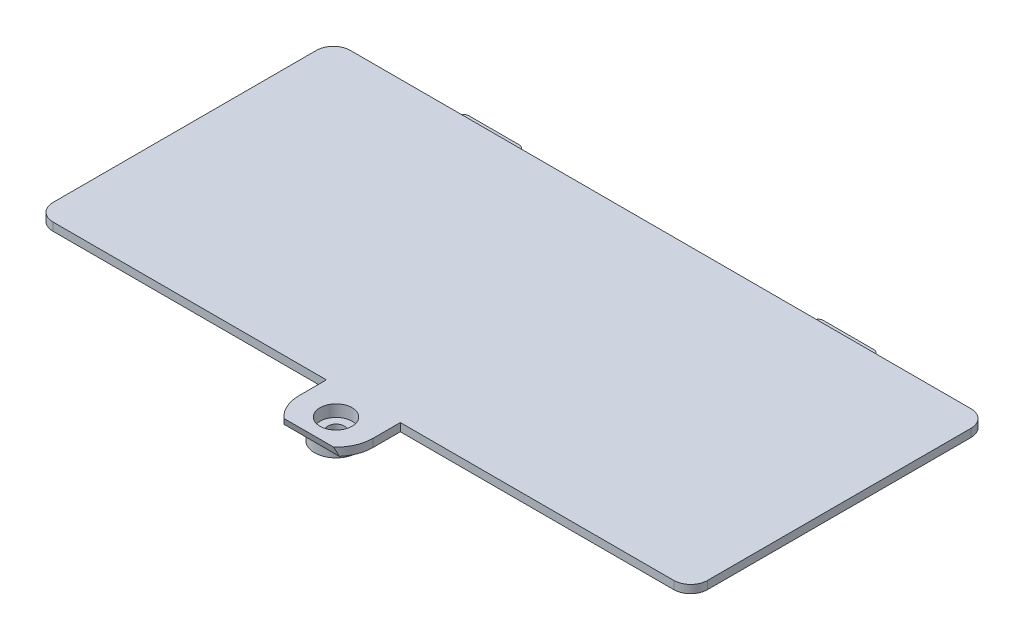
ISO-10303-21;
HEADER;
FILE_DESCRIPTION(('STEP AP214'),'2;1');
FILE_NAME('part.step','',(''),(''),'','','');
FILE_SCHEMA(('AUTOMOTIVE_DESIGN { 1 0 10303 214 1 1 1 1 }'));
ENDSEC;
DATA;
#1=APPLICATION_CONTEXT('core data for automotive mechanical design processes');
#2=APPLICATION_PROTOCOL_DEFINITION('international standard','automotive_design',2000,#1);
#3=PRODUCT_CONTEXT('',#1,'mechanical');
#4=PRODUCT('Part','Part','',(#3));
#5=PRODUCT_RELATED_PRODUCT_CATEGORY('part','',(#4));
#6=PRODUCT_DEFINITION_FORMATION('','',#4);
#7=PRODUCT_DEFINITION_CONTEXT('part definition',#1,'design');
#8=PRODUCT_DEFINITION('design','',#6,#7);
#9=PRODUCT_DEFINITION_SHAPE('','',#8);
#10=(LENGTH_UNIT() NAMED_UNIT(*) SI_UNIT(.MILLI.,.METRE.));
#11=(NAMED_UNIT(*) PLANE_ANGLE_UNIT() SI_UNIT($,.RADIAN.));
#12=(NAMED_UNIT(*) SI_UNIT($,.STERADIAN.) SOLID_ANGLE_UNIT());
#13=UNCERTAINTY_MEASURE_WITH_UNIT(LENGTH_MEASURE(1.E-05),#10,'distance_accuracy_value','');
#14=(GEOMETRIC_REPRESENTATION_CONTEXT(3) GLOBAL_UNCERTAINTY_ASSIGNED_CONTEXT((#13)) GLOBAL_UNIT_ASSIGNED_CONTEXT((#10,
#11,#12)) REPRESENTATION_CONTEXT('',''));
#15=CARTESIAN_POINT('',(0.,0.,0.));
#16=DIRECTION('',(0.,0.,1.));
#17=DIRECTION('',(1.,0.,0.));
#18=AXIS2_PLACEMENT_3D('',#15,#16,#17);
#19=CARTESIAN_POINT('',(0.,1.5,5.1));
#20=DIRECTION('',(0.,-1.,0.));
#21=DIRECTION('',(0.,0.,-1.));
#22=AXIS2_PLACEMENT_3D('',#19,#20,#21);
#23=CYLINDRICAL_SURFACE('',#22,6.9);
#24=CARTESIAN_POINT('',(0.,0.,5.1));
#25=DIRECTION('',(0.,1.,0.));
#26=DIRECTION('',(0.,0.,1.));
#27=AXIS2_PLACEMENT_3D('',#24,#25,#26);
#28=CIRCLE('',#27,6.9);
#29=CARTESIAN_POINT('',(-6.9,0.,5.1));
#30=VERTEX_POINT('',#29);
#31=CARTESIAN_POINT('',(-5.18369340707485,0.,9.65404464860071));
#32=VERTEX_POINT('',#31);
#33=EDGE_CURVE('E780',#30,#32,#28,.T.);
#34=ORIENTED_EDGE('',*,*,#33,.T.);
#35=CARTESIAN_POINT('',(0.,-12.5121348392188,5.1));
#36=DIRECTION('',(0.,0.342020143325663,-0.93969262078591));
#37=DIRECTION('',(0.,-0.93969262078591,-0.342020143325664));
#38=AXIS2_PLACEMENT_3D('',#35,#36,#37);
#39=ELLIPSE('',#38,20.1742503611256,6.9);
#40=CARTESIAN_POINT('',(-4.6475800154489,1.5,10.2));
#41=VERTEX_POINT('',#40);
#42=EDGE_CURVE('E11',#32,#41,#39,.T.);
#43=ORIENTED_EDGE('',*,*,#42,.T.);
#44=CARTESIAN_POINT('',(0.,1.5,5.1));
#45=DIRECTION('',(0.,1.,0.));
#46=DIRECTION('',(0.,0.,1.));
#47=AXIS2_PLACEMENT_3D('',#44,#45,#46);
#48=CIRCLE('',#47,6.9);
#49=CARTESIAN_POINT('',(-6.9,1.5,5.1));
#50=VERTEX_POINT('',#49);
#51=EDGE_CURVE('E997',#50,#41,#48,.T.);
#52=ORIENTED_EDGE('',*,*,#51,.F.);
#53=DIRECTION('',(0.,-1.,0.));
#54=VECTOR('',#53,1.);
#55=CARTESIAN_POINT('',(-6.9,1.5,5.1));
#56=LINE('',#55,#54);
#57=EDGE_CURVE('E786',#50,#30,#56,.T.);
#58=ORIENTED_EDGE('',*,*,#57,.T.);
#59=EDGE_LOOP('',(#34,#43,#52,#58));
#60=FACE_BOUND('',#59,.T.);
#61=ADVANCED_FACE('F32',(#60),#23,.T.);
#62=CARTESIAN_POINT('',(0.,1.5,5.1));
#63=DIRECTION('',(0.,-1.,0.));
#64=DIRECTION('',(0.,0.,-1.));
#65=AXIS2_PLACEMENT_3D('',#62,#63,#64);
#66=CYLINDRICAL_SURFACE('',#65,1.5);
#67=CARTESIAN_POINT('',(0.,-2.3,5.1));
#68=DIRECTION('',(0.,-1.,0.));
#69=DIRECTION('',(0.,0.,-1.));
#70=AXIS2_PLACEMENT_3D('',#67,#68,#69);
#71=CIRCLE('',#70,1.5);
#72=CARTESIAN_POINT('',(0.,-2.3,3.6));
#73=VERTEX_POINT('',#72);
#74=EDGE_CURVE('E969',#73,#73,#71,.T.);
#75=ORIENTED_EDGE('',*,*,#74,.T.);
#76=EDGE_LOOP('',(#75));
#77=FACE_BOUND('',#76,.T.);
#78=CARTESIAN_POINT('',(0.,-0.7,5.1));
#79=DIRECTION('',(0.,1.,0.));
#80=DIRECTION('',(0.,0.,1.));
#81=AXIS2_PLACEMENT_3D('',#78,#79,#80);
#82=CIRCLE('',#81,1.5);
#83=CARTESIAN_POINT('',(0.,-0.7,6.6));
#84=VERTEX_POINT('',#83);
#85=EDGE_CURVE('E966',#84,#84,#82,.T.);
#86=ORIENTED_EDGE('',*,*,#85,.T.);
#87=EDGE_LOOP('',(#86));
#88=FACE_BOUND('',#87,.T.);
#89=ADVANCED_FACE('F1774',(#77,#88),#66,.F.);
#90=CARTESIAN_POINT('',(57.95,0.,-52.35));
#91=DIRECTION('',(0.,1.,0.));
#92=DIRECTION('',(0.,0.,1.));
#93=AXIS2_PLACEMENT_3D('',#90,#91,#92);
#94=PLANE('',#93);
#95=CARTESIAN_POINT('',(5.18369340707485,0.,9.65404464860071));
#96=VERTEX_POINT('',#95);
#97=CARTESIAN_POINT('',(6.9,0.,5.1));
#98=VERTEX_POINT('',#97);
#99=EDGE_CURVE('E782',#96,#98,#28,.T.);
#100=ORIENTED_EDGE('',*,*,#99,.F.);
#101=DIRECTION('',(1.,0.,0.));
#102=VECTOR('',#101,1.);
#103=CARTESIAN_POINT('',(-6.,0.,9.65404464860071));
#104=LINE('',#103,#102);
#105=EDGE_CURVE('E47',#32,#96,#104,.T.);
#106=ORIENTED_EDGE('',*,*,#105,.F.);
#107=ORIENTED_EDGE('',*,*,#33,.F.);
#108=DIRECTION('',(0.,0.,1.));
#109=VECTOR('',#108,1.);
#110=CARTESIAN_POINT('',(-6.9,0.,5.1));
#111=LINE('',#110,#109);
#112=CARTESIAN_POINT('',(-6.9,0.,0.));
#113=VERTEX_POINT('',#112);
#114=EDGE_CURVE('E791',#113,#30,#111,.T.);
#115=ORIENTED_EDGE('',*,*,#114,.F.);
#116=DIRECTION('',(1.,0.,0.));
#117=VECTOR('',#116,1.);
#118=CARTESIAN_POINT('',(-6.9,0.,0.));
#119=LINE('',#118,#117);
#120=CARTESIAN_POINT('',(-57.95,0.,0.));
#121=VERTEX_POINT('',#120);
#122=EDGE_CURVE('E1688',#121,#113,#119,.T.);
#123=ORIENTED_EDGE('',*,*,#122,.F.);
#124=CARTESIAN_POINT('',(-57.95,0.,-3.15));
#125=DIRECTION('',(0.,1.,0.));
#126=DIRECTION('',(0.,0.,-1.));
#127=AXIS2_PLACEMENT_3D('',#124,#125,#126);
#128=CIRCLE('',#127,3.15000000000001);
#129=CARTESIAN_POINT('',(-61.1,0.,-3.15));
#130=VERTEX_POINT('',#129);
#131=EDGE_CURVE('E1687',#130,#121,#128,.T.);
#132=ORIENTED_EDGE('',*,*,#131,.F.);
#133=DIRECTION('',(0.,0.,1.));
#134=VECTOR('',#133,1.);
#135=CARTESIAN_POINT('',(-61.1,0.,-3.15));
#136=LINE('',#135,#134);
#137=CARTESIAN_POINT('',(-61.1,0.,-52.35));
#138=VERTEX_POINT('',#137);
#139=EDGE_CURVE('E1685',#138,#130,#136,.T.);
#140=ORIENTED_EDGE('',*,*,#139,.F.);
#141=CARTESIAN_POINT('',(-57.95,0.,-52.35));
#142=DIRECTION('',(0.,1.,0.));
#143=DIRECTION('',(0.,0.,-1.));
#144=AXIS2_PLACEMENT_3D('',#141,#142,#143);
#145=CIRCLE('',#144,3.14999999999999);
#146=CARTESIAN_POINT('',(-57.95,0.,-55.5));
#147=VERTEX_POINT('',#146);
#148=EDGE_CURVE('E1680',#147,#138,#145,.T.);
#149=ORIENTED_EDGE('',*,*,#148,.F.);
#150=DIRECTION('',(-1.,0.,0.));
#151=VECTOR('',#150,1.);
#152=CARTESIAN_POINT('',(57.95,0.,-55.5));
#153=LINE('',#152,#151);
#154=CARTESIAN_POINT('',(-38.8,0.,-55.5));
#155=VERTEX_POINT('',#154);
#156=EDGE_CURVE('E1676',#155,#147,#153,.T.);
#157=ORIENTED_EDGE('',*,*,#156,.F.);
#158=DIRECTION('',(0.,0.,-1.));
#159=VECTOR('',#158,1.);
#160=CARTESIAN_POINT('',(-38.8,0.,-51.5));
#161=LINE('',#160,#159);
#162=CARTESIAN_POINT('',(-38.8,0.,-51.5));
#163=VERTEX_POINT('',#162);
#164=EDGE_CURVE('E1068',#163,#155,#161,.T.);
#165=ORIENTED_EDGE('',*,*,#164,.F.);
#166=DIRECTION('',(-1.,0.,0.));
#167=VECTOR('',#166,1.);
#168=CARTESIAN_POINT('',(-38.8,0.,-51.5));
#169=LINE('',#168,#167);
#170=CARTESIAN_POINT('',(-27.4,0.,-51.5));
#171=VERTEX_POINT('',#170);
#172=EDGE_CURVE('E1059',#171,#163,#169,.T.);
#173=ORIENTED_EDGE('',*,*,#172,.F.);
#174=DIRECTION('',(0.,0.,1.));
#175=VECTOR('',#174,1.);
#176=CARTESIAN_POINT('',(-27.4,0.,-51.5));
#177=LINE('',#176,#175);
#178=CARTESIAN_POINT('',(-27.4,0.,-55.5));
#179=VERTEX_POINT('',#178);
#180=EDGE_CURVE('E1076',#179,#171,#177,.T.);
#181=ORIENTED_EDGE('',*,*,#180,.F.);
#182=CARTESIAN_POINT('',(27.4,0.,-55.5));
#183=VERTEX_POINT('',#182);
#184=EDGE_CURVE('E1682',#183,#179,#153,.T.);
#185=ORIENTED_EDGE('',*,*,#184,.F.);
#186=DIRECTION('',(0.,0.,-1.));
#187=VECTOR('',#186,1.);
#188=CARTESIAN_POINT('',(27.4,0.,-51.5));
#189=LINE('',#188,#187);
#190=CARTESIAN_POINT('',(27.4,0.,-51.5));
#191=VERTEX_POINT('',#190);
#192=EDGE_CURVE('E1015',#191,#183,#189,.T.);
#193=ORIENTED_EDGE('',*,*,#192,.F.);
#194=DIRECTION('',(-1.,0.,0.));
#195=VECTOR('',#194,1.);
#196=CARTESIAN_POINT('',(38.8,0.,-51.5));
#197=LINE('',#196,#195);
#198=CARTESIAN_POINT('',(38.8,0.,-51.5));
#199=VERTEX_POINT('',#198);
#200=EDGE_CURVE('E1035',#199,#191,#197,.T.);
#201=ORIENTED_EDGE('',*,*,#200,.F.);
#202=DIRECTION('',(0.,0.,1.));
#203=VECTOR('',#202,1.);
#204=CARTESIAN_POINT('',(38.8,0.,-51.5));
#205=LINE('',#204,#203);
#206=CARTESIAN_POINT('',(38.8,0.,-55.5));
#207=VERTEX_POINT('',#206);
#208=EDGE_CURVE('E1031',#207,#199,#205,.T.);
#209=ORIENTED_EDGE('',*,*,#208,.F.);
#210=CARTESIAN_POINT('',(57.95,0.,-55.5));
#211=VERTEX_POINT('',#210);
#212=EDGE_CURVE('E1677',#211,#207,#153,.T.);
#213=ORIENTED_EDGE('',*,*,#212,.F.);
#214=CARTESIAN_POINT('',(57.95,0.,-52.35));
#215=DIRECTION('',(0.,1.,0.));
#216=DIRECTION('',(0.,0.,1.));
#217=AXIS2_PLACEMENT_3D('',#214,#215,#216);
#218=CIRCLE('',#217,3.14999999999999);
#219=CARTESIAN_POINT('',(61.1,0.,-52.35));
#220=VERTEX_POINT('',#219);
#221=EDGE_CURVE('E1651',#220,#211,#218,.T.);
#222=ORIENTED_EDGE('',*,*,#221,.F.);
#223=DIRECTION('',(0.,0.,-1.));
#224=VECTOR('',#223,1.);
#225=CARTESIAN_POINT('',(61.1,0.,-3.15));
#226=LINE('',#225,#224);
#227=CARTESIAN_POINT('',(61.1,0.,-3.15));
#228=VERTEX_POINT('',#227);
#229=EDGE_CURVE('E798',#228,#220,#226,.T.);
#230=ORIENTED_EDGE('',*,*,#229,.F.);
#231=CARTESIAN_POINT('',(57.95,0.,-3.15));
#232=DIRECTION('',(0.,1.,0.));
#233=DIRECTION('',(0.,0.,1.));
#234=AXIS2_PLACEMENT_3D('',#231,#232,#233);
#235=CIRCLE('',#234,3.15000000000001);
#236=CARTESIAN_POINT('',(57.95,0.,0.));
#237=VERTEX_POINT('',#236);
#238=EDGE_CURVE('E796',#237,#228,#235,.T.);
#239=ORIENTED_EDGE('',*,*,#238,.F.);
#240=DIRECTION('',(1.,0.,0.));
#241=VECTOR('',#240,1.);
#242=CARTESIAN_POINT('',(6.9,0.,0.));
#243=LINE('',#242,#241);
#244=CARTESIAN_POINT('',(6.9,0.,0.));
#245=VERTEX_POINT('',#244);
#246=EDGE_CURVE('E789',#245,#237,#243,.T.);
#247=ORIENTED_EDGE('',*,*,#246,.F.);
#248=DIRECTION('',(0.,0.,-1.));
#249=VECTOR('',#248,1.);
#250=CARTESIAN_POINT('',(6.9,0.,5.1));
#251=LINE('',#250,#249);
#252=EDGE_CURVE('E787',#98,#245,#251,.T.);
#253=ORIENTED_EDGE('',*,*,#252,.F.);
#254=EDGE_LOOP('',(#100,#106,#107,#115,#123,#132,#140,#149,#157,#165,#173,#181,#185,#193,#201,
#209,#213,#222,#230,#239,#247,#253));
#255=FACE_BOUND('',#254,.T.);
#256=DIRECTION('',(0.,0.,-1.));
#257=VECTOR('',#256,1.);
#258=CARTESIAN_POINT('',(-48.,0.,-2.00000000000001));
#259=LINE('',#258,#257);
#260=CARTESIAN_POINT('',(-48.,0.,-2.00000000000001));
#261=VERTEX_POINT('',#260);
#262=CARTESIAN_POINT('',(-48.,0.,-9.85000000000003));
#263=VERTEX_POINT('',#262);
#264=EDGE_CURVE('E1277',#261,#263,#259,.T.);
#265=ORIENTED_EDGE('',*,*,#264,.F.);
#266=DIRECTION('',(-1.,0.,0.));
#267=VECTOR('',#266,1.);
#268=CARTESIAN_POINT('',(-48.,0.,-2.00000000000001));
#269=LINE('',#268,#267);
#270=CARTESIAN_POINT('',(-46.5,0.,-2.00000000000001));
#271=VERTEX_POINT('',#270);
#272=EDGE_CURVE('E1281',#271,#261,#269,.T.);
#273=ORIENTED_EDGE('',*,*,#272,.F.);
#274=DIRECTION('',(0.,0.,1.));
#275=VECTOR('',#274,1.);
#276=CARTESIAN_POINT('',(-46.5,0.,-2.00000000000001));
#277=LINE('',#276,#275);
#278=CARTESIAN_POINT('',(-46.5,0.,-9.85000000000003));
#279=VERTEX_POINT('',#278);
#280=EDGE_CURVE('E1519',#279,#271,#277,.T.);
#281=ORIENTED_EDGE('',*,*,#280,.F.);
#282=DIRECTION('',(-1.,0.,0.));
#283=VECTOR('',#282,1.);
#284=CARTESIAN_POINT('',(-46.5,0.,-9.85000000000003));
#285=LINE('',#284,#283);
#286=CARTESIAN_POINT('',(-16.5,0.,-9.85000000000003));
#287=VERTEX_POINT('',#286);
#288=EDGE_CURVE('E1516',#287,#279,#285,.T.);
#289=ORIENTED_EDGE('',*,*,#288,.F.);
#290=DIRECTION('',(0.,0.,-1.));
#291=VECTOR('',#290,1.);
#292=CARTESIAN_POINT('',(-16.5,0.,-2.));
#293=LINE('',#292,#291);
#294=CARTESIAN_POINT('',(-16.5,0.,-2.));
#295=VERTEX_POINT('',#294);
#296=EDGE_CURVE('E1513',#295,#287,#293,.T.);
#297=ORIENTED_EDGE('',*,*,#296,.F.);
#298=DIRECTION('',(-1.,0.,0.));
#299=VECTOR('',#298,1.);
#300=CARTESIAN_POINT('',(-16.5,0.,-2.));
#301=LINE('',#300,#299);
#302=CARTESIAN_POINT('',(-15.,0.,-2.));
#303=VERTEX_POINT('',#302);
#304=EDGE_CURVE('E1510',#303,#295,#301,.T.);
#305=ORIENTED_EDGE('',*,*,#304,.F.);
#306=DIRECTION('',(0.,0.,1.));
#307=VECTOR('',#306,1.);
#308=CARTESIAN_POINT('',(-15.,0.,-2.));
#309=LINE('',#308,#307);
#310=CARTESIAN_POINT('',(-15.,0.,-9.85000000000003));
#311=VERTEX_POINT('',#310);
#312=EDGE_CURVE('E1507',#311,#303,#309,.T.);
#313=ORIENTED_EDGE('',*,*,#312,.F.);
#314=DIRECTION('',(-1.,0.,0.));
#315=VECTOR('',#314,1.);
#316=CARTESIAN_POINT('',(-15.,0.,-9.85000000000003));
#317=LINE('',#316,#315);
#318=CARTESIAN_POINT('',(15.,0.,-9.85000000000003));
#319=VERTEX_POINT('',#318);
#320=EDGE_CURVE('E1504',#319,#311,#317,.T.);
#321=ORIENTED_EDGE('',*,*,#320,.F.);
#322=DIRECTION('',(0.,0.,-1.));
#323=VECTOR('',#322,1.);
#324=CARTESIAN_POINT('',(15.,0.,-2.));
#325=LINE('',#324,#323);
#326=CARTESIAN_POINT('',(15.,0.,-2.));
#327=VERTEX_POINT('',#326);
#328=EDGE_CURVE('E1501',#327,#319,#325,.T.);
#329=ORIENTED_EDGE('',*,*,#328,.F.);
#330=DIRECTION('',(-1.,0.,0.));
#331=VECTOR('',#330,1.);
#332=CARTESIAN_POINT('',(16.5,0.,-2.));
#333=LINE('',#332,#331);
#334=CARTESIAN_POINT('',(16.5,0.,-2.));
#335=VERTEX_POINT('',#334);
#336=EDGE_CURVE('E1498',#335,#327,#333,.T.);
#337=ORIENTED_EDGE('',*,*,#336,.F.);
#338=DIRECTION('',(0.,0.,1.));
#339=VECTOR('',#338,1.);
#340=CARTESIAN_POINT('',(16.5,0.,-2.));
#341=LINE('',#340,#339);
#342=CARTESIAN_POINT('',(16.5,0.,-9.85000000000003));
#343=VERTEX_POINT('',#342);
#344=EDGE_CURVE('E1495',#343,#335,#341,.T.);
#345=ORIENTED_EDGE('',*,*,#344,.F.);
#346=DIRECTION('',(-1.,0.,0.));
#347=VECTOR('',#346,1.);
#348=CARTESIAN_POINT('',(16.5,0.,-9.85000000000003));
#349=LINE('',#348,#347);
#350=CARTESIAN_POINT('',(46.5,0.,-9.85000000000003));
#351=VERTEX_POINT('',#350);
#352=EDGE_CURVE('E1492',#351,#343,#349,.T.);
#353=ORIENTED_EDGE('',*,*,#352,.F.);
#354=DIRECTION('',(0.,0.,-1.));
#355=VECTOR('',#354,1.);
#356=CARTESIAN_POINT('',(46.5,0.,-2.00000000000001));
#357=LINE('',#356,#355);
#358=CARTESIAN_POINT('',(46.5,0.,-2.00000000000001));
#359=VERTEX_POINT('',#358);
#360=EDGE_CURVE('E1489',#359,#351,#357,.T.);
#361=ORIENTED_EDGE('',*,*,#360,.F.);
#362=DIRECTION('',(-1.,0.,0.));
#363=VECTOR('',#362,1.);
#364=CARTESIAN_POINT('',(48.,0.,-2.00000000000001));
#365=LINE('',#364,#363);
#366=CARTESIAN_POINT('',(48.,0.,-2.00000000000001));
#367=VERTEX_POINT('',#366);
#368=EDGE_CURVE('E1486',#367,#359,#365,.T.);
#369=ORIENTED_EDGE('',*,*,#368,.F.);
#370=DIRECTION('',(0.,0.,1.));
#371=VECTOR('',#370,1.);
#372=CARTESIAN_POINT('',(48.,0.,-2.00000000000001));
#373=LINE('',#372,#371);
#374=CARTESIAN_POINT('',(48.,0.,-9.85000000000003));
#375=VERTEX_POINT('',#374);
#376=EDGE_CURVE('E1483',#375,#367,#373,.T.);
#377=ORIENTED_EDGE('',*,*,#376,.F.);
#378=DIRECTION('',(-1.,0.,0.));
#379=VECTOR('',#378,1.);
#380=CARTESIAN_POINT('',(48.,0.,-9.85000000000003));
#381=LINE('',#380,#379);
#382=CARTESIAN_POINT('',(59.1,0.,-9.85000000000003));
#383=VERTEX_POINT('',#382);
#384=EDGE_CURVE('E1480',#383,#375,#381,.T.);
#385=ORIENTED_EDGE('',*,*,#384,.F.);
#386=DIRECTION('',(0.,0.,1.));
#387=VECTOR('',#386,1.);
#388=CARTESIAN_POINT('',(59.1,0.,-9.85000000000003));
#389=LINE('',#388,#387);
#390=CARTESIAN_POINT('',(59.1,0.,-11.35));
#391=VERTEX_POINT('',#390);
#392=EDGE_CURVE('E1477',#391,#383,#389,.T.);
#393=ORIENTED_EDGE('',*,*,#392,.F.);
#394=DIRECTION('',(1.,0.,0.));
#395=VECTOR('',#394,1.);
#396=CARTESIAN_POINT('',(48.,0.,-11.35));
#397=LINE('',#396,#395);
#398=CARTESIAN_POINT('',(48.,0.,-11.35));
#399=VERTEX_POINT('',#398);
#400=EDGE_CURVE('E1474',#399,#391,#397,.T.);
#401=ORIENTED_EDGE('',*,*,#400,.F.);
#402=DIRECTION('',(0.,0.,1.));
#403=VECTOR('',#402,1.);
#404=CARTESIAN_POINT('',(48.,0.,-11.35));
#405=LINE('',#404,#403);
#406=CARTESIAN_POINT('',(48.,0.,-26.35));
#407=VERTEX_POINT('',#406);
#408=EDGE_CURVE('E1471',#407,#399,#405,.T.);
#409=ORIENTED_EDGE('',*,*,#408,.F.);
#410=DIRECTION('',(-1.,0.,0.));
#411=VECTOR('',#410,1.);
#412=CARTESIAN_POINT('',(48.,0.,-26.35));
#413=LINE('',#412,#411);
#414=CARTESIAN_POINT('',(59.1,0.,-26.35));
#415=VERTEX_POINT('',#414);
#416=EDGE_CURVE('E1468',#415,#407,#413,.T.);
#417=ORIENTED_EDGE('',*,*,#416,.F.);
#418=DIRECTION('',(0.,0.,1.));
#419=VECTOR('',#418,1.);
#420=CARTESIAN_POINT('',(59.1,0.,-26.35));
#421=LINE('',#420,#419);
#422=CARTESIAN_POINT('',(59.1,0.,-27.85));
#423=VERTEX_POINT('',#422);
#424=EDGE_CURVE('E1465',#423,#415,#421,.T.);
#425=ORIENTED_EDGE('',*,*,#424,.F.);
#426=DIRECTION('',(1.,0.,0.));
#427=VECTOR('',#426,1.);
#428=CARTESIAN_POINT('',(48.,0.,-27.85));
#429=LINE('',#428,#427);
#430=CARTESIAN_POINT('',(48.,0.,-27.85));
#431=VERTEX_POINT('',#430);
#432=EDGE_CURVE('E1462',#431,#423,#429,.T.);
#433=ORIENTED_EDGE('',*,*,#432,.F.);
#434=DIRECTION('',(0.,0.,1.));
#435=VECTOR('',#434,1.);
#436=CARTESIAN_POINT('',(48.,0.,-27.85));
#437=LINE('',#436,#435);
#438=CARTESIAN_POINT('',(48.,0.,-42.85));
#439=VERTEX_POINT('',#438);
#440=EDGE_CURVE('E1459',#439,#431,#437,.T.);
#441=ORIENTED_EDGE('',*,*,#440,.F.);
#442=DIRECTION('',(-1.,0.,0.));
#443=VECTOR('',#442,1.);
#444=CARTESIAN_POINT('',(48.,0.,-42.85));
#445=LINE('',#444,#443);
#446=CARTESIAN_POINT('',(59.1,0.,-42.85));
#447=VERTEX_POINT('',#446);
#448=EDGE_CURVE('E1456',#447,#439,#445,.T.);
#449=ORIENTED_EDGE('',*,*,#448,.F.);
#450=DIRECTION('',(0.,0.,1.));
#451=VECTOR('',#450,1.);
#452=CARTESIAN_POINT('',(59.1,0.,-44.35));
#453=LINE('',#452,#451);
#454=CARTESIAN_POINT('',(59.1,0.,-44.35));
#455=VERTEX_POINT('',#454);
#456=EDGE_CURVE('E1453',#455,#447,#453,.T.);
#457=ORIENTED_EDGE('',*,*,#456,.F.);
#458=DIRECTION('',(1.,0.,0.));
#459=VECTOR('',#458,1.);
#460=CARTESIAN_POINT('',(48.,0.,-44.35));
#461=LINE('',#460,#459);
#462=CARTESIAN_POINT('',(48.,0.,-44.35));
#463=VERTEX_POINT('',#462);
#464=EDGE_CURVE('E1450',#463,#455,#461,.T.);
#465=ORIENTED_EDGE('',*,*,#464,.F.);
#466=DIRECTION('',(0.,0.,1.));
#467=VECTOR('',#466,1.);
#468=CARTESIAN_POINT('',(48.,0.,-44.35));
#469=LINE('',#468,#467);
#470=CARTESIAN_POINT('',(48.,0.,-52.2));
#471=VERTEX_POINT('',#470);
#472=EDGE_CURVE('E1447',#471,#463,#469,.T.);
#473=ORIENTED_EDGE('',*,*,#472,.F.);
#474=DIRECTION('',(1.,0.,0.));
#475=VECTOR('',#474,1.);
#476=CARTESIAN_POINT('',(48.,0.,-52.2));
#477=LINE('',#476,#475);
#478=CARTESIAN_POINT('',(46.5,0.,-52.2));
#479=VERTEX_POINT('',#478);
#480=EDGE_CURVE('E1444',#479,#471,#477,.T.);
#481=ORIENTED_EDGE('',*,*,#480,.F.);
#482=DIRECTION('',(0.,0.,-1.));
#483=VECTOR('',#482,1.);
#484=CARTESIAN_POINT('',(46.5,0.,-44.35));
#485=LINE('',#484,#483);
#486=CARTESIAN_POINT('',(46.5,0.,-44.35));
#487=VERTEX_POINT('',#486);
#488=EDGE_CURVE('E1441',#487,#479,#485,.T.);
#489=ORIENTED_EDGE('',*,*,#488,.F.);
#490=DIRECTION('',(1.,0.,0.));
#491=VECTOR('',#490,1.);
#492=CARTESIAN_POINT('',(16.5,0.,-44.35));
#493=LINE('',#492,#491);
#494=CARTESIAN_POINT('',(16.5,0.,-44.35));
#495=VERTEX_POINT('',#494);
#496=EDGE_CURVE('E1438',#495,#487,#493,.T.);
#497=ORIENTED_EDGE('',*,*,#496,.F.);
#498=DIRECTION('',(0.,0.,1.));
#499=VECTOR('',#498,1.);
#500=CARTESIAN_POINT('',(16.5,0.,-44.35));
#501=LINE('',#500,#499);
#502=CARTESIAN_POINT('',(16.5,0.,-52.2));
#503=VERTEX_POINT('',#502);
#504=EDGE_CURVE('E1435',#503,#495,#501,.T.);
#505=ORIENTED_EDGE('',*,*,#504,.F.);
#506=DIRECTION('',(1.,0.,0.));
#507=VECTOR('',#506,1.);
#508=CARTESIAN_POINT('',(16.5,0.,-52.2));
#509=LINE('',#508,#507);
#510=CARTESIAN_POINT('',(15.,0.,-52.2));
#511=VERTEX_POINT('',#510);
#512=EDGE_CURVE('E1432',#511,#503,#509,.T.);
#513=ORIENTED_EDGE('',*,*,#512,.F.);
#514=DIRECTION('',(0.,0.,-1.));
#515=VECTOR('',#514,1.);
#516=CARTESIAN_POINT('',(15.,0.,-44.35));
#517=LINE('',#516,#515);
#518=CARTESIAN_POINT('',(15.,0.,-44.35));
#519=VERTEX_POINT('',#518);
#520=EDGE_CURVE('E1429',#519,#511,#517,.T.);
#521=ORIENTED_EDGE('',*,*,#520,.F.);
#522=DIRECTION('',(1.,0.,0.));
#523=VECTOR('',#522,1.);
#524=CARTESIAN_POINT('',(-15.,0.,-44.35));
#525=LINE('',#524,#523);
#526=CARTESIAN_POINT('',(-15.,0.,-44.35));
#527=VERTEX_POINT('',#526);
#528=EDGE_CURVE('E1426',#527,#519,#525,.T.);
#529=ORIENTED_EDGE('',*,*,#528,.F.);
#530=DIRECTION('',(0.,0.,1.));
#531=VECTOR('',#530,1.);
#532=CARTESIAN_POINT('',(-15.,0.,-44.35));
#533=LINE('',#532,#531);
#534=CARTESIAN_POINT('',(-15.,0.,-52.2));
#535=VERTEX_POINT('',#534);
#536=EDGE_CURVE('E1423',#535,#527,#533,.T.);
#537=ORIENTED_EDGE('',*,*,#536,.F.);
#538=DIRECTION('',(1.,0.,0.));
#539=VECTOR('',#538,1.);
#540=CARTESIAN_POINT('',(-16.5,0.,-52.2));
#541=LINE('',#540,#539);
#542=CARTESIAN_POINT('',(-16.5,0.,-52.2));
#543=VERTEX_POINT('',#542);
#544=EDGE_CURVE('E1420',#543,#535,#541,.T.);
#545=ORIENTED_EDGE('',*,*,#544,.F.);
#546=DIRECTION('',(0.,0.,-1.));
#547=VECTOR('',#546,1.);
#548=CARTESIAN_POINT('',(-16.5,0.,-44.35));
#549=LINE('',#548,#547);
#550=CARTESIAN_POINT('',(-16.5,0.,-44.35));
#551=VERTEX_POINT('',#550);
#552=EDGE_CURVE('E1417',#551,#543,#549,.T.);
#553=ORIENTED_EDGE('',*,*,#552,.F.);
#554=DIRECTION('',(1.,0.,0.));
#555=VECTOR('',#554,1.);
#556=CARTESIAN_POINT('',(-46.5,0.,-44.35));
#557=LINE('',#556,#555);
#558=CARTESIAN_POINT('',(-46.5,0.,-44.35));
#559=VERTEX_POINT('',#558);
#560=EDGE_CURVE('E1414',#559,#551,#557,.T.);
#561=ORIENTED_EDGE('',*,*,#560,.F.);
#562=DIRECTION('',(0.,0.,1.));
#563=VECTOR('',#562,1.);
#564=CARTESIAN_POINT('',(-46.5,0.,-44.35));
#565=LINE('',#564,#563);
#566=CARTESIAN_POINT('',(-46.5,0.,-52.2));
#567=VERTEX_POINT('',#566);
#568=EDGE_CURVE('E1411',#567,#559,#565,.T.);
#569=ORIENTED_EDGE('',*,*,#568,.F.);
#570=DIRECTION('',(1.,0.,0.));
#571=VECTOR('',#570,1.);
#572=CARTESIAN_POINT('',(-48.,0.,-52.2));
#573=LINE('',#572,#571);
#574=CARTESIAN_POINT('',(-48.,0.,-52.2));
#575=VERTEX_POINT('',#574);
#576=EDGE_CURVE('E1408',#575,#567,#573,.T.);
#577=ORIENTED_EDGE('',*,*,#576,.F.);
#578=DIRECTION('',(0.,0.,-1.));
#579=VECTOR('',#578,1.);
#580=CARTESIAN_POINT('',(-48.,0.,-44.35));
#581=LINE('',#580,#579);
#582=CARTESIAN_POINT('',(-48.,0.,-44.35));
#583=VERTEX_POINT('',#582);
#584=EDGE_CURVE('E1405',#583,#575,#581,.T.);
#585=ORIENTED_EDGE('',*,*,#584,.F.);
#586=DIRECTION('',(1.,0.,0.));
#587=VECTOR('',#586,1.);
#588=CARTESIAN_POINT('',(-59.1,0.,-44.35));
#589=LINE('',#588,#587);
#590=CARTESIAN_POINT('',(-59.1,0.,-44.35));
#591=VERTEX_POINT('',#590);
#592=EDGE_CURVE('E1402',#591,#583,#589,.T.);
#593=ORIENTED_EDGE('',*,*,#592,.F.);
#594=DIRECTION('',(0.,0.,-1.));
#595=VECTOR('',#594,1.);
#596=CARTESIAN_POINT('',(-59.1,0.,-44.35));
#597=LINE('',#596,#595);
#598=CARTESIAN_POINT('',(-59.1,0.,-42.85));
#599=VERTEX_POINT('',#598);
#600=EDGE_CURVE('E1399',#599,#591,#597,.T.);
#601=ORIENTED_EDGE('',*,*,#600,.F.);
#602=DIRECTION('',(-1.,0.,0.));
#603=VECTOR('',#602,1.);
#604=CARTESIAN_POINT('',(-59.1,0.,-42.85));
#605=LINE('',#604,#603);
#606=CARTESIAN_POINT('',(-48.,0.,-42.85));
#607=VERTEX_POINT('',#606);
#608=EDGE_CURVE('E1396',#607,#599,#605,.T.);
#609=ORIENTED_EDGE('',*,*,#608,.F.);
#610=DIRECTION('',(0.,0.,-1.));
#611=VECTOR('',#610,1.);
#612=CARTESIAN_POINT('',(-48.,0.,-27.85));
#613=LINE('',#612,#611);
#614=CARTESIAN_POINT('',(-48.,0.,-27.85));
#615=VERTEX_POINT('',#614);
#616=EDGE_CURVE('E1393',#615,#607,#613,.T.);
#617=ORIENTED_EDGE('',*,*,#616,.F.);
#618=DIRECTION('',(1.,0.,0.));
#619=VECTOR('',#618,1.);
#620=CARTESIAN_POINT('',(-59.1,0.,-27.85));
#621=LINE('',#620,#619);
#622=CARTESIAN_POINT('',(-59.1,0.,-27.85));
#623=VERTEX_POINT('',#622);
#624=EDGE_CURVE('E1390',#623,#615,#621,.T.);
#625=ORIENTED_EDGE('',*,*,#624,.F.);
#626=DIRECTION('',(0.,0.,-1.));
#627=VECTOR('',#626,1.);
#628=CARTESIAN_POINT('',(-59.1,0.,-26.35));
#629=LINE('',#628,#627);
#630=CARTESIAN_POINT('',(-59.1,0.,-26.35));
#631=VERTEX_POINT('',#630);
#632=EDGE_CURVE('E1387',#631,#623,#629,.T.);
#633=ORIENTED_EDGE('',*,*,#632,.F.);
#634=DIRECTION('',(-1.,0.,0.));
#635=VECTOR('',#634,1.);
#636=CARTESIAN_POINT('',(-59.1,0.,-26.35));
#637=LINE('',#636,#635);
#638=CARTESIAN_POINT('',(-48.,0.,-26.35));
#639=VERTEX_POINT('',#638);
#640=EDGE_CURVE('E1384',#639,#631,#637,.T.);
#641=ORIENTED_EDGE('',*,*,#640,.F.);
#642=DIRECTION('',(0.,0.,-1.));
#643=VECTOR('',#642,1.);
#644=CARTESIAN_POINT('',(-48.,0.,-11.35));
#645=LINE('',#644,#643);
#646=CARTESIAN_POINT('',(-48.,0.,-11.35));
#647=VERTEX_POINT('',#646);
#648=EDGE_CURVE('E1381',#647,#639,#645,.T.);
#649=ORIENTED_EDGE('',*,*,#648,.F.);
#650=DIRECTION('',(1.,0.,0.));
#651=VECTOR('',#650,1.);
#652=CARTESIAN_POINT('',(-59.1,0.,-11.35));
#653=LINE('',#652,#651);
#654=CARTESIAN_POINT('',(-59.1,0.,-11.35));
#655=VERTEX_POINT('',#654);
#656=EDGE_CURVE('E1378',#655,#647,#653,.T.);
#657=ORIENTED_EDGE('',*,*,#656,.F.);
#658=DIRECTION('',(0.,0.,-1.));
#659=VECTOR('',#658,1.);
#660=CARTESIAN_POINT('',(-59.1,0.,-9.85000000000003));
#661=LINE('',#660,#659);
#662=CARTESIAN_POINT('',(-59.1,0.,-9.85000000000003));
#663=VERTEX_POINT('',#662);
#664=EDGE_CURVE('E1375',#663,#655,#661,.T.);
#665=ORIENTED_EDGE('',*,*,#664,.F.);
#666=DIRECTION('',(-1.,0.,0.));
#667=VECTOR('',#666,1.);
#668=CARTESIAN_POINT('',(-59.1,0.,-9.85000000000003));
#669=LINE('',#668,#667);
#670=EDGE_CURVE('E1372',#263,#663,#669,.T.);
#671=ORIENTED_EDGE('',*,*,#670,.F.);
#672=EDGE_LOOP('',(#265,#273,#281,#289,#297,#305,#313,#321,#329,#337,#345,#353,#361,#369,#377,
#385,#393,#401,#409,#417,#425,#433,#441,#449,#457,#465,#473,#481,#489,#497,#505,#513,#521,#529,
#537,#545,#553,#561,#569,#577,#585,#593,#601,#609,#617,#625,#633,#641,#649,#657,#665,#671));
#673=FACE_BOUND('',#672,.T.);
#674=CARTESIAN_POINT('',(0.,0.,5.1));
#675=DIRECTION('',(0.,1.,0.));
#676=DIRECTION('',(0.,0.,1.));
#677=AXIS2_PLACEMENT_3D('',#674,#675,#676);
#678=CIRCLE('',#677,4.);
#679=CARTESIAN_POINT('',(0.,0.,9.1));
#680=VERTEX_POINT('',#679);
#681=EDGE_CURVE('E962',#680,#680,#678,.F.);
#682=ORIENTED_EDGE('',*,*,#681,.F.);
#683=EDGE_LOOP('',(#682));
#684=FACE_BOUND('',#683,.T.);
#685=ADVANCED_FACE('F777',(#255,#673,#684),#94,.F.);
#686=CARTESIAN_POINT('',(57.95,1.5,-52.35));
#687=DIRECTION('',(0.,1.,0.));
#688=DIRECTION('',(0.,0.,1.));
#689=AXIS2_PLACEMENT_3D('',#686,#687,#688);
#690=PLANE('',#689);
#691=DIRECTION('',(1.,0.,0.));
#692=VECTOR('',#691,1.);
#693=CARTESIAN_POINT('',(-6.,1.5,10.2));
#694=LINE('',#693,#692);
#695=CARTESIAN_POINT('',(4.6475800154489,1.5,10.2));
#696=VERTEX_POINT('',#695);
#697=EDGE_CURVE('E769',#41,#696,#694,.T.);
#698=ORIENTED_EDGE('',*,*,#697,.T.);
#699=CARTESIAN_POINT('',(6.9,1.5,5.1));
#700=VERTEX_POINT('',#699);
#701=EDGE_CURVE('E993',#696,#700,#48,.T.);
#702=ORIENTED_EDGE('',*,*,#701,.T.);
#703=DIRECTION('',(0.,0.,-1.));
#704=VECTOR('',#703,1.);
#705=CARTESIAN_POINT('',(6.9,1.5,5.1));
#706=LINE('',#705,#704);
#707=CARTESIAN_POINT('',(6.9,1.5,0.));
#708=VERTEX_POINT('',#707);
#709=EDGE_CURVE('E1667',#700,#708,#706,.T.);
#710=ORIENTED_EDGE('',*,*,#709,.T.);
#711=DIRECTION('',(1.,0.,0.));
#712=VECTOR('',#711,1.);
#713=CARTESIAN_POINT('',(6.9,1.5,0.));
#714=LINE('',#713,#712);
#715=CARTESIAN_POINT('',(57.95,1.5,0.));
#716=VERTEX_POINT('',#715);
#717=EDGE_CURVE('E1669',#708,#716,#714,.T.);
#718=ORIENTED_EDGE('',*,*,#717,.T.);
#719=CARTESIAN_POINT('',(57.95,1.5,-3.15));
#720=DIRECTION('',(0.,1.,0.));
#721=DIRECTION('',(0.,0.,1.));
#722=AXIS2_PLACEMENT_3D('',#719,#720,#721);
#723=CIRCLE('',#722,3.15000000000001);
#724=CARTESIAN_POINT('',(61.1,1.5,-3.15));
#725=VERTEX_POINT('',#724);
#726=EDGE_CURVE('E1671',#716,#725,#723,.T.);
#727=ORIENTED_EDGE('',*,*,#726,.T.);
#728=DIRECTION('',(0.,0.,-1.));
#729=VECTOR('',#728,1.);
#730=CARTESIAN_POINT('',(61.1,1.5,-3.15));
#731=LINE('',#730,#729);
#732=CARTESIAN_POINT('',(61.1,1.5,-52.35));
#733=VERTEX_POINT('',#732);
#734=EDGE_CURVE('E805',#725,#733,#731,.T.);
#735=ORIENTED_EDGE('',*,*,#734,.T.);
#736=CARTESIAN_POINT('',(57.95,1.5,-52.35));
#737=DIRECTION('',(0.,1.,0.));
#738=DIRECTION('',(0.,0.,1.));
#739=AXIS2_PLACEMENT_3D('',#736,#737,#738);
#740=CIRCLE('',#739,3.14999999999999);
#741=CARTESIAN_POINT('',(57.95,1.5,-55.5));
#742=VERTEX_POINT('',#741);
#743=EDGE_CURVE('E800',#733,#742,#740,.T.);
#744=ORIENTED_EDGE('',*,*,#743,.T.);
#745=DIRECTION('',(-1.,0.,0.));
#746=VECTOR('',#745,1.);
#747=CARTESIAN_POINT('',(57.95,1.5,-55.5));
#748=LINE('',#747,#746);
#749=CARTESIAN_POINT('',(-57.95,1.5,-55.5));
#750=VERTEX_POINT('',#749);
#751=EDGE_CURVE('E1654',#742,#750,#748,.T.);
#752=ORIENTED_EDGE('',*,*,#751,.T.);
#753=CARTESIAN_POINT('',(-57.95,1.5,-52.35));
#754=DIRECTION('',(0.,1.,0.));
#755=DIRECTION('',(0.,0.,-1.));
#756=AXIS2_PLACEMENT_3D('',#753,#754,#755);
#757=CIRCLE('',#756,3.14999999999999);
#758=CARTESIAN_POINT('',(-61.1,1.5,-52.35));
#759=VERTEX_POINT('',#758);
#760=EDGE_CURVE('E1656',#750,#759,#757,.T.);
#761=ORIENTED_EDGE('',*,*,#760,.T.);
#762=DIRECTION('',(0.,0.,1.));
#763=VECTOR('',#762,1.);
#764=CARTESIAN_POINT('',(-61.1,1.5,-3.15));
#765=LINE('',#764,#763);
#766=CARTESIAN_POINT('',(-61.1,1.5,-3.15));
#767=VERTEX_POINT('',#766);
#768=EDGE_CURVE('E1658',#759,#767,#765,.T.);
#769=ORIENTED_EDGE('',*,*,#768,.T.);
#770=CARTESIAN_POINT('',(-57.95,1.5,-3.15));
#771=DIRECTION('',(0.,1.,0.));
#772=DIRECTION('',(0.,0.,-1.));
#773=AXIS2_PLACEMENT_3D('',#770,#771,#772);
#774=CIRCLE('',#773,3.15000000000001);
#775=CARTESIAN_POINT('',(-57.95,1.5,0.));
#776=VERTEX_POINT('',#775);
#777=EDGE_CURVE('E1660',#767,#776,#774,.T.);
#778=ORIENTED_EDGE('',*,*,#777,.T.);
#779=DIRECTION('',(1.,0.,0.));
#780=VECTOR('',#779,1.);
#781=CARTESIAN_POINT('',(-6.9,1.5,0.));
#782=LINE('',#781,#780);
#783=CARTESIAN_POINT('',(-6.9,1.5,0.));
#784=VERTEX_POINT('',#783);
#785=EDGE_CURVE('E1662',#776,#784,#782,.T.);
#786=ORIENTED_EDGE('',*,*,#785,.T.);
#787=DIRECTION('',(0.,0.,1.));
#788=VECTOR('',#787,1.);
#789=CARTESIAN_POINT('',(-6.9,1.5,5.1));
#790=LINE('',#789,#788);
#791=EDGE_CURVE('E1664',#784,#50,#790,.T.);
#792=ORIENTED_EDGE('',*,*,#791,.T.);
#793=ORIENTED_EDGE('',*,*,#51,.T.);
#794=EDGE_LOOP('',(#698,#702,#710,#718,#727,#735,#744,#752,#761,#769,#778,#786,#792,#793));
#795=FACE_BOUND('',#794,.T.);
#796=CARTESIAN_POINT('',(0.,1.5,5.1));
#797=DIRECTION('',(0.,1.,0.));
#798=DIRECTION('',(0.,0.,1.));
#799=AXIS2_PLACEMENT_3D('',#796,#797,#798);
#800=CIRCLE('',#799,3.);
#801=CARTESIAN_POINT('',(0.,1.5,8.1));
#802=VERTEX_POINT('',#801);
#803=EDGE_CURVE('E998',#802,#802,#800,.T.);
#804=ORIENTED_EDGE('',*,*,#803,.F.);
#805=EDGE_LOOP('',(#804));
#806=FACE_BOUND('',#805,.T.);
#807=ADVANCED_FACE('F995',(#795,#806),#690,.T.);
#808=CARTESIAN_POINT('',(57.95,1.5,-52.35));
#809=DIRECTION('',(0.,-1.,0.));
#810=DIRECTION('',(0.,0.,-1.));
#811=AXIS2_PLACEMENT_3D('',#808,#809,#810);
#812=CYLINDRICAL_SURFACE('',#811,3.14999999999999);
#813=ORIENTED_EDGE('',*,*,#221,.T.);
#814=DIRECTION('',(0.,-1.,0.));
#815=VECTOR('',#814,1.);
#816=CARTESIAN_POINT('',(57.95,1.5,-55.5));
#817=LINE('',#816,#815);
#818=EDGE_CURVE('E833',#742,#211,#817,.T.);
#819=ORIENTED_EDGE('',*,*,#818,.F.);
#820=ORIENTED_EDGE('',*,*,#743,.F.);
#821=DIRECTION('',(0.,-1.,0.));
#822=VECTOR('',#821,1.);
#823=CARTESIAN_POINT('',(61.1,1.5,-52.35));
#824=LINE('',#823,#822);
#825=EDGE_CURVE('E801',#733,#220,#824,.T.);
#826=ORIENTED_EDGE('',*,*,#825,.T.);
#827=EDGE_LOOP('',(#813,#819,#820,#826));
#828=FACE_BOUND('',#827,.T.);
#829=ADVANCED_FACE('F1804',(#828),#812,.T.);
#830=CARTESIAN_POINT('',(57.95,1.5,-55.5));
#831=DIRECTION('',(0.,0.,1.));
#832=DIRECTION('',(1.,0.,0.));
#833=AXIS2_PLACEMENT_3D('',#830,#831,#832);
#834=PLANE('',#833);
#835=ORIENTED_EDGE('',*,*,#212,.T.);
#836=EDGE_CURVE('E1681',#207,#183,#153,.T.);
#837=ORIENTED_EDGE('',*,*,#836,.T.);
#838=ORIENTED_EDGE('',*,*,#184,.T.);
#839=EDGE_CURVE('E1683',#179,#155,#153,.T.);
#840=ORIENTED_EDGE('',*,*,#839,.T.);
#841=ORIENTED_EDGE('',*,*,#156,.T.);
#842=DIRECTION('',(0.,-1.,0.));
#843=VECTOR('',#842,1.);
#844=CARTESIAN_POINT('',(-57.95,1.5,-55.5));
#845=LINE('',#844,#843);
#846=EDGE_CURVE('E830',#750,#147,#845,.T.);
#847=ORIENTED_EDGE('',*,*,#846,.F.);
#848=ORIENTED_EDGE('',*,*,#751,.F.);
#849=ORIENTED_EDGE('',*,*,#818,.T.);
#850=EDGE_LOOP('',(#835,#837,#838,#840,#841,#847,#848,#849));
#851=FACE_BOUND('',#850,.T.);
#852=ADVANCED_FACE('F1719',(#851),#834,.F.);
#853=CARTESIAN_POINT('',(-57.95,1.5,-52.35));
#854=DIRECTION('',(0.,-1.,0.));
#855=DIRECTION('',(0.,0.,-1.));
#856=AXIS2_PLACEMENT_3D('',#853,#854,#855);
#857=CYLINDRICAL_SURFACE('',#856,3.14999999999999);
#858=ORIENTED_EDGE('',*,*,#148,.T.);
#859=DIRECTION('',(0.,-1.,0.));
#860=VECTOR('',#859,1.);
#861=CARTESIAN_POINT('',(-61.1,1.5,-52.35));
#862=LINE('',#861,#860);
#863=EDGE_CURVE('E827',#759,#138,#862,.T.);
#864=ORIENTED_EDGE('',*,*,#863,.F.);
#865=ORIENTED_EDGE('',*,*,#760,.F.);
#866=ORIENTED_EDGE('',*,*,#846,.T.);
#867=EDGE_LOOP('',(#858,#864,#865,#866));
#868=FACE_BOUND('',#867,.T.);
#869=ADVANCED_FACE('F1711',(#868),#857,.T.);
#870=CARTESIAN_POINT('',(-61.1,1.5,-3.15));
#871=DIRECTION('',(1.,0.,0.));
#872=DIRECTION('',(0.,0.,-1.));
#873=AXIS2_PLACEMENT_3D('',#870,#871,#872);
#874=PLANE('',#873);
#875=ORIENTED_EDGE('',*,*,#139,.T.);
#876=DIRECTION('',(0.,-1.,0.));
#877=VECTOR('',#876,1.);
#878=CARTESIAN_POINT('',(-61.1,1.5,-3.15));
#879=LINE('',#878,#877);
#880=EDGE_CURVE('E824',#767,#130,#879,.T.);
#881=ORIENTED_EDGE('',*,*,#880,.F.);
#882=ORIENTED_EDGE('',*,*,#768,.F.);
#883=ORIENTED_EDGE('',*,*,#863,.T.);
#884=EDGE_LOOP('',(#875,#881,#882,#883));
#885=FACE_BOUND('',#884,.T.);
#886=ADVANCED_FACE('F1709',(#885),#874,.F.);
#887=CARTESIAN_POINT('',(-57.95,1.5,-3.15));
#888=DIRECTION('',(0.,-1.,0.));
#889=DIRECTION('',(0.,0.,-1.));
#890=AXIS2_PLACEMENT_3D('',#887,#888,#889);
#891=CYLINDRICAL_SURFACE('',#890,3.15000000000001);
#892=ORIENTED_EDGE('',*,*,#131,.T.);
#893=DIRECTION('',(0.,-1.,0.));
#894=VECTOR('',#893,1.);
#895=CARTESIAN_POINT('',(-57.95,1.5,0.));
#896=LINE('',#895,#894);
#897=EDGE_CURVE('E821',#776,#121,#896,.T.);
#898=ORIENTED_EDGE('',*,*,#897,.F.);
#899=ORIENTED_EDGE('',*,*,#777,.F.);
#900=ORIENTED_EDGE('',*,*,#880,.T.);
#901=EDGE_LOOP('',(#892,#898,#899,#900));
#902=FACE_BOUND('',#901,.T.);
#903=ADVANCED_FACE('F1700',(#902),#891,.T.);
#904=CARTESIAN_POINT('',(-6.9,1.5,0.));
#905=DIRECTION('',(0.,0.,-1.));
#906=DIRECTION('',(-1.,0.,0.));
#907=AXIS2_PLACEMENT_3D('',#904,#905,#906);
#908=PLANE('',#907);
#909=ORIENTED_EDGE('',*,*,#122,.T.);
#910=DIRECTION('',(0.,-1.,0.));
#911=VECTOR('',#910,1.);
#912=CARTESIAN_POINT('',(-6.9,1.5,0.));
#913=LINE('',#912,#911);
#914=EDGE_CURVE('E818',#784,#113,#913,.T.);
#915=ORIENTED_EDGE('',*,*,#914,.F.);
#916=ORIENTED_EDGE('',*,*,#785,.F.);
#917=ORIENTED_EDGE('',*,*,#897,.T.);
#918=EDGE_LOOP('',(#909,#915,#916,#917));
#919=FACE_BOUND('',#918,.T.);
#920=ADVANCED_FACE('F1704',(#919),#908,.F.);
#921=CARTESIAN_POINT('',(-6.9,1.5,5.1));
#922=DIRECTION('',(1.,0.,0.));
#923=DIRECTION('',(0.,0.,-1.));
#924=AXIS2_PLACEMENT_3D('',#921,#922,#923);
#925=PLANE('',#924);
#926=ORIENTED_EDGE('',*,*,#114,.T.);
#927=ORIENTED_EDGE('',*,*,#57,.F.);
#928=ORIENTED_EDGE('',*,*,#791,.F.);
#929=ORIENTED_EDGE('',*,*,#914,.T.);
#930=EDGE_LOOP('',(#926,#927,#928,#929));
#931=FACE_BOUND('',#930,.T.);
#932=ADVANCED_FACE('F1693',(#931),#925,.F.);
#933=ORIENTED_EDGE('',*,*,#701,.F.);
#934=EDGE_CURVE('E36',#696,#96,#39,.T.);
#935=ORIENTED_EDGE('',*,*,#934,.T.);
#936=ORIENTED_EDGE('',*,*,#99,.T.);
#937=DIRECTION('',(0.,-1.,0.));
#938=VECTOR('',#937,1.);
#939=CARTESIAN_POINT('',(6.9,1.5,5.1));
#940=LINE('',#939,#938);
#941=EDGE_CURVE('E814',#700,#98,#940,.T.);
#942=ORIENTED_EDGE('',*,*,#941,.F.);
#943=EDGE_LOOP('',(#933,#935,#936,#942));
#944=FACE_BOUND('',#943,.T.);
#945=ADVANCED_FACE('F991',(#944),#23,.T.);
#946=CARTESIAN_POINT('',(6.9,1.5,5.1));
#947=DIRECTION('',(-1.,0.,0.));
#948=DIRECTION('',(0.,0.,1.));
#949=AXIS2_PLACEMENT_3D('',#946,#947,#948);
#950=PLANE('',#949);
#951=ORIENTED_EDGE('',*,*,#252,.T.);
#952=DIRECTION('',(0.,-1.,0.));
#953=VECTOR('',#952,1.);
#954=CARTESIAN_POINT('',(6.9,1.5,0.));
#955=LINE('',#954,#953);
#956=EDGE_CURVE('E811',#708,#245,#955,.T.);
#957=ORIENTED_EDGE('',*,*,#956,.F.);
#958=ORIENTED_EDGE('',*,*,#709,.F.);
#959=ORIENTED_EDGE('',*,*,#941,.T.);
#960=EDGE_LOOP('',(#951,#957,#958,#959));
#961=FACE_BOUND('',#960,.T.);
#962=ADVANCED_FACE('F1784',(#961),#950,.F.);
#963=CARTESIAN_POINT('',(6.9,1.5,0.));
#964=DIRECTION('',(0.,0.,-1.));
#965=DIRECTION('',(-1.,0.,0.));
#966=AXIS2_PLACEMENT_3D('',#963,#964,#965);
#967=PLANE('',#966);
#968=ORIENTED_EDGE('',*,*,#246,.T.);
#969=DIRECTION('',(0.,-1.,0.));
#970=VECTOR('',#969,1.);
#971=CARTESIAN_POINT('',(57.95,1.5,0.));
#972=LINE('',#971,#970);
#973=EDGE_CURVE('E808',#716,#237,#972,.T.);
#974=ORIENTED_EDGE('',*,*,#973,.F.);
#975=ORIENTED_EDGE('',*,*,#717,.F.);
#976=ORIENTED_EDGE('',*,*,#956,.T.);
#977=EDGE_LOOP('',(#968,#974,#975,#976));
#978=FACE_BOUND('',#977,.T.);
#979=ADVANCED_FACE('F1789',(#978),#967,.F.);
#980=CARTESIAN_POINT('',(57.95,1.5,-3.15));
#981=DIRECTION('',(0.,-1.,0.));
#982=DIRECTION('',(0.,0.,-1.));
#983=AXIS2_PLACEMENT_3D('',#980,#981,#982);
#984=CYLINDRICAL_SURFACE('',#983,3.15000000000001);
#985=ORIENTED_EDGE('',*,*,#238,.T.);
#986=DIRECTION('',(0.,-1.,0.));
#987=VECTOR('',#986,1.);
#988=CARTESIAN_POINT('',(61.1,1.5,-3.15));
#989=LINE('',#988,#987);
#990=EDGE_CURVE('E804',#725,#228,#989,.T.);
#991=ORIENTED_EDGE('',*,*,#990,.F.);
#992=ORIENTED_EDGE('',*,*,#726,.F.);
#993=ORIENTED_EDGE('',*,*,#973,.T.);
#994=EDGE_LOOP('',(#985,#991,#992,#993));
#995=FACE_BOUND('',#994,.T.);
#996=ADVANCED_FACE('F2062',(#995),#984,.T.);
#997=CARTESIAN_POINT('',(61.1,1.5,-3.15));
#998=DIRECTION('',(-1.,0.,0.));
#999=DIRECTION('',(0.,0.,1.));
#1000=AXIS2_PLACEMENT_3D('',#997,#998,#999);
#1001=PLANE('',#1000);
#1002=ORIENTED_EDGE('',*,*,#229,.T.);
#1003=ORIENTED_EDGE('',*,*,#825,.F.);
#1004=ORIENTED_EDGE('',*,*,#734,.F.);
#1005=ORIENTED_EDGE('',*,*,#990,.T.);
#1006=EDGE_LOOP('',(#1002,#1003,#1004,#1005));
#1007=FACE_BOUND('',#1006,.T.);
#1008=ADVANCED_FACE('F2071',(#1007),#1001,.F.);
#1009=CARTESIAN_POINT('',(-48.,-1.5,-9.85000000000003));
#1010=DIRECTION('',(0.,-1.,0.));
#1011=DIRECTION('',(0.,0.,-1.));
#1012=AXIS2_PLACEMENT_3D('',#1009,#1010,#1011);
#1013=PLANE('',#1012);
#1014=DIRECTION('',(1.,0.,0.));
#1015=VECTOR('',#1014,1.);
#1016=CARTESIAN_POINT('',(16.5,-1.5,-42.85));
#1017=LINE('',#1016,#1015);
#1018=CARTESIAN_POINT('',(16.5,-1.5,-42.85));
#1019=VERTEX_POINT('',#1018);
#1020=CARTESIAN_POINT('',(46.5,-1.5,-42.85));
#1021=VERTEX_POINT('',#1020);
#1022=EDGE_CURVE('E1130',#1019,#1021,#1017,.T.);
#1023=ORIENTED_EDGE('',*,*,#1022,.F.);
#1024=DIRECTION('',(0.,0.,-1.));
#1025=VECTOR('',#1024,1.);
#1026=CARTESIAN_POINT('',(16.5,-1.5,-27.85));
#1027=LINE('',#1026,#1025);
#1028=CARTESIAN_POINT('',(16.5,-1.5,-27.85));
#1029=VERTEX_POINT('',#1028);
#1030=EDGE_CURVE('E1128',#1029,#1019,#1027,.T.);
#1031=ORIENTED_EDGE('',*,*,#1030,.F.);
#1032=DIRECTION('',(-1.,0.,0.));
#1033=VECTOR('',#1032,1.);
#1034=CARTESIAN_POINT('',(16.5,-1.5,-27.85));
#1035=LINE('',#1034,#1033);
#1036=CARTESIAN_POINT('',(46.5,-1.5,-27.85));
#1037=VERTEX_POINT('',#1036);
#1038=EDGE_CURVE('E1136',#1037,#1029,#1035,.T.);
#1039=ORIENTED_EDGE('',*,*,#1038,.F.);
#1040=DIRECTION('',(0.,0.,1.));
#1041=VECTOR('',#1040,1.);
#1042=CARTESIAN_POINT('',(46.5,-1.5,-27.85));
#1043=LINE('',#1042,#1041);
#1044=EDGE_CURVE('E1133',#1021,#1037,#1043,.T.);
#1045=ORIENTED_EDGE('',*,*,#1044,.F.);
#1046=EDGE_LOOP('',(#1023,#1031,#1039,#1045));
#1047=FACE_BOUND('',#1046,.T.);
#1048=DIRECTION('',(1.,0.,0.));
#1049=VECTOR('',#1048,1.);
#1050=CARTESIAN_POINT('',(-15.,-1.5,-26.35));
#1051=LINE('',#1050,#1049);
#1052=CARTESIAN_POINT('',(-15.,-1.5,-26.35));
#1053=VERTEX_POINT('',#1052);
#1054=CARTESIAN_POINT('',(15.,-1.5,-26.35));
#1055=VERTEX_POINT('',#1054);
#1056=EDGE_CURVE('E1190',#1053,#1055,#1051,.T.);
#1057=ORIENTED_EDGE('',*,*,#1056,.F.);
#1058=DIRECTION('',(0.,0.,-1.));
#1059=VECTOR('',#1058,1.);
#1060=CARTESIAN_POINT('',(-15.,-1.5,-11.35));
#1061=LINE('',#1060,#1059);
#1062=CARTESIAN_POINT('',(-15.,-1.5,-11.35));
#1063=VERTEX_POINT('',#1062);
#1064=EDGE_CURVE('E1188',#1063,#1053,#1061,.T.);
#1065=ORIENTED_EDGE('',*,*,#1064,.F.);
#1066=DIRECTION('',(-1.,0.,0.));
#1067=VECTOR('',#1066,1.);
#1068=CARTESIAN_POINT('',(-15.,-1.5,-11.35));
#1069=LINE('',#1068,#1067);
#1070=CARTESIAN_POINT('',(15.,-1.5,-11.35));
#1071=VERTEX_POINT('',#1070);
#1072=EDGE_CURVE('E1196',#1071,#1063,#1069,.T.);
#1073=ORIENTED_EDGE('',*,*,#1072,.F.);
#1074=DIRECTION('',(0.,0.,1.));
#1075=VECTOR('',#1074,1.);
#1076=CARTESIAN_POINT('',(15.,-1.5,-11.35));
#1077=LINE('',#1076,#1075);
#1078=EDGE_CURVE('E1193',#1055,#1071,#1077,.T.);
#1079=ORIENTED_EDGE('',*,*,#1078,.F.);
#1080=EDGE_LOOP('',(#1057,#1065,#1073,#1079));
#1081=FACE_BOUND('',#1080,.T.);
#1082=DIRECTION('',(1.,0.,0.));
#1083=VECTOR('',#1082,1.);
#1084=CARTESIAN_POINT('',(-46.5,-1.5,-42.85));
#1085=LINE('',#1084,#1083);
#1086=CARTESIAN_POINT('',(-46.5,-1.5,-42.85));
#1087=VERTEX_POINT('',#1086);
#1088=CARTESIAN_POINT('',(-16.5,-1.5,-42.85));
#1089=VERTEX_POINT('',#1088);
#1090=EDGE_CURVE('E1250',#1087,#1089,#1085,.T.);
#1091=ORIENTED_EDGE('',*,*,#1090,.F.);
#1092=DIRECTION('',(0.,0.,-1.));
#1093=VECTOR('',#1092,1.);
#1094=CARTESIAN_POINT('',(-46.5,-1.5,-27.85));
#1095=LINE('',#1094,#1093);
#1096=CARTESIAN_POINT('',(-46.5,-1.5,-27.85));
#1097=VERTEX_POINT('',#1096);
#1098=EDGE_CURVE('E1248',#1097,#1087,#1095,.T.);
#1099=ORIENTED_EDGE('',*,*,#1098,.F.);
#1100=DIRECTION('',(-1.,0.,0.));
#1101=VECTOR('',#1100,1.);
#1102=CARTESIAN_POINT('',(-46.5,-1.5,-27.85));
#1103=LINE('',#1102,#1101);
#1104=CARTESIAN_POINT('',(-16.5,-1.5,-27.85));
#1105=VERTEX_POINT('',#1104);
#1106=EDGE_CURVE('E1256',#1105,#1097,#1103,.T.);
#1107=ORIENTED_EDGE('',*,*,#1106,.F.);
#1108=DIRECTION('',(0.,0.,1.));
#1109=VECTOR('',#1108,1.);
#1110=CARTESIAN_POINT('',(-16.5,-1.5,-27.85));
#1111=LINE('',#1110,#1109);
#1112=EDGE_CURVE('E1253',#1089,#1105,#1111,.T.);
#1113=ORIENTED_EDGE('',*,*,#1112,.F.);
#1114=EDGE_LOOP('',(#1091,#1099,#1107,#1113));
#1115=FACE_BOUND('',#1114,.T.);
#1116=DIRECTION('',(0.,0.,-1.));
#1117=VECTOR('',#1116,1.);
#1118=CARTESIAN_POINT('',(46.5,-1.5,-44.35));
#1119=LINE('',#1118,#1117);
#1120=CARTESIAN_POINT('',(46.5,-1.5,-44.35));
#1121=VERTEX_POINT('',#1120);
#1122=CARTESIAN_POINT('',(46.5,-1.5,-51.2));
#1123=VERTEX_POINT('',#1122);
#1124=EDGE_CURVE('E1321',#1121,#1123,#1119,.T.);
#1125=ORIENTED_EDGE('',*,*,#1124,.T.);
#1126=DIRECTION('',(1.,0.,0.));
#1127=VECTOR('',#1126,1.);
#1128=CARTESIAN_POINT('',(48.,-1.5,-51.2));
#1129=LINE('',#1128,#1127);
#1130=CARTESIAN_POINT('',(48.,-1.5,-51.2));
#1131=VERTEX_POINT('',#1130);
#1132=EDGE_CURVE('E875',#1123,#1131,#1129,.T.);
#1133=ORIENTED_EDGE('',*,*,#1132,.T.);
#1134=DIRECTION('',(0.,0.,1.));
#1135=VECTOR('',#1134,1.);
#1136=CARTESIAN_POINT('',(48.,-1.5,-44.35));
#1137=LINE('',#1136,#1135);
#1138=CARTESIAN_POINT('',(48.,-1.5,-44.35));
#1139=VERTEX_POINT('',#1138);
#1140=EDGE_CURVE('E1324',#1131,#1139,#1137,.T.);
#1141=ORIENTED_EDGE('',*,*,#1140,.T.);
#1142=DIRECTION('',(1.,0.,0.));
#1143=VECTOR('',#1142,1.);
#1144=CARTESIAN_POINT('',(48.,-1.5,-44.35));
#1145=LINE('',#1144,#1143);
#1146=CARTESIAN_POINT('',(58.1,-1.5,-44.35));
#1147=VERTEX_POINT('',#1146);
#1148=EDGE_CURVE('E1326',#1139,#1147,#1145,.T.);
#1149=ORIENTED_EDGE('',*,*,#1148,.T.);
#1150=DIRECTION('',(0.,0.,1.));
#1151=VECTOR('',#1150,1.);
#1152=CARTESIAN_POINT('',(58.1,-1.5,-42.85));
#1153=LINE('',#1152,#1151);
#1154=CARTESIAN_POINT('',(58.1,-1.5,-42.85));
#1155=VERTEX_POINT('',#1154);
#1156=EDGE_CURVE('E872',#1147,#1155,#1153,.T.);
#1157=ORIENTED_EDGE('',*,*,#1156,.T.);
#1158=DIRECTION('',(-1.,0.,0.));
#1159=VECTOR('',#1158,1.);
#1160=CARTESIAN_POINT('',(48.,-1.5,-42.85));
#1161=LINE('',#1160,#1159);
#1162=CARTESIAN_POINT('',(48.,-1.5,-42.85));
#1163=VERTEX_POINT('',#1162);
#1164=EDGE_CURVE('E1329',#1155,#1163,#1161,.T.);
#1165=ORIENTED_EDGE('',*,*,#1164,.T.);
#1166=DIRECTION('',(0.,0.,1.));
#1167=VECTOR('',#1166,1.);
#1168=CARTESIAN_POINT('',(48.,-1.5,-27.85));
#1169=LINE('',#1168,#1167);
#1170=CARTESIAN_POINT('',(48.,-1.5,-27.85));
#1171=VERTEX_POINT('',#1170);
#1172=EDGE_CURVE('E1331',#1163,#1171,#1169,.T.);
#1173=ORIENTED_EDGE('',*,*,#1172,.T.);
#1174=DIRECTION('',(1.,0.,0.));
#1175=VECTOR('',#1174,1.);
#1176=CARTESIAN_POINT('',(48.,-1.5,-27.85));
#1177=LINE('',#1176,#1175);
#1178=CARTESIAN_POINT('',(58.1,-1.5,-27.85));
#1179=VERTEX_POINT('',#1178);
#1180=EDGE_CURVE('E1333',#1171,#1179,#1177,.T.);
#1181=ORIENTED_EDGE('',*,*,#1180,.T.);
#1182=DIRECTION('',(0.,0.,1.));
#1183=VECTOR('',#1182,1.);
#1184=CARTESIAN_POINT('',(58.1,-1.5,-26.35));
#1185=LINE('',#1184,#1183);
#1186=CARTESIAN_POINT('',(58.1,-1.5,-26.35));
#1187=VERTEX_POINT('',#1186);
#1188=EDGE_CURVE('E869',#1179,#1187,#1185,.T.);
#1189=ORIENTED_EDGE('',*,*,#1188,.T.);
#1190=DIRECTION('',(-1.,0.,0.));
#1191=VECTOR('',#1190,1.);
#1192=CARTESIAN_POINT('',(48.,-1.5,-26.35));
#1193=LINE('',#1192,#1191);
#1194=CARTESIAN_POINT('',(48.,-1.5,-26.35));
#1195=VERTEX_POINT('',#1194);
#1196=EDGE_CURVE('E1336',#1187,#1195,#1193,.T.);
#1197=ORIENTED_EDGE('',*,*,#1196,.T.);
#1198=DIRECTION('',(0.,0.,1.));
#1199=VECTOR('',#1198,1.);
#1200=CARTESIAN_POINT('',(48.,-1.5,-11.35));
#1201=LINE('',#1200,#1199);
#1202=CARTESIAN_POINT('',(48.,-1.5,-11.35));
#1203=VERTEX_POINT('',#1202);
#1204=EDGE_CURVE('E1338',#1195,#1203,#1201,.T.);
#1205=ORIENTED_EDGE('',*,*,#1204,.T.);
#1206=DIRECTION('',(1.,0.,0.));
#1207=VECTOR('',#1206,1.);
#1208=CARTESIAN_POINT('',(48.,-1.5,-11.35));
#1209=LINE('',#1208,#1207);
#1210=CARTESIAN_POINT('',(58.1,-1.5,-11.35));
#1211=VERTEX_POINT('',#1210);
#1212=EDGE_CURVE('E1340',#1203,#1211,#1209,.T.);
#1213=ORIENTED_EDGE('',*,*,#1212,.T.);
#1214=DIRECTION('',(0.,0.,1.));
#1215=VECTOR('',#1214,1.);
#1216=CARTESIAN_POINT('',(58.1,-1.5,-9.85000000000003));
#1217=LINE('',#1216,#1215);
#1218=CARTESIAN_POINT('',(58.1,-1.5,-9.85000000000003));
#1219=VERTEX_POINT('',#1218);
#1220=EDGE_CURVE('E866',#1211,#1219,#1217,.T.);
#1221=ORIENTED_EDGE('',*,*,#1220,.T.);
#1222=DIRECTION('',(-1.,0.,0.));
#1223=VECTOR('',#1222,1.);
#1224=CARTESIAN_POINT('',(48.,-1.5,-9.85000000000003));
#1225=LINE('',#1224,#1223);
#1226=CARTESIAN_POINT('',(48.,-1.5,-9.85000000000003));
#1227=VERTEX_POINT('',#1226);
#1228=EDGE_CURVE('E1343',#1219,#1227,#1225,.T.);
#1229=ORIENTED_EDGE('',*,*,#1228,.T.);
#1230=DIRECTION('',(0.,0.,1.));
#1231=VECTOR('',#1230,1.);
#1232=CARTESIAN_POINT('',(48.,-1.5,-2.00000000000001));
#1233=LINE('',#1232,#1231);
#1234=CARTESIAN_POINT('',(48.,-1.5,-3.00000000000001));
#1235=VERTEX_POINT('',#1234);
#1236=EDGE_CURVE('E1345',#1227,#1235,#1233,.T.);
#1237=ORIENTED_EDGE('',*,*,#1236,.T.);
#1238=DIRECTION('',(-1.,0.,0.));
#1239=VECTOR('',#1238,1.);
#1240=CARTESIAN_POINT('',(46.5,-1.5,-3.00000000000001));
#1241=LINE('',#1240,#1239);
#1242=CARTESIAN_POINT('',(46.5,-1.5,-3.00000000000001));
#1243=VERTEX_POINT('',#1242);
#1244=EDGE_CURVE('E863',#1235,#1243,#1241,.T.);
#1245=ORIENTED_EDGE('',*,*,#1244,.T.);
#1246=DIRECTION('',(0.,0.,-1.));
#1247=VECTOR('',#1246,1.);
#1248=CARTESIAN_POINT('',(46.5,-1.5,-2.00000000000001));
#1249=LINE('',#1248,#1247);
#1250=CARTESIAN_POINT('',(46.5,-1.5,-9.85000000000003));
#1251=VERTEX_POINT('',#1250);
#1252=EDGE_CURVE('E1348',#1243,#1251,#1249,.T.);
#1253=ORIENTED_EDGE('',*,*,#1252,.T.);
#1254=DIRECTION('',(-1.,0.,0.));
#1255=VECTOR('',#1254,1.);
#1256=CARTESIAN_POINT('',(16.5,-1.5,-9.85000000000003));
#1257=LINE('',#1256,#1255);
#1258=CARTESIAN_POINT('',(16.5,-1.5,-9.85000000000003));
#1259=VERTEX_POINT('',#1258);
#1260=EDGE_CURVE('E1350',#1251,#1259,#1257,.T.);
#1261=ORIENTED_EDGE('',*,*,#1260,.T.);
#1262=DIRECTION('',(0.,0.,1.));
#1263=VECTOR('',#1262,1.);
#1264=CARTESIAN_POINT('',(16.5,-1.5,-2.));
#1265=LINE('',#1264,#1263);
#1266=CARTESIAN_POINT('',(16.5,-1.5,-3.));
#1267=VERTEX_POINT('',#1266);
#1268=EDGE_CURVE('E1352',#1259,#1267,#1265,.T.);
#1269=ORIENTED_EDGE('',*,*,#1268,.T.);
#1270=DIRECTION('',(-1.,0.,0.));
#1271=VECTOR('',#1270,1.);
#1272=CARTESIAN_POINT('',(15.,-1.5,-3.));
#1273=LINE('',#1272,#1271);
#1274=CARTESIAN_POINT('',(15.,-1.5,-3.));
#1275=VERTEX_POINT('',#1274);
#1276=EDGE_CURVE('E860',#1267,#1275,#1273,.T.);
#1277=ORIENTED_EDGE('',*,*,#1276,.T.);
#1278=DIRECTION('',(0.,0.,-1.));
#1279=VECTOR('',#1278,1.);
#1280=CARTESIAN_POINT('',(15.,-1.5,-2.));
#1281=LINE('',#1280,#1279);
#1282=CARTESIAN_POINT('',(15.,-1.5,-9.85000000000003));
#1283=VERTEX_POINT('',#1282);
#1284=EDGE_CURVE('E1355',#1275,#1283,#1281,.T.);
#1285=ORIENTED_EDGE('',*,*,#1284,.T.);
#1286=DIRECTION('',(-1.,0.,0.));
#1287=VECTOR('',#1286,1.);
#1288=CARTESIAN_POINT('',(-15.,-1.5,-9.85000000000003));
#1289=LINE('',#1288,#1287);
#1290=CARTESIAN_POINT('',(-15.,-1.5,-9.85000000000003));
#1291=VERTEX_POINT('',#1290);
#1292=EDGE_CURVE('E1357',#1283,#1291,#1289,.T.);
#1293=ORIENTED_EDGE('',*,*,#1292,.T.);
#1294=DIRECTION('',(0.,0.,1.));
#1295=VECTOR('',#1294,1.);
#1296=CARTESIAN_POINT('',(-15.,-1.5,-2.));
#1297=LINE('',#1296,#1295);
#1298=CARTESIAN_POINT('',(-15.,-1.5,-3.));
#1299=VERTEX_POINT('',#1298);
#1300=EDGE_CURVE('E1359',#1291,#1299,#1297,.T.);
#1301=ORIENTED_EDGE('',*,*,#1300,.T.);
#1302=DIRECTION('',(-1.,0.,0.));
#1303=VECTOR('',#1302,1.);
#1304=CARTESIAN_POINT('',(-16.5,-1.5,-3.));
#1305=LINE('',#1304,#1303);
#1306=CARTESIAN_POINT('',(-16.5,-1.5,-3.));
#1307=VERTEX_POINT('',#1306);
#1308=EDGE_CURVE('E854',#1299,#1307,#1305,.T.);
#1309=ORIENTED_EDGE('',*,*,#1308,.T.);
#1310=DIRECTION('',(0.,0.,-1.));
#1311=VECTOR('',#1310,1.);
#1312=CARTESIAN_POINT('',(-16.5,-1.5,-2.));
#1313=LINE('',#1312,#1311);
#1314=CARTESIAN_POINT('',(-16.5,-1.5,-9.85000000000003));
#1315=VERTEX_POINT('',#1314);
#1316=EDGE_CURVE('E1362',#1307,#1315,#1313,.T.);
#1317=ORIENTED_EDGE('',*,*,#1316,.T.);
#1318=DIRECTION('',(-1.,0.,0.));
#1319=VECTOR('',#1318,1.);
#1320=CARTESIAN_POINT('',(-46.5,-1.5,-9.85000000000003));
#1321=LINE('',#1320,#1319);
#1322=CARTESIAN_POINT('',(-46.5,-1.5,-9.85000000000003));
#1323=VERTEX_POINT('',#1322);
#1324=EDGE_CURVE('E1364',#1315,#1323,#1321,.T.);
#1325=ORIENTED_EDGE('',*,*,#1324,.T.);
#1326=DIRECTION('',(0.,0.,1.));
#1327=VECTOR('',#1326,1.);
#1328=CARTESIAN_POINT('',(-46.5,-1.5,-2.00000000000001));
#1329=LINE('',#1328,#1327);
#1330=CARTESIAN_POINT('',(-46.5,-1.5,-3.00000000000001));
#1331=VERTEX_POINT('',#1330);
#1332=EDGE_CURVE('E1366',#1323,#1331,#1329,.T.);
#1333=ORIENTED_EDGE('',*,*,#1332,.T.);
#1334=DIRECTION('',(-1.,0.,0.));
#1335=VECTOR('',#1334,1.);
#1336=CARTESIAN_POINT('',(-48.,-1.5,-3.00000000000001));
#1337=LINE('',#1336,#1335);
#1338=CARTESIAN_POINT('',(-48.,-1.5,-3.00000000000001));
#1339=VERTEX_POINT('',#1338);
#1340=EDGE_CURVE('E851',#1331,#1339,#1337,.T.);
#1341=ORIENTED_EDGE('',*,*,#1340,.T.);
#1342=DIRECTION('',(0.,0.,-1.));
#1343=VECTOR('',#1342,1.);
#1344=CARTESIAN_POINT('',(-48.,-1.5,-2.00000000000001));
#1345=LINE('',#1344,#1343);
#1346=CARTESIAN_POINT('',(-48.,-1.5,-9.85000000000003));
#1347=VERTEX_POINT('',#1346);
#1348=EDGE_CURVE('E1278',#1339,#1347,#1345,.T.);
#1349=ORIENTED_EDGE('',*,*,#1348,.T.);
#1350=DIRECTION('',(-1.,0.,0.));
#1351=VECTOR('',#1350,1.);
#1352=CARTESIAN_POINT('',(-59.1,-1.5,-9.85000000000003));
#1353=LINE('',#1352,#1351);
#1354=CARTESIAN_POINT('',(-58.1,-1.5,-9.85000000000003));
#1355=VERTEX_POINT('',#1354);
#1356=EDGE_CURVE('E1280',#1347,#1355,#1353,.T.);
#1357=ORIENTED_EDGE('',*,*,#1356,.T.);
#1358=DIRECTION('',(0.,0.,-1.));
#1359=VECTOR('',#1358,1.);
#1360=CARTESIAN_POINT('',(-58.1,-1.5,-11.35));
#1361=LINE('',#1360,#1359);
#1362=CARTESIAN_POINT('',(-58.1,-1.5,-11.35));
#1363=VERTEX_POINT('',#1362);
#1364=EDGE_CURVE('E848',#1355,#1363,#1361,.T.);
#1365=ORIENTED_EDGE('',*,*,#1364,.T.);
#1366=DIRECTION('',(1.,0.,0.));
#1367=VECTOR('',#1366,1.);
#1368=CARTESIAN_POINT('',(-59.1,-1.5,-11.35));
#1369=LINE('',#1368,#1367);
#1370=CARTESIAN_POINT('',(-48.,-1.5,-11.35));
#1371=VERTEX_POINT('',#1370);
#1372=EDGE_CURVE('E1284',#1363,#1371,#1369,.T.);
#1373=ORIENTED_EDGE('',*,*,#1372,.T.);
#1374=DIRECTION('',(0.,0.,-1.));
#1375=VECTOR('',#1374,1.);
#1376=CARTESIAN_POINT('',(-48.,-1.5,-11.35));
#1377=LINE('',#1376,#1375);
#1378=CARTESIAN_POINT('',(-48.,-1.5,-26.35));
#1379=VERTEX_POINT('',#1378);
#1380=EDGE_CURVE('E1286',#1371,#1379,#1377,.T.);
#1381=ORIENTED_EDGE('',*,*,#1380,.T.);
#1382=DIRECTION('',(-1.,0.,0.));
#1383=VECTOR('',#1382,1.);
#1384=CARTESIAN_POINT('',(-59.1,-1.5,-26.35));
#1385=LINE('',#1384,#1383);
#1386=CARTESIAN_POINT('',(-58.1,-1.5,-26.35));
#1387=VERTEX_POINT('',#1386);
#1388=EDGE_CURVE('E1288',#1379,#1387,#1385,.T.);
#1389=ORIENTED_EDGE('',*,*,#1388,.T.);
#1390=DIRECTION('',(0.,0.,-1.));
#1391=VECTOR('',#1390,1.);
#1392=CARTESIAN_POINT('',(-58.1,-1.5,-27.85));
#1393=LINE('',#1392,#1391);
#1394=CARTESIAN_POINT('',(-58.1,-1.5,-27.85));
#1395=VERTEX_POINT('',#1394);
#1396=EDGE_CURVE('E845',#1387,#1395,#1393,.T.);
#1397=ORIENTED_EDGE('',*,*,#1396,.T.);
#1398=DIRECTION('',(1.,0.,0.));
#1399=VECTOR('',#1398,1.);
#1400=CARTESIAN_POINT('',(-59.1,-1.5,-27.85));
#1401=LINE('',#1400,#1399);
#1402=CARTESIAN_POINT('',(-48.,-1.5,-27.85));
#1403=VERTEX_POINT('',#1402);
#1404=EDGE_CURVE('E1291',#1395,#1403,#1401,.T.);
#1405=ORIENTED_EDGE('',*,*,#1404,.T.);
#1406=DIRECTION('',(0.,0.,-1.));
#1407=VECTOR('',#1406,1.);
#1408=CARTESIAN_POINT('',(-48.,-1.5,-27.85));
#1409=LINE('',#1408,#1407);
#1410=CARTESIAN_POINT('',(-48.,-1.5,-42.85));
#1411=VERTEX_POINT('',#1410);
#1412=EDGE_CURVE('E1293',#1403,#1411,#1409,.T.);
#1413=ORIENTED_EDGE('',*,*,#1412,.T.);
#1414=DIRECTION('',(-1.,0.,0.));
#1415=VECTOR('',#1414,1.);
#1416=CARTESIAN_POINT('',(-59.1,-1.5,-42.85));
#1417=LINE('',#1416,#1415);
#1418=CARTESIAN_POINT('',(-58.1,-1.5,-42.85));
#1419=VERTEX_POINT('',#1418);
#1420=EDGE_CURVE('E1295',#1411,#1419,#1417,.T.);
#1421=ORIENTED_EDGE('',*,*,#1420,.T.);
#1422=DIRECTION('',(0.,0.,-1.));
#1423=VECTOR('',#1422,1.);
#1424=CARTESIAN_POINT('',(-58.1,-1.5,-44.35));
#1425=LINE('',#1424,#1423);
#1426=CARTESIAN_POINT('',(-58.1,-1.5,-44.35));
#1427=VERTEX_POINT('',#1426);
#1428=EDGE_CURVE('E842',#1419,#1427,#1425,.T.);
#1429=ORIENTED_EDGE('',*,*,#1428,.T.);
#1430=DIRECTION('',(1.,0.,0.));
#1431=VECTOR('',#1430,1.);
#1432=CARTESIAN_POINT('',(-59.1,-1.5,-44.35));
#1433=LINE('',#1432,#1431);
#1434=CARTESIAN_POINT('',(-48.,-1.5,-44.35));
#1435=VERTEX_POINT('',#1434);
#1436=EDGE_CURVE('E1298',#1427,#1435,#1433,.T.);
#1437=ORIENTED_EDGE('',*,*,#1436,.T.);
#1438=DIRECTION('',(0.,0.,-1.));
#1439=VECTOR('',#1438,1.);
#1440=CARTESIAN_POINT('',(-48.,-1.5,-44.35));
#1441=LINE('',#1440,#1439);
#1442=CARTESIAN_POINT('',(-48.,-1.5,-51.2));
#1443=VERTEX_POINT('',#1442);
#1444=EDGE_CURVE('E1300',#1435,#1443,#1441,.T.);
#1445=ORIENTED_EDGE('',*,*,#1444,.T.);
#1446=DIRECTION('',(1.,0.,0.));
#1447=VECTOR('',#1446,1.);
#1448=CARTESIAN_POINT('',(-46.5,-1.5,-51.2));
#1449=LINE('',#1448,#1447);
#1450=CARTESIAN_POINT('',(-46.5,-1.5,-51.2));
#1451=VERTEX_POINT('',#1450);
#1452=EDGE_CURVE('E836',#1443,#1451,#1449,.T.);
#1453=ORIENTED_EDGE('',*,*,#1452,.T.);
#1454=DIRECTION('',(0.,0.,1.));
#1455=VECTOR('',#1454,1.);
#1456=CARTESIAN_POINT('',(-46.5,-1.5,-44.35));
#1457=LINE('',#1456,#1455);
#1458=CARTESIAN_POINT('',(-46.5,-1.5,-44.35));
#1459=VERTEX_POINT('',#1458);
#1460=EDGE_CURVE('E1303',#1451,#1459,#1457,.T.);
#1461=ORIENTED_EDGE('',*,*,#1460,.T.);
#1462=DIRECTION('',(1.,0.,0.));
#1463=VECTOR('',#1462,1.);
#1464=CARTESIAN_POINT('',(-46.5,-1.5,-44.35));
#1465=LINE('',#1464,#1463);
#1466=CARTESIAN_POINT('',(-16.5,-1.5,-44.35));
#1467=VERTEX_POINT('',#1466);
#1468=EDGE_CURVE('E1305',#1459,#1467,#1465,.T.);
#1469=ORIENTED_EDGE('',*,*,#1468,.T.);
#1470=DIRECTION('',(0.,0.,-1.));
#1471=VECTOR('',#1470,1.);
#1472=CARTESIAN_POINT('',(-16.5,-1.5,-44.35));
#1473=LINE('',#1472,#1471);
#1474=CARTESIAN_POINT('',(-16.5,-1.5,-51.2));
#1475=VERTEX_POINT('',#1474);
#1476=EDGE_CURVE('E1307',#1467,#1475,#1473,.T.);
#1477=ORIENTED_EDGE('',*,*,#1476,.T.);
#1478=DIRECTION('',(1.,0.,0.));
#1479=VECTOR('',#1478,1.);
#1480=CARTESIAN_POINT('',(-15.,-1.5,-51.2));
#1481=LINE('',#1480,#1479);
#1482=CARTESIAN_POINT('',(-15.,-1.5,-51.2));
#1483=VERTEX_POINT('',#1482);
#1484=EDGE_CURVE('E839',#1475,#1483,#1481,.T.);
#1485=ORIENTED_EDGE('',*,*,#1484,.T.);
#1486=DIRECTION('',(0.,0.,1.));
#1487=VECTOR('',#1486,1.);
#1488=CARTESIAN_POINT('',(-15.,-1.5,-44.35));
#1489=LINE('',#1488,#1487);
#1490=CARTESIAN_POINT('',(-15.,-1.5,-44.35));
#1491=VERTEX_POINT('',#1490);
#1492=EDGE_CURVE('E1310',#1483,#1491,#1489,.T.);
#1493=ORIENTED_EDGE('',*,*,#1492,.T.);
#1494=DIRECTION('',(1.,0.,0.));
#1495=VECTOR('',#1494,1.);
#1496=CARTESIAN_POINT('',(-15.,-1.5,-44.35));
#1497=LINE('',#1496,#1495);
#1498=CARTESIAN_POINT('',(15.,-1.5,-44.35));
#1499=VERTEX_POINT('',#1498);
#1500=EDGE_CURVE('E1312',#1491,#1499,#1497,.T.);
#1501=ORIENTED_EDGE('',*,*,#1500,.T.);
#1502=DIRECTION('',(0.,0.,-1.));
#1503=VECTOR('',#1502,1.);
#1504=CARTESIAN_POINT('',(15.,-1.5,-44.35));
#1505=LINE('',#1504,#1503);
#1506=CARTESIAN_POINT('',(15.,-1.5,-51.2));
#1507=VERTEX_POINT('',#1506);
#1508=EDGE_CURVE('E1314',#1499,#1507,#1505,.T.);
#1509=ORIENTED_EDGE('',*,*,#1508,.T.);
#1510=DIRECTION('',(1.,0.,0.));
#1511=VECTOR('',#1510,1.);
#1512=CARTESIAN_POINT('',(16.5,-1.5,-51.2));
#1513=LINE('',#1512,#1511);
#1514=CARTESIAN_POINT('',(16.5,-1.5,-51.2));
#1515=VERTEX_POINT('',#1514);
#1516=EDGE_CURVE('E857',#1507,#1515,#1513,.T.);
#1517=ORIENTED_EDGE('',*,*,#1516,.T.);
#1518=DIRECTION('',(0.,0.,1.));
#1519=VECTOR('',#1518,1.);
#1520=CARTESIAN_POINT('',(16.5,-1.5,-44.35));
#1521=LINE('',#1520,#1519);
#1522=CARTESIAN_POINT('',(16.5,-1.5,-44.35));
#1523=VERTEX_POINT('',#1522);
#1524=EDGE_CURVE('E1317',#1515,#1523,#1521,.T.);
#1525=ORIENTED_EDGE('',*,*,#1524,.T.);
#1526=DIRECTION('',(1.,0.,0.));
#1527=VECTOR('',#1526,1.);
#1528=CARTESIAN_POINT('',(16.5,-1.5,-44.35));
#1529=LINE('',#1528,#1527);
#1530=EDGE_CURVE('E1319',#1523,#1121,#1529,.T.);
#1531=ORIENTED_EDGE('',*,*,#1530,.T.);
#1532=EDGE_LOOP('',(#1125,#1133,#1141,#1149,#1157,#1165,#1173,#1181,#1189,#1197,#1205,#1213,
#1221,#1229,#1237,#1245,#1253,#1261,#1269,#1277,#1285,#1293,#1301,#1309,#1317,#1325,#1333,#1341,
#1349,#1357,#1365,#1373,#1381,#1389,#1397,#1405,#1413,#1421,#1429,#1437,#1445,#1453,#1461,#1469,
#1477,#1485,#1493,#1501,#1509,#1517,#1525,#1531));
#1533=FACE_BOUND('',#1532,.T.);
#1534=DIRECTION('',(1.,0.,0.));
#1535=VECTOR('',#1534,1.);
#1536=CARTESIAN_POINT('',(-46.5,-1.5,-26.35));
#1537=LINE('',#1536,#1535);
#1538=CARTESIAN_POINT('',(-46.5,-1.5,-26.35));
#1539=VERTEX_POINT('',#1538);
#1540=CARTESIAN_POINT('',(-16.5,-1.5,-26.35));
#1541=VERTEX_POINT('',#1540);
#1542=EDGE_CURVE('E1220',#1539,#1541,#1537,.T.);
#1543=ORIENTED_EDGE('',*,*,#1542,.F.);
#1544=DIRECTION('',(0.,0.,-1.));
#1545=VECTOR('',#1544,1.);
#1546=CARTESIAN_POINT('',(-46.5,-1.5,-11.35));
#1547=LINE('',#1546,#1545);
#1548=CARTESIAN_POINT('',(-46.5,-1.5,-11.35));
#1549=VERTEX_POINT('',#1548);
#1550=EDGE_CURVE('E1218',#1549,#1539,#1547,.T.);
#1551=ORIENTED_EDGE('',*,*,#1550,.F.);
#1552=DIRECTION('',(-1.,0.,0.));
#1553=VECTOR('',#1552,1.);
#1554=CARTESIAN_POINT('',(-46.5,-1.5,-11.35));
#1555=LINE('',#1554,#1553);
#1556=CARTESIAN_POINT('',(-16.5,-1.5,-11.35));
#1557=VERTEX_POINT('',#1556);
#1558=EDGE_CURVE('E1226',#1557,#1549,#1555,.T.);
#1559=ORIENTED_EDGE('',*,*,#1558,.F.);
#1560=DIRECTION('',(0.,0.,1.));
#1561=VECTOR('',#1560,1.);
#1562=CARTESIAN_POINT('',(-16.5,-1.5,-11.35));
#1563=LINE('',#1562,#1561);
#1564=EDGE_CURVE('E1223',#1541,#1557,#1563,.T.);
#1565=ORIENTED_EDGE('',*,*,#1564,.F.);
#1566=EDGE_LOOP('',(#1543,#1551,#1559,#1565));
#1567=FACE_BOUND('',#1566,.T.);
#1568=DIRECTION('',(1.,0.,0.));
#1569=VECTOR('',#1568,1.);
#1570=CARTESIAN_POINT('',(-15.,-1.5,-42.85));
#1571=LINE('',#1570,#1569);
#1572=CARTESIAN_POINT('',(-15.,-1.5,-42.85));
#1573=VERTEX_POINT('',#1572);
#1574=CARTESIAN_POINT('',(15.,-1.5,-42.85));
#1575=VERTEX_POINT('',#1574);
#1576=EDGE_CURVE('E1160',#1573,#1575,#1571,.T.);
#1577=ORIENTED_EDGE('',*,*,#1576,.F.);
#1578=DIRECTION('',(0.,0.,-1.));
#1579=VECTOR('',#1578,1.);
#1580=CARTESIAN_POINT('',(-15.,-1.5,-27.85));
#1581=LINE('',#1580,#1579);
#1582=CARTESIAN_POINT('',(-15.,-1.5,-27.85));
#1583=VERTEX_POINT('',#1582);
#1584=EDGE_CURVE('E1158',#1583,#1573,#1581,.T.);
#1585=ORIENTED_EDGE('',*,*,#1584,.F.);
#1586=DIRECTION('',(-1.,0.,0.));
#1587=VECTOR('',#1586,1.);
#1588=CARTESIAN_POINT('',(-15.,-1.5,-27.85));
#1589=LINE('',#1588,#1587);
#1590=CARTESIAN_POINT('',(15.,-1.5,-27.85));
#1591=VERTEX_POINT('',#1590);
#1592=EDGE_CURVE('E1166',#1591,#1583,#1589,.T.);
#1593=ORIENTED_EDGE('',*,*,#1592,.F.);
#1594=DIRECTION('',(0.,0.,1.));
#1595=VECTOR('',#1594,1.);
#1596=CARTESIAN_POINT('',(15.,-1.5,-27.85));
#1597=LINE('',#1596,#1595);
#1598=EDGE_CURVE('E1163',#1575,#1591,#1597,.T.);
#1599=ORIENTED_EDGE('',*,*,#1598,.F.);
#1600=EDGE_LOOP('',(#1577,#1585,#1593,#1599));
#1601=FACE_BOUND('',#1600,.T.);
#1602=DIRECTION('',(1.,0.,0.));
#1603=VECTOR('',#1602,1.);
#1604=CARTESIAN_POINT('',(16.5,-1.5,-26.35));
#1605=LINE('',#1604,#1603);
#1606=CARTESIAN_POINT('',(16.5,-1.5,-26.35));
#1607=VERTEX_POINT('',#1606);
#1608=CARTESIAN_POINT('',(46.5,-1.5,-26.35));
#1609=VERTEX_POINT('',#1608);
#1610=EDGE_CURVE('E1100',#1607,#1609,#1605,.T.);
#1611=ORIENTED_EDGE('',*,*,#1610,.F.);
#1612=DIRECTION('',(0.,0.,-1.));
#1613=VECTOR('',#1612,1.);
#1614=CARTESIAN_POINT('',(16.5,-1.5,-11.35));
#1615=LINE('',#1614,#1613);
#1616=CARTESIAN_POINT('',(16.5,-1.5,-11.35));
#1617=VERTEX_POINT('',#1616);
#1618=EDGE_CURVE('E1098',#1617,#1607,#1615,.T.);
#1619=ORIENTED_EDGE('',*,*,#1618,.F.);
#1620=DIRECTION('',(-1.,0.,0.));
#1621=VECTOR('',#1620,1.);
#1622=CARTESIAN_POINT('',(16.5,-1.5,-11.35));
#1623=LINE('',#1622,#1621);
#1624=CARTESIAN_POINT('',(46.5,-1.5,-11.35));
#1625=VERTEX_POINT('',#1624);
#1626=EDGE_CURVE('E1106',#1625,#1617,#1623,.T.);
#1627=ORIENTED_EDGE('',*,*,#1626,.F.);
#1628=DIRECTION('',(0.,0.,1.));
#1629=VECTOR('',#1628,1.);
#1630=CARTESIAN_POINT('',(46.5,-1.5,-11.35));
#1631=LINE('',#1630,#1629);
#1632=EDGE_CURVE('E1103',#1609,#1625,#1631,.T.);
#1633=ORIENTED_EDGE('',*,*,#1632,.F.);
#1634=EDGE_LOOP('',(#1611,#1619,#1627,#1633));
#1635=FACE_BOUND('',#1634,.T.);
#1636=ADVANCED_FACE('F2080',(#1047,#1081,#1115,#1533,#1567,#1601,#1635),#1013,.T.);
#1637=CARTESIAN_POINT('',(-48.,-1.5,-2.00000000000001));
#1638=DIRECTION('',(1.,0.,0.));
#1639=DIRECTION('',(0.,0.,-1.));
#1640=AXIS2_PLACEMENT_3D('',#1637,#1638,#1639);
#1641=PLANE('',#1640);
#1642=ORIENTED_EDGE('',*,*,#1348,.F.);
#1643=CARTESIAN_POINT('',(-48.,-0.5,-3.00000000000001));
#1644=DIRECTION('',(1.,0.,0.));
#1645=DIRECTION('',(0.,0.,-1.));
#1646=AXIS2_PLACEMENT_3D('',#1643,#1644,#1645);
#1647=CIRCLE('',#1646,1.);
#1648=CARTESIAN_POINT('',(-48.,-0.5,-2.00000000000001));
#1649=VERTEX_POINT('',#1648);
#1650=EDGE_CURVE('E926',#1339,#1649,#1647,.F.);
#1651=ORIENTED_EDGE('',*,*,#1650,.T.);
#1652=DIRECTION('',(0.,1.,0.));
#1653=VECTOR('',#1652,1.);
#1654=CARTESIAN_POINT('',(-48.,-1.5,-2.00000000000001));
#1655=LINE('',#1654,#1653);
#1656=EDGE_CURVE('E1369',#1649,#261,#1655,.T.);
#1657=ORIENTED_EDGE('',*,*,#1656,.T.);
#1658=ORIENTED_EDGE('',*,*,#264,.T.);
#1659=DIRECTION('',(0.,1.,0.));
#1660=VECTOR('',#1659,1.);
#1661=CARTESIAN_POINT('',(-48.,-1.5,-9.85000000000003));
#1662=LINE('',#1661,#1660);
#1663=EDGE_CURVE('E1648',#1347,#263,#1662,.T.);
#1664=ORIENTED_EDGE('',*,*,#1663,.F.);
#1665=EDGE_LOOP('',(#1642,#1651,#1657,#1658,#1664));
#1666=FACE_BOUND('',#1665,.T.);
#1667=ADVANCED_FACE('F2132',(#1666),#1641,.F.);
#1668=CARTESIAN_POINT('',(-59.1,-1.5,-9.85000000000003));
#1669=DIRECTION('',(0.,0.,-1.));
#1670=DIRECTION('',(-1.,0.,0.));
#1671=AXIS2_PLACEMENT_3D('',#1668,#1669,#1670);
#1672=PLANE('',#1671);
#1673=DIRECTION('',(0.,1.,0.));
#1674=VECTOR('',#1673,1.);
#1675=CARTESIAN_POINT('',(-59.1,-1.5,-9.85000000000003));
#1676=LINE('',#1675,#1674);
#1677=CARTESIAN_POINT('',(-59.1,-0.5,-9.85000000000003));
#1678=VERTEX_POINT('',#1677);
#1679=EDGE_CURVE('E1646',#1678,#663,#1676,.T.);
#1680=ORIENTED_EDGE('',*,*,#1679,.F.);
#1681=CARTESIAN_POINT('',(-58.1,-0.5,-9.85000000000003));
#1682=DIRECTION('',(0.,0.,-1.));
#1683=DIRECTION('',(-1.,0.,0.));
#1684=AXIS2_PLACEMENT_3D('',#1681,#1682,#1683);
#1685=CIRCLE('',#1684,1.);
#1686=EDGE_CURVE('E936',#1678,#1355,#1685,.F.);
#1687=ORIENTED_EDGE('',*,*,#1686,.T.);
#1688=ORIENTED_EDGE('',*,*,#1356,.F.);
#1689=ORIENTED_EDGE('',*,*,#1663,.T.);
#1690=ORIENTED_EDGE('',*,*,#670,.T.);
#1691=EDGE_LOOP('',(#1680,#1687,#1688,#1689,#1690));
#1692=FACE_BOUND('',#1691,.T.);
#1693=ADVANCED_FACE('F2141',(#1692),#1672,.F.);
#1694=CARTESIAN_POINT('',(-59.1,-1.5,-9.85000000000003));
#1695=DIRECTION('',(1.,0.,0.));
#1696=DIRECTION('',(0.,0.,-1.));
#1697=AXIS2_PLACEMENT_3D('',#1694,#1695,#1696);
#1698=PLANE('',#1697);
#1699=DIRECTION('',(0.,1.,0.));
#1700=VECTOR('',#1699,1.);
#1701=CARTESIAN_POINT('',(-59.1,-1.5,-11.35));
#1702=LINE('',#1701,#1700);
#1703=CARTESIAN_POINT('',(-59.1,-0.5,-11.35));
#1704=VERTEX_POINT('',#1703);
#1705=EDGE_CURVE('E1644',#1704,#655,#1702,.T.);
#1706=ORIENTED_EDGE('',*,*,#1705,.F.);
#1707=DIRECTION('',(0.,0.,-1.));
#1708=VECTOR('',#1707,1.);
#1709=CARTESIAN_POINT('',(-59.1,-0.5,-9.85000000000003));
#1710=LINE('',#1709,#1708);
#1711=EDGE_CURVE('E934',#1704,#1678,#1710,.F.);
#1712=ORIENTED_EDGE('',*,*,#1711,.T.);
#1713=ORIENTED_EDGE('',*,*,#1679,.T.);
#1714=ORIENTED_EDGE('',*,*,#664,.T.);
#1715=EDGE_LOOP('',(#1706,#1712,#1713,#1714));
#1716=FACE_BOUND('',#1715,.T.);
#1717=ADVANCED_FACE('F2150',(#1716),#1698,.F.);
#1718=CARTESIAN_POINT('',(-59.1,-1.5,-11.35));
#1719=DIRECTION('',(0.,0.,1.));
#1720=DIRECTION('',(1.,0.,0.));
#1721=AXIS2_PLACEMENT_3D('',#1718,#1719,#1720);
#1722=PLANE('',#1721);
#1723=ORIENTED_EDGE('',*,*,#1372,.F.);
#1724=CARTESIAN_POINT('',(-58.1,-0.5,-11.35));
#1725=DIRECTION('',(0.,0.,1.));
#1726=DIRECTION('',(1.,0.,0.));
#1727=AXIS2_PLACEMENT_3D('',#1724,#1725,#1726);
#1728=CIRCLE('',#1727,1.);
#1729=EDGE_CURVE('E932',#1363,#1704,#1728,.F.);
#1730=ORIENTED_EDGE('',*,*,#1729,.T.);
#1731=ORIENTED_EDGE('',*,*,#1705,.T.);
#1732=ORIENTED_EDGE('',*,*,#656,.T.);
#1733=DIRECTION('',(0.,1.,0.));
#1734=VECTOR('',#1733,1.);
#1735=CARTESIAN_POINT('',(-48.,-1.5,-11.35));
#1736=LINE('',#1735,#1734);
#1737=EDGE_CURVE('E1641',#1371,#647,#1736,.T.);
#1738=ORIENTED_EDGE('',*,*,#1737,.F.);
#1739=EDGE_LOOP('',(#1723,#1730,#1731,#1732,#1738));
#1740=FACE_BOUND('',#1739,.T.);
#1741=ADVANCED_FACE('F2159',(#1740),#1722,.F.);
#1742=CARTESIAN_POINT('',(-48.,-1.5,-11.35));
#1743=DIRECTION('',(1.,0.,0.));
#1744=DIRECTION('',(0.,0.,-1.));
#1745=AXIS2_PLACEMENT_3D('',#1742,#1743,#1744);
#1746=PLANE('',#1745);
#1747=ORIENTED_EDGE('',*,*,#648,.T.);
#1748=DIRECTION('',(0.,1.,0.));
#1749=VECTOR('',#1748,1.);
#1750=CARTESIAN_POINT('',(-48.,-1.5,-26.35));
#1751=LINE('',#1750,#1749);
#1752=EDGE_CURVE('E1638',#1379,#639,#1751,.T.);
#1753=ORIENTED_EDGE('',*,*,#1752,.F.);
#1754=ORIENTED_EDGE('',*,*,#1380,.F.);
#1755=ORIENTED_EDGE('',*,*,#1737,.T.);
#1756=EDGE_LOOP('',(#1747,#1753,#1754,#1755));
#1757=FACE_BOUND('',#1756,.T.);
#1758=ADVANCED_FACE('F2168',(#1757),#1746,.F.);
#1759=CARTESIAN_POINT('',(-59.1,-1.5,-26.35));
#1760=DIRECTION('',(0.,0.,-1.));
#1761=DIRECTION('',(-1.,0.,0.));
#1762=AXIS2_PLACEMENT_3D('',#1759,#1760,#1761);
#1763=PLANE('',#1762);
#1764=DIRECTION('',(0.,1.,0.));
#1765=VECTOR('',#1764,1.);
#1766=CARTESIAN_POINT('',(-59.1,-1.5,-26.35));
#1767=LINE('',#1766,#1765);
#1768=CARTESIAN_POINT('',(-59.1,-0.5,-26.35));
#1769=VERTEX_POINT('',#1768);
#1770=EDGE_CURVE('E1636',#1769,#631,#1767,.T.);
#1771=ORIENTED_EDGE('',*,*,#1770,.F.);
#1772=CARTESIAN_POINT('',(-58.1,-0.5,-26.35));
#1773=DIRECTION('',(0.,0.,-1.));
#1774=DIRECTION('',(-1.,0.,0.));
#1775=AXIS2_PLACEMENT_3D('',#1772,#1773,#1774);
#1776=CIRCLE('',#1775,1.);
#1777=EDGE_CURVE('E942',#1769,#1387,#1776,.F.);
#1778=ORIENTED_EDGE('',*,*,#1777,.T.);
#1779=ORIENTED_EDGE('',*,*,#1388,.F.);
#1780=ORIENTED_EDGE('',*,*,#1752,.T.);
#1781=ORIENTED_EDGE('',*,*,#640,.T.);
#1782=EDGE_LOOP('',(#1771,#1778,#1779,#1780,#1781));
#1783=FACE_BOUND('',#1782,.T.);
#1784=ADVANCED_FACE('F2177',(#1783),#1763,.F.);
#1785=CARTESIAN_POINT('',(-59.1,-1.5,-26.35));
#1786=DIRECTION('',(1.,0.,0.));
#1787=DIRECTION('',(0.,0.,-1.));
#1788=AXIS2_PLACEMENT_3D('',#1785,#1786,#1787);
#1789=PLANE('',#1788);
#1790=DIRECTION('',(0.,1.,0.));
#1791=VECTOR('',#1790,1.);
#1792=CARTESIAN_POINT('',(-59.1,-1.5,-27.85));
#1793=LINE('',#1792,#1791);
#1794=CARTESIAN_POINT('',(-59.1,-0.5,-27.85));
#1795=VERTEX_POINT('',#1794);
#1796=EDGE_CURVE('E1634',#1795,#623,#1793,.T.);
#1797=ORIENTED_EDGE('',*,*,#1796,.F.);
#1798=DIRECTION('',(0.,0.,-1.));
#1799=VECTOR('',#1798,1.);
#1800=CARTESIAN_POINT('',(-59.1,-0.5,-26.35));
#1801=LINE('',#1800,#1799);
#1802=EDGE_CURVE('E940',#1795,#1769,#1801,.F.);
#1803=ORIENTED_EDGE('',*,*,#1802,.T.);
#1804=ORIENTED_EDGE('',*,*,#1770,.T.);
#1805=ORIENTED_EDGE('',*,*,#632,.T.);
#1806=EDGE_LOOP('',(#1797,#1803,#1804,#1805));
#1807=FACE_BOUND('',#1806,.T.);
#1808=ADVANCED_FACE('F2186',(#1807),#1789,.F.);
#1809=CARTESIAN_POINT('',(-59.1,-1.5,-27.85));
#1810=DIRECTION('',(0.,0.,1.));
#1811=DIRECTION('',(1.,0.,0.));
#1812=AXIS2_PLACEMENT_3D('',#1809,#1810,#1811);
#1813=PLANE('',#1812);
#1814=ORIENTED_EDGE('',*,*,#1404,.F.);
#1815=CARTESIAN_POINT('',(-58.1,-0.5,-27.85));
#1816=DIRECTION('',(0.,0.,1.));
#1817=DIRECTION('',(1.,0.,0.));
#1818=AXIS2_PLACEMENT_3D('',#1815,#1816,#1817);
#1819=CIRCLE('',#1818,1.);
#1820=EDGE_CURVE('E938',#1395,#1795,#1819,.F.);
#1821=ORIENTED_EDGE('',*,*,#1820,.T.);
#1822=ORIENTED_EDGE('',*,*,#1796,.T.);
#1823=ORIENTED_EDGE('',*,*,#624,.T.);
#1824=DIRECTION('',(0.,1.,0.));
#1825=VECTOR('',#1824,1.);
#1826=CARTESIAN_POINT('',(-48.,-1.5,-27.85));
#1827=LINE('',#1826,#1825);
#1828=EDGE_CURVE('E1631',#1403,#615,#1827,.T.);
#1829=ORIENTED_EDGE('',*,*,#1828,.F.);
#1830=EDGE_LOOP('',(#1814,#1821,#1822,#1823,#1829));
#1831=FACE_BOUND('',#1830,.T.);
#1832=ADVANCED_FACE('F2195',(#1831),#1813,.F.);
#1833=CARTESIAN_POINT('',(-48.,-1.5,-27.85));
#1834=DIRECTION('',(1.,0.,0.));
#1835=DIRECTION('',(0.,0.,-1.));
#1836=AXIS2_PLACEMENT_3D('',#1833,#1834,#1835);
#1837=PLANE('',#1836);
#1838=ORIENTED_EDGE('',*,*,#616,.T.);
#1839=DIRECTION('',(0.,1.,0.));
#1840=VECTOR('',#1839,1.);
#1841=CARTESIAN_POINT('',(-48.,-1.5,-42.85));
#1842=LINE('',#1841,#1840);
#1843=EDGE_CURVE('E1628',#1411,#607,#1842,.T.);
#1844=ORIENTED_EDGE('',*,*,#1843,.F.);
#1845=ORIENTED_EDGE('',*,*,#1412,.F.);
#1846=ORIENTED_EDGE('',*,*,#1828,.T.);
#1847=EDGE_LOOP('',(#1838,#1844,#1845,#1846));
#1848=FACE_BOUND('',#1847,.T.);
#1849=ADVANCED_FACE('F2204',(#1848),#1837,.F.);
#1850=CARTESIAN_POINT('',(-59.1,-1.5,-42.85));
#1851=DIRECTION('',(0.,0.,-1.));
#1852=DIRECTION('',(-1.,0.,0.));
#1853=AXIS2_PLACEMENT_3D('',#1850,#1851,#1852);
#1854=PLANE('',#1853);
#1855=DIRECTION('',(0.,1.,0.));
#1856=VECTOR('',#1855,1.);
#1857=CARTESIAN_POINT('',(-59.1,-1.5,-42.85));
#1858=LINE('',#1857,#1856);
#1859=CARTESIAN_POINT('',(-59.1,-0.5,-42.85));
#1860=VERTEX_POINT('',#1859);
#1861=EDGE_CURVE('E1626',#1860,#599,#1858,.T.);
#1862=ORIENTED_EDGE('',*,*,#1861,.F.);
#1863=CARTESIAN_POINT('',(-58.1,-0.5,-42.85));
#1864=DIRECTION('',(0.,0.,-1.));
#1865=DIRECTION('',(-1.,0.,0.));
#1866=AXIS2_PLACEMENT_3D('',#1863,#1864,#1865);
#1867=CIRCLE('',#1866,1.);
#1868=EDGE_CURVE('E948',#1860,#1419,#1867,.F.);
#1869=ORIENTED_EDGE('',*,*,#1868,.T.);
#1870=ORIENTED_EDGE('',*,*,#1420,.F.);
#1871=ORIENTED_EDGE('',*,*,#1843,.T.);
#1872=ORIENTED_EDGE('',*,*,#608,.T.);
#1873=EDGE_LOOP('',(#1862,#1869,#1870,#1871,#1872));
#1874=FACE_BOUND('',#1873,.T.);
#1875=ADVANCED_FACE('F2213',(#1874),#1854,.F.);
#1876=CARTESIAN_POINT('',(-59.1,-1.5,-44.35));
#1877=DIRECTION('',(1.,0.,0.));
#1878=DIRECTION('',(0.,0.,-1.));
#1879=AXIS2_PLACEMENT_3D('',#1876,#1877,#1878);
#1880=PLANE('',#1879);
#1881=DIRECTION('',(0.,1.,0.));
#1882=VECTOR('',#1881,1.);
#1883=CARTESIAN_POINT('',(-59.1,-1.5,-44.35));
#1884=LINE('',#1883,#1882);
#1885=CARTESIAN_POINT('',(-59.1,-0.5,-44.35));
#1886=VERTEX_POINT('',#1885);
#1887=EDGE_CURVE('E1624',#1886,#591,#1884,.T.);
#1888=ORIENTED_EDGE('',*,*,#1887,.F.);
#1889=DIRECTION('',(0.,0.,-1.));
#1890=VECTOR('',#1889,1.);
#1891=CARTESIAN_POINT('',(-59.1,-0.5,-42.85));
#1892=LINE('',#1891,#1890);
#1893=EDGE_CURVE('E946',#1886,#1860,#1892,.F.);
#1894=ORIENTED_EDGE('',*,*,#1893,.T.);
#1895=ORIENTED_EDGE('',*,*,#1861,.T.);
#1896=ORIENTED_EDGE('',*,*,#600,.T.);
#1897=EDGE_LOOP('',(#1888,#1894,#1895,#1896));
#1898=FACE_BOUND('',#1897,.T.);
#1899=ADVANCED_FACE('F2222',(#1898),#1880,.F.);
#1900=CARTESIAN_POINT('',(-59.1,-1.5,-44.35));
#1901=DIRECTION('',(0.,0.,1.));
#1902=DIRECTION('',(1.,0.,0.));
#1903=AXIS2_PLACEMENT_3D('',#1900,#1901,#1902);
#1904=PLANE('',#1903);
#1905=ORIENTED_EDGE('',*,*,#1436,.F.);
#1906=CARTESIAN_POINT('',(-58.1,-0.5,-44.35));
#1907=DIRECTION('',(0.,0.,1.));
#1908=DIRECTION('',(1.,0.,0.));
#1909=AXIS2_PLACEMENT_3D('',#1906,#1907,#1908);
#1910=CIRCLE('',#1909,1.);
#1911=EDGE_CURVE('E944',#1427,#1886,#1910,.F.);
#1912=ORIENTED_EDGE('',*,*,#1911,.T.);
#1913=ORIENTED_EDGE('',*,*,#1887,.T.);
#1914=ORIENTED_EDGE('',*,*,#592,.T.);
#1915=DIRECTION('',(0.,1.,0.));
#1916=VECTOR('',#1915,1.);
#1917=CARTESIAN_POINT('',(-48.,-1.5,-44.35));
#1918=LINE('',#1917,#1916);
#1919=EDGE_CURVE('E1621',#1435,#583,#1918,.T.);
#1920=ORIENTED_EDGE('',*,*,#1919,.F.);
#1921=EDGE_LOOP('',(#1905,#1912,#1913,#1914,#1920));
#1922=FACE_BOUND('',#1921,.T.);
#1923=ADVANCED_FACE('F2231',(#1922),#1904,.F.);
#1924=CARTESIAN_POINT('',(-48.,-1.5,-44.35));
#1925=DIRECTION('',(1.,0.,0.));
#1926=DIRECTION('',(0.,0.,-1.));
#1927=AXIS2_PLACEMENT_3D('',#1924,#1925,#1926);
#1928=PLANE('',#1927);
#1929=DIRECTION('',(0.,1.,0.));
#1930=VECTOR('',#1929,1.);
#1931=CARTESIAN_POINT('',(-48.,-1.5,-52.2));
#1932=LINE('',#1931,#1930);
#1933=CARTESIAN_POINT('',(-48.,-0.5,-52.2));
#1934=VERTEX_POINT('',#1933);
#1935=EDGE_CURVE('E1619',#1934,#575,#1932,.T.);
#1936=ORIENTED_EDGE('',*,*,#1935,.F.);
#1937=CARTESIAN_POINT('',(-48.,-0.5,-51.2));
#1938=DIRECTION('',(1.,0.,0.));
#1939=DIRECTION('',(0.,0.,-1.));
#1940=AXIS2_PLACEMENT_3D('',#1937,#1938,#1939);
#1941=CIRCLE('',#1940,1.);
#1942=EDGE_CURVE('E960',#1934,#1443,#1941,.F.);
#1943=ORIENTED_EDGE('',*,*,#1942,.T.);
#1944=ORIENTED_EDGE('',*,*,#1444,.F.);
#1945=ORIENTED_EDGE('',*,*,#1919,.T.);
#1946=ORIENTED_EDGE('',*,*,#584,.T.);
#1947=EDGE_LOOP('',(#1936,#1943,#1944,#1945,#1946));
#1948=FACE_BOUND('',#1947,.T.);
#1949=ADVANCED_FACE('F2240',(#1948),#1928,.F.);
#1950=CARTESIAN_POINT('',(-48.,-1.5,-52.2));
#1951=DIRECTION('',(0.,0.,1.));
#1952=DIRECTION('',(1.,0.,0.));
#1953=AXIS2_PLACEMENT_3D('',#1950,#1951,#1952);
#1954=PLANE('',#1953);
#1955=DIRECTION('',(0.,1.,0.));
#1956=VECTOR('',#1955,1.);
#1957=CARTESIAN_POINT('',(-46.5,-1.5,-52.2));
#1958=LINE('',#1957,#1956);
#1959=CARTESIAN_POINT('',(-46.5,-0.5,-52.2));
#1960=VERTEX_POINT('',#1959);
#1961=EDGE_CURVE('E1617',#1960,#567,#1958,.T.);
#1962=ORIENTED_EDGE('',*,*,#1961,.F.);
#1963=DIRECTION('',(1.,0.,0.));
#1964=VECTOR('',#1963,1.);
#1965=CARTESIAN_POINT('',(-48.,-0.5,-52.2));
#1966=LINE('',#1965,#1964);
#1967=EDGE_CURVE('E958',#1960,#1934,#1966,.F.);
#1968=ORIENTED_EDGE('',*,*,#1967,.T.);
#1969=ORIENTED_EDGE('',*,*,#1935,.T.);
#1970=ORIENTED_EDGE('',*,*,#576,.T.);
#1971=EDGE_LOOP('',(#1962,#1968,#1969,#1970));
#1972=FACE_BOUND('',#1971,.T.);
#1973=ADVANCED_FACE('F2249',(#1972),#1954,.F.);
#1974=CARTESIAN_POINT('',(-46.5,-1.5,-44.35));
#1975=DIRECTION('',(-1.,0.,0.));
#1976=DIRECTION('',(0.,0.,1.));
#1977=AXIS2_PLACEMENT_3D('',#1974,#1975,#1976);
#1978=PLANE('',#1977);
#1979=ORIENTED_EDGE('',*,*,#1460,.F.);
#1980=CARTESIAN_POINT('',(-46.5,-0.5,-51.2));
#1981=DIRECTION('',(-1.,0.,0.));
#1982=DIRECTION('',(0.,0.,1.));
#1983=AXIS2_PLACEMENT_3D('',#1980,#1981,#1982);
#1984=CIRCLE('',#1983,1.);
#1985=EDGE_CURVE('E956',#1451,#1960,#1984,.F.);
#1986=ORIENTED_EDGE('',*,*,#1985,.T.);
#1987=ORIENTED_EDGE('',*,*,#1961,.T.);
#1988=ORIENTED_EDGE('',*,*,#568,.T.);
#1989=DIRECTION('',(0.,1.,0.));
#1990=VECTOR('',#1989,1.);
#1991=CARTESIAN_POINT('',(-46.5,-1.5,-44.35));
#1992=LINE('',#1991,#1990);
#1993=EDGE_CURVE('E1614',#1459,#559,#1992,.T.);
#1994=ORIENTED_EDGE('',*,*,#1993,.F.);
#1995=EDGE_LOOP('',(#1979,#1986,#1987,#1988,#1994));
#1996=FACE_BOUND('',#1995,.T.);
#1997=ADVANCED_FACE('F2258',(#1996),#1978,.F.);
#1998=CARTESIAN_POINT('',(-46.5,-1.5,-44.35));
#1999=DIRECTION('',(0.,0.,1.));
#2000=DIRECTION('',(1.,0.,0.));
#2001=AXIS2_PLACEMENT_3D('',#1998,#1999,#2000);
#2002=PLANE('',#2001);
#2003=ORIENTED_EDGE('',*,*,#560,.T.);
#2004=DIRECTION('',(0.,1.,0.));
#2005=VECTOR('',#2004,1.);
#2006=CARTESIAN_POINT('',(-16.5,-1.5,-44.35));
#2007=LINE('',#2006,#2005);
#2008=EDGE_CURVE('E1611',#1467,#551,#2007,.T.);
#2009=ORIENTED_EDGE('',*,*,#2008,.F.);
#2010=ORIENTED_EDGE('',*,*,#1468,.F.);
#2011=ORIENTED_EDGE('',*,*,#1993,.T.);
#2012=EDGE_LOOP('',(#2003,#2009,#2010,#2011));
#2013=FACE_BOUND('',#2012,.T.);
#2014=ADVANCED_FACE('F2267',(#2013),#2002,.F.);
#2015=CARTESIAN_POINT('',(-16.5,-1.5,-44.35));
#2016=DIRECTION('',(1.,0.,0.));
#2017=DIRECTION('',(0.,0.,-1.));
#2018=AXIS2_PLACEMENT_3D('',#2015,#2016,#2017);
#2019=PLANE('',#2018);
#2020=DIRECTION('',(0.,1.,0.));
#2021=VECTOR('',#2020,1.);
#2022=CARTESIAN_POINT('',(-16.5,-1.5,-52.2));
#2023=LINE('',#2022,#2021);
#2024=CARTESIAN_POINT('',(-16.5,-0.5,-52.2));
#2025=VERTEX_POINT('',#2024);
#2026=EDGE_CURVE('E1609',#2025,#543,#2023,.T.);
#2027=ORIENTED_EDGE('',*,*,#2026,.F.);
#2028=CARTESIAN_POINT('',(-16.5,-0.5,-51.2));
#2029=DIRECTION('',(1.,0.,0.));
#2030=DIRECTION('',(0.,0.,-1.));
#2031=AXIS2_PLACEMENT_3D('',#2028,#2029,#2030);
#2032=CIRCLE('',#2031,1.);
#2033=EDGE_CURVE('E954',#2025,#1475,#2032,.F.);
#2034=ORIENTED_EDGE('',*,*,#2033,.T.);
#2035=ORIENTED_EDGE('',*,*,#1476,.F.);
#2036=ORIENTED_EDGE('',*,*,#2008,.T.);
#2037=ORIENTED_EDGE('',*,*,#552,.T.);
#2038=EDGE_LOOP('',(#2027,#2034,#2035,#2036,#2037));
#2039=FACE_BOUND('',#2038,.T.);
#2040=ADVANCED_FACE('F2276',(#2039),#2019,.F.);
#2041=CARTESIAN_POINT('',(-16.5,-1.5,-52.2));
#2042=DIRECTION('',(0.,0.,1.));
#2043=DIRECTION('',(1.,0.,0.));
#2044=AXIS2_PLACEMENT_3D('',#2041,#2042,#2043);
#2045=PLANE('',#2044);
#2046=DIRECTION('',(0.,1.,0.));
#2047=VECTOR('',#2046,1.);
#2048=CARTESIAN_POINT('',(-15.,-1.5,-52.2));
#2049=LINE('',#2048,#2047);
#2050=CARTESIAN_POINT('',(-15.,-0.5,-52.2));
#2051=VERTEX_POINT('',#2050);
#2052=EDGE_CURVE('E1607',#2051,#535,#2049,.T.);
#2053=ORIENTED_EDGE('',*,*,#2052,.F.);
#2054=DIRECTION('',(1.,0.,0.));
#2055=VECTOR('',#2054,1.);
#2056=CARTESIAN_POINT('',(-16.5,-0.5,-52.2));
#2057=LINE('',#2056,#2055);
#2058=EDGE_CURVE('E952',#2051,#2025,#2057,.F.);
#2059=ORIENTED_EDGE('',*,*,#2058,.T.);
#2060=ORIENTED_EDGE('',*,*,#2026,.T.);
#2061=ORIENTED_EDGE('',*,*,#544,.T.);
#2062=EDGE_LOOP('',(#2053,#2059,#2060,#2061));
#2063=FACE_BOUND('',#2062,.T.);
#2064=ADVANCED_FACE('F2285',(#2063),#2045,.F.);
#2065=CARTESIAN_POINT('',(-15.,-1.5,-44.35));
#2066=DIRECTION('',(-1.,0.,0.));
#2067=DIRECTION('',(0.,0.,1.));
#2068=AXIS2_PLACEMENT_3D('',#2065,#2066,#2067);
#2069=PLANE('',#2068);
#2070=ORIENTED_EDGE('',*,*,#1492,.F.);
#2071=CARTESIAN_POINT('',(-15.,-0.5,-51.2));
#2072=DIRECTION('',(-1.,0.,0.));
#2073=DIRECTION('',(0.,0.,1.));
#2074=AXIS2_PLACEMENT_3D('',#2071,#2072,#2073);
#2075=CIRCLE('',#2074,1.);
#2076=EDGE_CURVE('E950',#1483,#2051,#2075,.F.);
#2077=ORIENTED_EDGE('',*,*,#2076,.T.);
#2078=ORIENTED_EDGE('',*,*,#2052,.T.);
#2079=ORIENTED_EDGE('',*,*,#536,.T.);
#2080=DIRECTION('',(0.,1.,0.));
#2081=VECTOR('',#2080,1.);
#2082=CARTESIAN_POINT('',(-15.,-1.5,-44.35));
#2083=LINE('',#2082,#2081);
#2084=EDGE_CURVE('E1604',#1491,#527,#2083,.T.);
#2085=ORIENTED_EDGE('',*,*,#2084,.F.);
#2086=EDGE_LOOP('',(#2070,#2077,#2078,#2079,#2085));
#2087=FACE_BOUND('',#2086,.T.);
#2088=ADVANCED_FACE('F2294',(#2087),#2069,.F.);
#2089=CARTESIAN_POINT('',(-15.,-1.5,-44.35));
#2090=DIRECTION('',(0.,0.,1.));
#2091=DIRECTION('',(1.,0.,0.));
#2092=AXIS2_PLACEMENT_3D('',#2089,#2090,#2091);
#2093=PLANE('',#2092);
#2094=ORIENTED_EDGE('',*,*,#528,.T.);
#2095=DIRECTION('',(0.,1.,0.));
#2096=VECTOR('',#2095,1.);
#2097=CARTESIAN_POINT('',(15.,-1.5,-44.35));
#2098=LINE('',#2097,#2096);
#2099=EDGE_CURVE('E1601',#1499,#519,#2098,.T.);
#2100=ORIENTED_EDGE('',*,*,#2099,.F.);
#2101=ORIENTED_EDGE('',*,*,#1500,.F.);
#2102=ORIENTED_EDGE('',*,*,#2084,.T.);
#2103=EDGE_LOOP('',(#2094,#2100,#2101,#2102));
#2104=FACE_BOUND('',#2103,.T.);
#2105=ADVANCED_FACE('F2303',(#2104),#2093,.F.);
#2106=CARTESIAN_POINT('',(15.,-1.5,-44.35));
#2107=DIRECTION('',(1.,0.,0.));
#2108=DIRECTION('',(0.,0.,-1.));
#2109=AXIS2_PLACEMENT_3D('',#2106,#2107,#2108);
#2110=PLANE('',#2109);
#2111=DIRECTION('',(0.,1.,0.));
#2112=VECTOR('',#2111,1.);
#2113=CARTESIAN_POINT('',(15.,-1.5,-52.2));
#2114=LINE('',#2113,#2112);
#2115=CARTESIAN_POINT('',(15.,-0.5,-52.2));
#2116=VERTEX_POINT('',#2115);
#2117=EDGE_CURVE('E1599',#2116,#511,#2114,.T.);
#2118=ORIENTED_EDGE('',*,*,#2117,.F.);
#2119=CARTESIAN_POINT('',(15.,-0.5,-51.2));
#2120=DIRECTION('',(1.,0.,0.));
#2121=DIRECTION('',(0.,0.,-1.));
#2122=AXIS2_PLACEMENT_3D('',#2119,#2120,#2121);
#2123=CIRCLE('',#2122,1.);
#2124=EDGE_CURVE('E918',#2116,#1507,#2123,.F.);
#2125=ORIENTED_EDGE('',*,*,#2124,.T.);
#2126=ORIENTED_EDGE('',*,*,#1508,.F.);
#2127=ORIENTED_EDGE('',*,*,#2099,.T.);
#2128=ORIENTED_EDGE('',*,*,#520,.T.);
#2129=EDGE_LOOP('',(#2118,#2125,#2126,#2127,#2128));
#2130=FACE_BOUND('',#2129,.T.);
#2131=ADVANCED_FACE('F2312',(#2130),#2110,.F.);
#2132=CARTESIAN_POINT('',(16.5,-1.5,-52.2));
#2133=DIRECTION('',(0.,0.,1.));
#2134=DIRECTION('',(1.,0.,0.));
#2135=AXIS2_PLACEMENT_3D('',#2132,#2133,#2134);
#2136=PLANE('',#2135);
#2137=DIRECTION('',(0.,1.,0.));
#2138=VECTOR('',#2137,1.);
#2139=CARTESIAN_POINT('',(16.5,-1.5,-52.2));
#2140=LINE('',#2139,#2138);
#2141=CARTESIAN_POINT('',(16.5,-0.5,-52.2));
#2142=VERTEX_POINT('',#2141);
#2143=EDGE_CURVE('E1597',#2142,#503,#2140,.T.);
#2144=ORIENTED_EDGE('',*,*,#2143,.F.);
#2145=DIRECTION('',(1.,0.,0.));
#2146=VECTOR('',#2145,1.);
#2147=CARTESIAN_POINT('',(15.,-0.5,-52.2));
#2148=LINE('',#2147,#2146);
#2149=EDGE_CURVE('E916',#2142,#2116,#2148,.F.);
#2150=ORIENTED_EDGE('',*,*,#2149,.T.);
#2151=ORIENTED_EDGE('',*,*,#2117,.T.);
#2152=ORIENTED_EDGE('',*,*,#512,.T.);
#2153=EDGE_LOOP('',(#2144,#2150,#2151,#2152));
#2154=FACE_BOUND('',#2153,.T.);
#2155=ADVANCED_FACE('F2321',(#2154),#2136,.F.);
#2156=CARTESIAN_POINT('',(16.5,-1.5,-44.35));
#2157=DIRECTION('',(-1.,0.,0.));
#2158=DIRECTION('',(0.,0.,1.));
#2159=AXIS2_PLACEMENT_3D('',#2156,#2157,#2158);
#2160=PLANE('',#2159);
#2161=ORIENTED_EDGE('',*,*,#1524,.F.);
#2162=CARTESIAN_POINT('',(16.5,-0.5,-51.2));
#2163=DIRECTION('',(-1.,0.,0.));
#2164=DIRECTION('',(0.,0.,1.));
#2165=AXIS2_PLACEMENT_3D('',#2162,#2163,#2164);
#2166=CIRCLE('',#2165,1.);
#2167=EDGE_CURVE('E914',#1515,#2142,#2166,.F.);
#2168=ORIENTED_EDGE('',*,*,#2167,.T.);
#2169=ORIENTED_EDGE('',*,*,#2143,.T.);
#2170=ORIENTED_EDGE('',*,*,#504,.T.);
#2171=DIRECTION('',(0.,1.,0.));
#2172=VECTOR('',#2171,1.);
#2173=CARTESIAN_POINT('',(16.5,-1.5,-44.35));
#2174=LINE('',#2173,#2172);
#2175=EDGE_CURVE('E1594',#1523,#495,#2174,.T.);
#2176=ORIENTED_EDGE('',*,*,#2175,.F.);
#2177=EDGE_LOOP('',(#2161,#2168,#2169,#2170,#2176));
#2178=FACE_BOUND('',#2177,.T.);
#2179=ADVANCED_FACE('F2330',(#2178),#2160,.F.);
#2180=CARTESIAN_POINT('',(16.5,-1.5,-44.35));
#2181=DIRECTION('',(0.,0.,1.));
#2182=DIRECTION('',(1.,0.,0.));
#2183=AXIS2_PLACEMENT_3D('',#2180,#2181,#2182);
#2184=PLANE('',#2183);
#2185=ORIENTED_EDGE('',*,*,#496,.T.);
#2186=DIRECTION('',(0.,1.,0.));
#2187=VECTOR('',#2186,1.);
#2188=CARTESIAN_POINT('',(46.5,-1.5,-44.35));
#2189=LINE('',#2188,#2187);
#2190=EDGE_CURVE('E1591',#1121,#487,#2189,.T.);
#2191=ORIENTED_EDGE('',*,*,#2190,.F.);
#2192=ORIENTED_EDGE('',*,*,#1530,.F.);
#2193=ORIENTED_EDGE('',*,*,#2175,.T.);
#2194=EDGE_LOOP('',(#2185,#2191,#2192,#2193));
#2195=FACE_BOUND('',#2194,.T.);
#2196=ADVANCED_FACE('F2339',(#2195),#2184,.F.);
#2197=CARTESIAN_POINT('',(46.5,-1.5,-44.35));
#2198=DIRECTION('',(1.,0.,0.));
#2199=DIRECTION('',(0.,0.,-1.));
#2200=AXIS2_PLACEMENT_3D('',#2197,#2198,#2199);
#2201=PLANE('',#2200);
#2202=DIRECTION('',(0.,1.,0.));
#2203=VECTOR('',#2202,1.);
#2204=CARTESIAN_POINT('',(46.5,-1.5,-52.2));
#2205=LINE('',#2204,#2203);
#2206=CARTESIAN_POINT('',(46.5,-0.5,-52.2));
#2207=VERTEX_POINT('',#2206);
#2208=EDGE_CURVE('E1589',#2207,#479,#2205,.T.);
#2209=ORIENTED_EDGE('',*,*,#2208,.F.);
#2210=CARTESIAN_POINT('',(46.5,-0.5,-51.2));
#2211=DIRECTION('',(1.,0.,0.));
#2212=DIRECTION('',(0.,0.,-1.));
#2213=AXIS2_PLACEMENT_3D('',#2210,#2211,#2212);
#2214=CIRCLE('',#2213,1.);
#2215=EDGE_CURVE('E882',#2207,#1123,#2214,.F.);
#2216=ORIENTED_EDGE('',*,*,#2215,.T.);
#2217=ORIENTED_EDGE('',*,*,#1124,.F.);
#2218=ORIENTED_EDGE('',*,*,#2190,.T.);
#2219=ORIENTED_EDGE('',*,*,#488,.T.);
#2220=EDGE_LOOP('',(#2209,#2216,#2217,#2218,#2219));
#2221=FACE_BOUND('',#2220,.T.);
#2222=ADVANCED_FACE('F2348',(#2221),#2201,.F.);
#2223=CARTESIAN_POINT('',(48.,-1.5,-52.2));
#2224=DIRECTION('',(0.,0.,1.));
#2225=DIRECTION('',(1.,0.,0.));
#2226=AXIS2_PLACEMENT_3D('',#2223,#2224,#2225);
#2227=PLANE('',#2226);
#2228=DIRECTION('',(0.,1.,0.));
#2229=VECTOR('',#2228,1.);
#2230=CARTESIAN_POINT('',(48.,-1.5,-52.2));
#2231=LINE('',#2230,#2229);
#2232=CARTESIAN_POINT('',(48.,-0.5,-52.2));
#2233=VERTEX_POINT('',#2232);
#2234=EDGE_CURVE('E1587',#2233,#471,#2231,.T.);
#2235=ORIENTED_EDGE('',*,*,#2234,.F.);
#2236=DIRECTION('',(1.,0.,0.));
#2237=VECTOR('',#2236,1.);
#2238=CARTESIAN_POINT('',(46.5,-0.5,-52.2));
#2239=LINE('',#2238,#2237);
#2240=EDGE_CURVE('E880',#2233,#2207,#2239,.F.);
#2241=ORIENTED_EDGE('',*,*,#2240,.T.);
#2242=ORIENTED_EDGE('',*,*,#2208,.T.);
#2243=ORIENTED_EDGE('',*,*,#480,.T.);
#2244=EDGE_LOOP('',(#2235,#2241,#2242,#2243));
#2245=FACE_BOUND('',#2244,.T.);
#2246=ADVANCED_FACE('F2357',(#2245),#2227,.F.);
#2247=CARTESIAN_POINT('',(48.,-1.5,-44.35));
#2248=DIRECTION('',(-1.,0.,0.));
#2249=DIRECTION('',(0.,0.,1.));
#2250=AXIS2_PLACEMENT_3D('',#2247,#2248,#2249);
#2251=PLANE('',#2250);
#2252=ORIENTED_EDGE('',*,*,#1140,.F.);
#2253=CARTESIAN_POINT('',(48.,-0.5,-51.2));
#2254=DIRECTION('',(-1.,0.,0.));
#2255=DIRECTION('',(0.,0.,1.));
#2256=AXIS2_PLACEMENT_3D('',#2253,#2254,#2255);
#2257=CIRCLE('',#2256,1.);
#2258=EDGE_CURVE('E878',#1131,#2233,#2257,.F.);
#2259=ORIENTED_EDGE('',*,*,#2258,.T.);
#2260=ORIENTED_EDGE('',*,*,#2234,.T.);
#2261=ORIENTED_EDGE('',*,*,#472,.T.);
#2262=DIRECTION('',(0.,1.,0.));
#2263=VECTOR('',#2262,1.);
#2264=CARTESIAN_POINT('',(48.,-1.5,-44.35));
#2265=LINE('',#2264,#2263);
#2266=EDGE_CURVE('E1584',#1139,#463,#2265,.T.);
#2267=ORIENTED_EDGE('',*,*,#2266,.F.);
#2268=EDGE_LOOP('',(#2252,#2259,#2260,#2261,#2267));
#2269=FACE_BOUND('',#2268,.T.);
#2270=ADVANCED_FACE('F2366',(#2269),#2251,.F.);
#2271=CARTESIAN_POINT('',(48.,-1.5,-44.35));
#2272=DIRECTION('',(0.,0.,1.));
#2273=DIRECTION('',(1.,0.,0.));
#2274=AXIS2_PLACEMENT_3D('',#2271,#2272,#2273);
#2275=PLANE('',#2274);
#2276=DIRECTION('',(0.,1.,0.));
#2277=VECTOR('',#2276,1.);
#2278=CARTESIAN_POINT('',(59.1,-1.5,-44.35));
#2279=LINE('',#2278,#2277);
#2280=CARTESIAN_POINT('',(59.1,-0.5,-44.35));
#2281=VERTEX_POINT('',#2280);
#2282=EDGE_CURVE('E1582',#2281,#455,#2279,.T.);
#2283=ORIENTED_EDGE('',*,*,#2282,.F.);
#2284=CARTESIAN_POINT('',(58.1,-0.5,-44.35));
#2285=DIRECTION('',(0.,0.,1.));
#2286=DIRECTION('',(1.,0.,0.));
#2287=AXIS2_PLACEMENT_3D('',#2284,#2285,#2286);
#2288=CIRCLE('',#2287,1.);
#2289=EDGE_CURVE('E888',#2281,#1147,#2288,.F.);
#2290=ORIENTED_EDGE('',*,*,#2289,.T.);
#2291=ORIENTED_EDGE('',*,*,#1148,.F.);
#2292=ORIENTED_EDGE('',*,*,#2266,.T.);
#2293=ORIENTED_EDGE('',*,*,#464,.T.);
#2294=EDGE_LOOP('',(#2283,#2290,#2291,#2292,#2293));
#2295=FACE_BOUND('',#2294,.T.);
#2296=ADVANCED_FACE('F2375',(#2295),#2275,.F.);
#2297=CARTESIAN_POINT('',(59.1,-1.5,-44.35));
#2298=DIRECTION('',(-1.,0.,0.));
#2299=DIRECTION('',(0.,0.,1.));
#2300=AXIS2_PLACEMENT_3D('',#2297,#2298,#2299);
#2301=PLANE('',#2300);
#2302=DIRECTION('',(0.,1.,0.));
#2303=VECTOR('',#2302,1.);
#2304=CARTESIAN_POINT('',(59.1,-1.5,-42.85));
#2305=LINE('',#2304,#2303);
#2306=CARTESIAN_POINT('',(59.1,-0.5,-42.85));
#2307=VERTEX_POINT('',#2306);
#2308=EDGE_CURVE('E1580',#2307,#447,#2305,.T.);
#2309=ORIENTED_EDGE('',*,*,#2308,.F.);
#2310=DIRECTION('',(0.,0.,1.));
#2311=VECTOR('',#2310,1.);
#2312=CARTESIAN_POINT('',(59.1,-0.5,-44.35));
#2313=LINE('',#2312,#2311);
#2314=EDGE_CURVE('E886',#2307,#2281,#2313,.F.);
#2315=ORIENTED_EDGE('',*,*,#2314,.T.);
#2316=ORIENTED_EDGE('',*,*,#2282,.T.);
#2317=ORIENTED_EDGE('',*,*,#456,.T.);
#2318=EDGE_LOOP('',(#2309,#2315,#2316,#2317));
#2319=FACE_BOUND('',#2318,.T.);
#2320=ADVANCED_FACE('F2384',(#2319),#2301,.F.);
#2321=CARTESIAN_POINT('',(48.,-1.5,-42.85));
#2322=DIRECTION('',(0.,0.,-1.));
#2323=DIRECTION('',(-1.,0.,0.));
#2324=AXIS2_PLACEMENT_3D('',#2321,#2322,#2323);
#2325=PLANE('',#2324);
#2326=ORIENTED_EDGE('',*,*,#1164,.F.);
#2327=CARTESIAN_POINT('',(58.1,-0.5,-42.85));
#2328=DIRECTION('',(0.,0.,-1.));
#2329=DIRECTION('',(-1.,0.,0.));
#2330=AXIS2_PLACEMENT_3D('',#2327,#2328,#2329);
#2331=CIRCLE('',#2330,1.);
#2332=EDGE_CURVE('E884',#1155,#2307,#2331,.F.);
#2333=ORIENTED_EDGE('',*,*,#2332,.T.);
#2334=ORIENTED_EDGE('',*,*,#2308,.T.);
#2335=ORIENTED_EDGE('',*,*,#448,.T.);
#2336=DIRECTION('',(0.,1.,0.));
#2337=VECTOR('',#2336,1.);
#2338=CARTESIAN_POINT('',(48.,-1.5,-42.85));
#2339=LINE('',#2338,#2337);
#2340=EDGE_CURVE('E1577',#1163,#439,#2339,.T.);
#2341=ORIENTED_EDGE('',*,*,#2340,.F.);
#2342=EDGE_LOOP('',(#2326,#2333,#2334,#2335,#2341));
#2343=FACE_BOUND('',#2342,.T.);
#2344=ADVANCED_FACE('F2393',(#2343),#2325,.F.);
#2345=CARTESIAN_POINT('',(48.,-1.5,-27.85));
#2346=DIRECTION('',(-1.,0.,0.));
#2347=DIRECTION('',(0.,0.,1.));
#2348=AXIS2_PLACEMENT_3D('',#2345,#2346,#2347);
#2349=PLANE('',#2348);
#2350=ORIENTED_EDGE('',*,*,#440,.T.);
#2351=DIRECTION('',(0.,1.,0.));
#2352=VECTOR('',#2351,1.);
#2353=CARTESIAN_POINT('',(48.,-1.5,-27.85));
#2354=LINE('',#2353,#2352);
#2355=EDGE_CURVE('E1574',#1171,#431,#2354,.T.);
#2356=ORIENTED_EDGE('',*,*,#2355,.F.);
#2357=ORIENTED_EDGE('',*,*,#1172,.F.);
#2358=ORIENTED_EDGE('',*,*,#2340,.T.);
#2359=EDGE_LOOP('',(#2350,#2356,#2357,#2358));
#2360=FACE_BOUND('',#2359,.T.);
#2361=ADVANCED_FACE('F2402',(#2360),#2349,.F.);
#2362=CARTESIAN_POINT('',(48.,-1.5,-27.85));
#2363=DIRECTION('',(0.,0.,1.));
#2364=DIRECTION('',(1.,0.,0.));
#2365=AXIS2_PLACEMENT_3D('',#2362,#2363,#2364);
#2366=PLANE('',#2365);
#2367=DIRECTION('',(0.,1.,0.));
#2368=VECTOR('',#2367,1.);
#2369=CARTESIAN_POINT('',(59.1,-1.5,-27.85));
#2370=LINE('',#2369,#2368);
#2371=CARTESIAN_POINT('',(59.1,-0.5,-27.85));
#2372=VERTEX_POINT('',#2371);
#2373=EDGE_CURVE('E1572',#2372,#423,#2370,.T.);
#2374=ORIENTED_EDGE('',*,*,#2373,.F.);
#2375=CARTESIAN_POINT('',(58.1,-0.5,-27.85));
#2376=DIRECTION('',(0.,0.,1.));
#2377=DIRECTION('',(1.,0.,0.));
#2378=AXIS2_PLACEMENT_3D('',#2375,#2376,#2377);
#2379=CIRCLE('',#2378,1.);
#2380=EDGE_CURVE('E894',#2372,#1179,#2379,.F.);
#2381=ORIENTED_EDGE('',*,*,#2380,.T.);
#2382=ORIENTED_EDGE('',*,*,#1180,.F.);
#2383=ORIENTED_EDGE('',*,*,#2355,.T.);
#2384=ORIENTED_EDGE('',*,*,#432,.T.);
#2385=EDGE_LOOP('',(#2374,#2381,#2382,#2383,#2384));
#2386=FACE_BOUND('',#2385,.T.);
#2387=ADVANCED_FACE('F2411',(#2386),#2366,.F.);
#2388=CARTESIAN_POINT('',(59.1,-1.5,-26.35));
#2389=DIRECTION('',(-1.,0.,0.));
#2390=DIRECTION('',(0.,0.,1.));
#2391=AXIS2_PLACEMENT_3D('',#2388,#2389,#2390);
#2392=PLANE('',#2391);
#2393=DIRECTION('',(0.,1.,0.));
#2394=VECTOR('',#2393,1.);
#2395=CARTESIAN_POINT('',(59.1,-1.5,-26.35));
#2396=LINE('',#2395,#2394);
#2397=CARTESIAN_POINT('',(59.1,-0.5,-26.35));
#2398=VERTEX_POINT('',#2397);
#2399=EDGE_CURVE('E1570',#2398,#415,#2396,.T.);
#2400=ORIENTED_EDGE('',*,*,#2399,.F.);
#2401=DIRECTION('',(0.,0.,1.));
#2402=VECTOR('',#2401,1.);
#2403=CARTESIAN_POINT('',(59.1,-0.5,-27.85));
#2404=LINE('',#2403,#2402);
#2405=EDGE_CURVE('E892',#2398,#2372,#2404,.F.);
#2406=ORIENTED_EDGE('',*,*,#2405,.T.);
#2407=ORIENTED_EDGE('',*,*,#2373,.T.);
#2408=ORIENTED_EDGE('',*,*,#424,.T.);
#2409=EDGE_LOOP('',(#2400,#2406,#2407,#2408));
#2410=FACE_BOUND('',#2409,.T.);
#2411=ADVANCED_FACE('F2420',(#2410),#2392,.F.);
#2412=CARTESIAN_POINT('',(48.,-1.5,-26.35));
#2413=DIRECTION('',(0.,0.,-1.));
#2414=DIRECTION('',(-1.,0.,0.));
#2415=AXIS2_PLACEMENT_3D('',#2412,#2413,#2414);
#2416=PLANE('',#2415);
#2417=ORIENTED_EDGE('',*,*,#1196,.F.);
#2418=CARTESIAN_POINT('',(58.1,-0.5,-26.35));
#2419=DIRECTION('',(0.,0.,-1.));
#2420=DIRECTION('',(-1.,0.,0.));
#2421=AXIS2_PLACEMENT_3D('',#2418,#2419,#2420);
#2422=CIRCLE('',#2421,1.);
#2423=EDGE_CURVE('E890',#1187,#2398,#2422,.F.);
#2424=ORIENTED_EDGE('',*,*,#2423,.T.);
#2425=ORIENTED_EDGE('',*,*,#2399,.T.);
#2426=ORIENTED_EDGE('',*,*,#416,.T.);
#2427=DIRECTION('',(0.,1.,0.));
#2428=VECTOR('',#2427,1.);
#2429=CARTESIAN_POINT('',(48.,-1.5,-26.35));
#2430=LINE('',#2429,#2428);
#2431=EDGE_CURVE('E1567',#1195,#407,#2430,.T.);
#2432=ORIENTED_EDGE('',*,*,#2431,.F.);
#2433=EDGE_LOOP('',(#2417,#2424,#2425,#2426,#2432));
#2434=FACE_BOUND('',#2433,.T.);
#2435=ADVANCED_FACE('F2429',(#2434),#2416,.F.);
#2436=CARTESIAN_POINT('',(48.,-1.5,-11.35));
#2437=DIRECTION('',(-1.,0.,0.));
#2438=DIRECTION('',(0.,0.,1.));
#2439=AXIS2_PLACEMENT_3D('',#2436,#2437,#2438);
#2440=PLANE('',#2439);
#2441=ORIENTED_EDGE('',*,*,#408,.T.);
#2442=DIRECTION('',(0.,1.,0.));
#2443=VECTOR('',#2442,1.);
#2444=CARTESIAN_POINT('',(48.,-1.5,-11.35));
#2445=LINE('',#2444,#2443);
#2446=EDGE_CURVE('E1564',#1203,#399,#2445,.T.);
#2447=ORIENTED_EDGE('',*,*,#2446,.F.);
#2448=ORIENTED_EDGE('',*,*,#1204,.F.);
#2449=ORIENTED_EDGE('',*,*,#2431,.T.);
#2450=EDGE_LOOP('',(#2441,#2447,#2448,#2449));
#2451=FACE_BOUND('',#2450,.T.);
#2452=ADVANCED_FACE('F2438',(#2451),#2440,.F.);
#2453=CARTESIAN_POINT('',(48.,-1.5,-11.35));
#2454=DIRECTION('',(0.,0.,1.));
#2455=DIRECTION('',(1.,0.,0.));
#2456=AXIS2_PLACEMENT_3D('',#2453,#2454,#2455);
#2457=PLANE('',#2456);
#2458=DIRECTION('',(0.,1.,0.));
#2459=VECTOR('',#2458,1.);
#2460=CARTESIAN_POINT('',(59.1,-1.5,-11.35));
#2461=LINE('',#2460,#2459);
#2462=CARTESIAN_POINT('',(59.1,-0.5,-11.35));
#2463=VERTEX_POINT('',#2462);
#2464=EDGE_CURVE('E1562',#2463,#391,#2461,.T.);
#2465=ORIENTED_EDGE('',*,*,#2464,.F.);
#2466=CARTESIAN_POINT('',(58.1,-0.5,-11.35));
#2467=DIRECTION('',(0.,0.,1.));
#2468=DIRECTION('',(1.,0.,0.));
#2469=AXIS2_PLACEMENT_3D('',#2466,#2467,#2468);
#2470=CIRCLE('',#2469,1.);
#2471=EDGE_CURVE('E900',#2463,#1211,#2470,.F.);
#2472=ORIENTED_EDGE('',*,*,#2471,.T.);
#2473=ORIENTED_EDGE('',*,*,#1212,.F.);
#2474=ORIENTED_EDGE('',*,*,#2446,.T.);
#2475=ORIENTED_EDGE('',*,*,#400,.T.);
#2476=EDGE_LOOP('',(#2465,#2472,#2473,#2474,#2475));
#2477=FACE_BOUND('',#2476,.T.);
#2478=ADVANCED_FACE('F2447',(#2477),#2457,.F.);
#2479=CARTESIAN_POINT('',(59.1,-1.5,-9.85000000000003));
#2480=DIRECTION('',(-1.,0.,0.));
#2481=DIRECTION('',(0.,0.,1.));
#2482=AXIS2_PLACEMENT_3D('',#2479,#2480,#2481);
#2483=PLANE('',#2482);
#2484=DIRECTION('',(0.,1.,0.));
#2485=VECTOR('',#2484,1.);
#2486=CARTESIAN_POINT('',(59.1,-1.5,-9.85000000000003));
#2487=LINE('',#2486,#2485);
#2488=CARTESIAN_POINT('',(59.1,-0.5,-9.85000000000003));
#2489=VERTEX_POINT('',#2488);
#2490=EDGE_CURVE('E1560',#2489,#383,#2487,.T.);
#2491=ORIENTED_EDGE('',*,*,#2490,.F.);
#2492=DIRECTION('',(0.,0.,1.));
#2493=VECTOR('',#2492,1.);
#2494=CARTESIAN_POINT('',(59.1,-0.5,-11.35));
#2495=LINE('',#2494,#2493);
#2496=EDGE_CURVE('E898',#2489,#2463,#2495,.F.);
#2497=ORIENTED_EDGE('',*,*,#2496,.T.);
#2498=ORIENTED_EDGE('',*,*,#2464,.T.);
#2499=ORIENTED_EDGE('',*,*,#392,.T.);
#2500=EDGE_LOOP('',(#2491,#2497,#2498,#2499));
#2501=FACE_BOUND('',#2500,.T.);
#2502=ADVANCED_FACE('F2456',(#2501),#2483,.F.);
#2503=CARTESIAN_POINT('',(48.,-1.5,-9.85000000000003));
#2504=DIRECTION('',(0.,0.,-1.));
#2505=DIRECTION('',(-1.,0.,0.));
#2506=AXIS2_PLACEMENT_3D('',#2503,#2504,#2505);
#2507=PLANE('',#2506);
#2508=ORIENTED_EDGE('',*,*,#1228,.F.);
#2509=CARTESIAN_POINT('',(58.1,-0.5,-9.85000000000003));
#2510=DIRECTION('',(0.,0.,-1.));
#2511=DIRECTION('',(-1.,0.,0.));
#2512=AXIS2_PLACEMENT_3D('',#2509,#2510,#2511);
#2513=CIRCLE('',#2512,1.);
#2514=EDGE_CURVE('E896',#1219,#2489,#2513,.F.);
#2515=ORIENTED_EDGE('',*,*,#2514,.T.);
#2516=ORIENTED_EDGE('',*,*,#2490,.T.);
#2517=ORIENTED_EDGE('',*,*,#384,.T.);
#2518=DIRECTION('',(0.,1.,0.));
#2519=VECTOR('',#2518,1.);
#2520=CARTESIAN_POINT('',(48.,-1.5,-9.85000000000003));
#2521=LINE('',#2520,#2519);
#2522=EDGE_CURVE('E1557',#1227,#375,#2521,.T.);
#2523=ORIENTED_EDGE('',*,*,#2522,.F.);
#2524=EDGE_LOOP('',(#2508,#2515,#2516,#2517,#2523));
#2525=FACE_BOUND('',#2524,.T.);
#2526=ADVANCED_FACE('F2465',(#2525),#2507,.F.);
#2527=CARTESIAN_POINT('',(48.,-1.5,-2.00000000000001));
#2528=DIRECTION('',(-1.,0.,0.));
#2529=DIRECTION('',(0.,0.,1.));
#2530=AXIS2_PLACEMENT_3D('',#2527,#2528,#2529);
#2531=PLANE('',#2530);
#2532=DIRECTION('',(0.,1.,0.));
#2533=VECTOR('',#2532,1.);
#2534=CARTESIAN_POINT('',(48.,-1.5,-2.00000000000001));
#2535=LINE('',#2534,#2533);
#2536=CARTESIAN_POINT('',(48.,-0.5,-2.00000000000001));
#2537=VERTEX_POINT('',#2536);
#2538=EDGE_CURVE('E1555',#2537,#367,#2535,.T.);
#2539=ORIENTED_EDGE('',*,*,#2538,.F.);
#2540=CARTESIAN_POINT('',(48.,-0.5,-3.00000000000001));
#2541=DIRECTION('',(-1.,0.,0.));
#2542=DIRECTION('',(0.,0.,1.));
#2543=AXIS2_PLACEMENT_3D('',#2540,#2541,#2542);
#2544=CIRCLE('',#2543,1.);
#2545=EDGE_CURVE('E906',#2537,#1235,#2544,.F.);
#2546=ORIENTED_EDGE('',*,*,#2545,.T.);
#2547=ORIENTED_EDGE('',*,*,#1236,.F.);
#2548=ORIENTED_EDGE('',*,*,#2522,.T.);
#2549=ORIENTED_EDGE('',*,*,#376,.T.);
#2550=EDGE_LOOP('',(#2539,#2546,#2547,#2548,#2549));
#2551=FACE_BOUND('',#2550,.T.);
#2552=ADVANCED_FACE('F2474',(#2551),#2531,.F.);
#2553=CARTESIAN_POINT('',(48.,-1.5,-2.00000000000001));
#2554=DIRECTION('',(0.,0.,-1.));
#2555=DIRECTION('',(-1.,0.,0.));
#2556=AXIS2_PLACEMENT_3D('',#2553,#2554,#2555);
#2557=PLANE('',#2556);
#2558=DIRECTION('',(0.,1.,0.));
#2559=VECTOR('',#2558,1.);
#2560=CARTESIAN_POINT('',(46.5,-1.5,-2.00000000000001));
#2561=LINE('',#2560,#2559);
#2562=CARTESIAN_POINT('',(46.5,-0.5,-2.00000000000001));
#2563=VERTEX_POINT('',#2562);
#2564=EDGE_CURVE('E1553',#2563,#359,#2561,.T.);
#2565=ORIENTED_EDGE('',*,*,#2564,.F.);
#2566=DIRECTION('',(-1.,0.,0.));
#2567=VECTOR('',#2566,1.);
#2568=CARTESIAN_POINT('',(48.,-0.5,-2.00000000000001));
#2569=LINE('',#2568,#2567);
#2570=EDGE_CURVE('E904',#2563,#2537,#2569,.F.);
#2571=ORIENTED_EDGE('',*,*,#2570,.T.);
#2572=ORIENTED_EDGE('',*,*,#2538,.T.);
#2573=ORIENTED_EDGE('',*,*,#368,.T.);
#2574=EDGE_LOOP('',(#2565,#2571,#2572,#2573));
#2575=FACE_BOUND('',#2574,.T.);
#2576=ADVANCED_FACE('F2483',(#2575),#2557,.F.);
#2577=CARTESIAN_POINT('',(46.5,-1.5,-2.00000000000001));
#2578=DIRECTION('',(1.,0.,0.));
#2579=DIRECTION('',(0.,0.,-1.));
#2580=AXIS2_PLACEMENT_3D('',#2577,#2578,#2579);
#2581=PLANE('',#2580);
#2582=ORIENTED_EDGE('',*,*,#1252,.F.);
#2583=CARTESIAN_POINT('',(46.5,-0.5,-3.00000000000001));
#2584=DIRECTION('',(1.,0.,0.));
#2585=DIRECTION('',(0.,0.,-1.));
#2586=AXIS2_PLACEMENT_3D('',#2583,#2584,#2585);
#2587=CIRCLE('',#2586,1.);
#2588=EDGE_CURVE('E902',#1243,#2563,#2587,.F.);
#2589=ORIENTED_EDGE('',*,*,#2588,.T.);
#2590=ORIENTED_EDGE('',*,*,#2564,.T.);
#2591=ORIENTED_EDGE('',*,*,#360,.T.);
#2592=DIRECTION('',(0.,1.,0.));
#2593=VECTOR('',#2592,1.);
#2594=CARTESIAN_POINT('',(46.5,-1.5,-9.85000000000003));
#2595=LINE('',#2594,#2593);
#2596=EDGE_CURVE('E1550',#1251,#351,#2595,.T.);
#2597=ORIENTED_EDGE('',*,*,#2596,.F.);
#2598=EDGE_LOOP('',(#2582,#2589,#2590,#2591,#2597));
#2599=FACE_BOUND('',#2598,.T.);
#2600=ADVANCED_FACE('F2492',(#2599),#2581,.F.);
#2601=CARTESIAN_POINT('',(16.5,-1.5,-9.85000000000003));
#2602=DIRECTION('',(0.,0.,-1.));
#2603=DIRECTION('',(-1.,0.,0.));
#2604=AXIS2_PLACEMENT_3D('',#2601,#2602,#2603);
#2605=PLANE('',#2604);
#2606=ORIENTED_EDGE('',*,*,#352,.T.);
#2607=DIRECTION('',(0.,1.,0.));
#2608=VECTOR('',#2607,1.);
#2609=CARTESIAN_POINT('',(16.5,-1.5,-9.85000000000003));
#2610=LINE('',#2609,#2608);
#2611=EDGE_CURVE('E1547',#1259,#343,#2610,.T.);
#2612=ORIENTED_EDGE('',*,*,#2611,.F.);
#2613=ORIENTED_EDGE('',*,*,#1260,.F.);
#2614=ORIENTED_EDGE('',*,*,#2596,.T.);
#2615=EDGE_LOOP('',(#2606,#2612,#2613,#2614));
#2616=FACE_BOUND('',#2615,.T.);
#2617=ADVANCED_FACE('F2501',(#2616),#2605,.F.);
#2618=CARTESIAN_POINT('',(16.5,-1.5,-2.));
#2619=DIRECTION('',(-1.,0.,0.));
#2620=DIRECTION('',(0.,0.,1.));
#2621=AXIS2_PLACEMENT_3D('',#2618,#2619,#2620);
#2622=PLANE('',#2621);
#2623=DIRECTION('',(0.,1.,0.));
#2624=VECTOR('',#2623,1.);
#2625=CARTESIAN_POINT('',(16.5,-1.5,-2.));
#2626=LINE('',#2625,#2624);
#2627=CARTESIAN_POINT('',(16.5,-0.5,-2.));
#2628=VERTEX_POINT('',#2627);
#2629=EDGE_CURVE('E1545',#2628,#335,#2626,.T.);
#2630=ORIENTED_EDGE('',*,*,#2629,.F.);
#2631=CARTESIAN_POINT('',(16.5,-0.5,-3.));
#2632=DIRECTION('',(-1.,0.,0.));
#2633=DIRECTION('',(0.,0.,1.));
#2634=AXIS2_PLACEMENT_3D('',#2631,#2632,#2633);
#2635=CIRCLE('',#2634,1.);
#2636=EDGE_CURVE('E912',#2628,#1267,#2635,.F.);
#2637=ORIENTED_EDGE('',*,*,#2636,.T.);
#2638=ORIENTED_EDGE('',*,*,#1268,.F.);
#2639=ORIENTED_EDGE('',*,*,#2611,.T.);
#2640=ORIENTED_EDGE('',*,*,#344,.T.);
#2641=EDGE_LOOP('',(#2630,#2637,#2638,#2639,#2640));
#2642=FACE_BOUND('',#2641,.T.);
#2643=ADVANCED_FACE('F2510',(#2642),#2622,.F.);
#2644=CARTESIAN_POINT('',(16.5,-1.5,-2.));
#2645=DIRECTION('',(0.,0.,-1.));
#2646=DIRECTION('',(-1.,0.,0.));
#2647=AXIS2_PLACEMENT_3D('',#2644,#2645,#2646);
#2648=PLANE('',#2647);
#2649=DIRECTION('',(0.,1.,0.));
#2650=VECTOR('',#2649,1.);
#2651=CARTESIAN_POINT('',(15.,-1.5,-2.));
#2652=LINE('',#2651,#2650);
#2653=CARTESIAN_POINT('',(15.,-0.5,-2.));
#2654=VERTEX_POINT('',#2653);
#2655=EDGE_CURVE('E1543',#2654,#327,#2652,.T.);
#2656=ORIENTED_EDGE('',*,*,#2655,.F.);
#2657=DIRECTION('',(-1.,0.,0.));
#2658=VECTOR('',#2657,1.);
#2659=CARTESIAN_POINT('',(16.5,-0.5,-2.));
#2660=LINE('',#2659,#2658);
#2661=EDGE_CURVE('E910',#2654,#2628,#2660,.F.);
#2662=ORIENTED_EDGE('',*,*,#2661,.T.);
#2663=ORIENTED_EDGE('',*,*,#2629,.T.);
#2664=ORIENTED_EDGE('',*,*,#336,.T.);
#2665=EDGE_LOOP('',(#2656,#2662,#2663,#2664));
#2666=FACE_BOUND('',#2665,.T.);
#2667=ADVANCED_FACE('F2519',(#2666),#2648,.F.);
#2668=CARTESIAN_POINT('',(15.,-1.5,-2.));
#2669=DIRECTION('',(1.,0.,0.));
#2670=DIRECTION('',(0.,0.,-1.));
#2671=AXIS2_PLACEMENT_3D('',#2668,#2669,#2670);
#2672=PLANE('',#2671);
#2673=ORIENTED_EDGE('',*,*,#1284,.F.);
#2674=CARTESIAN_POINT('',(15.,-0.5,-3.));
#2675=DIRECTION('',(1.,0.,0.));
#2676=DIRECTION('',(0.,0.,-1.));
#2677=AXIS2_PLACEMENT_3D('',#2674,#2675,#2676);
#2678=CIRCLE('',#2677,1.);
#2679=EDGE_CURVE('E908',#1275,#2654,#2678,.F.);
#2680=ORIENTED_EDGE('',*,*,#2679,.T.);
#2681=ORIENTED_EDGE('',*,*,#2655,.T.);
#2682=ORIENTED_EDGE('',*,*,#328,.T.);
#2683=DIRECTION('',(0.,1.,0.));
#2684=VECTOR('',#2683,1.);
#2685=CARTESIAN_POINT('',(15.,-1.5,-9.85000000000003));
#2686=LINE('',#2685,#2684);
#2687=EDGE_CURVE('E1540',#1283,#319,#2686,.T.);
#2688=ORIENTED_EDGE('',*,*,#2687,.F.);
#2689=EDGE_LOOP('',(#2673,#2680,#2681,#2682,#2688));
#2690=FACE_BOUND('',#2689,.T.);
#2691=ADVANCED_FACE('F2528',(#2690),#2672,.F.);
#2692=CARTESIAN_POINT('',(-15.,-1.5,-9.85000000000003));
#2693=DIRECTION('',(0.,0.,-1.));
#2694=DIRECTION('',(-1.,0.,0.));
#2695=AXIS2_PLACEMENT_3D('',#2692,#2693,#2694);
#2696=PLANE('',#2695);
#2697=ORIENTED_EDGE('',*,*,#320,.T.);
#2698=DIRECTION('',(0.,1.,0.));
#2699=VECTOR('',#2698,1.);
#2700=CARTESIAN_POINT('',(-15.,-1.5,-9.85000000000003));
#2701=LINE('',#2700,#2699);
#2702=EDGE_CURVE('E1537',#1291,#311,#2701,.T.);
#2703=ORIENTED_EDGE('',*,*,#2702,.F.);
#2704=ORIENTED_EDGE('',*,*,#1292,.F.);
#2705=ORIENTED_EDGE('',*,*,#2687,.T.);
#2706=EDGE_LOOP('',(#2697,#2703,#2704,#2705));
#2707=FACE_BOUND('',#2706,.T.);
#2708=ADVANCED_FACE('F2537',(#2707),#2696,.F.);
#2709=CARTESIAN_POINT('',(-15.,-1.5,-2.));
#2710=DIRECTION('',(-1.,0.,0.));
#2711=DIRECTION('',(0.,0.,1.));
#2712=AXIS2_PLACEMENT_3D('',#2709,#2710,#2711);
#2713=PLANE('',#2712);
#2714=DIRECTION('',(0.,1.,0.));
#2715=VECTOR('',#2714,1.);
#2716=CARTESIAN_POINT('',(-15.,-1.5,-2.));
#2717=LINE('',#2716,#2715);
#2718=CARTESIAN_POINT('',(-15.,-0.5,-2.));
#2719=VERTEX_POINT('',#2718);
#2720=EDGE_CURVE('E1535',#2719,#303,#2717,.T.);
#2721=ORIENTED_EDGE('',*,*,#2720,.F.);
#2722=CARTESIAN_POINT('',(-15.,-0.5,-3.));
#2723=DIRECTION('',(-1.,0.,0.));
#2724=DIRECTION('',(0.,0.,1.));
#2725=AXIS2_PLACEMENT_3D('',#2722,#2723,#2724);
#2726=CIRCLE('',#2725,1.);
#2727=EDGE_CURVE('E924',#2719,#1299,#2726,.F.);
#2728=ORIENTED_EDGE('',*,*,#2727,.T.);
#2729=ORIENTED_EDGE('',*,*,#1300,.F.);
#2730=ORIENTED_EDGE('',*,*,#2702,.T.);
#2731=ORIENTED_EDGE('',*,*,#312,.T.);
#2732=EDGE_LOOP('',(#2721,#2728,#2729,#2730,#2731));
#2733=FACE_BOUND('',#2732,.T.);
#2734=ADVANCED_FACE('F2546',(#2733),#2713,.F.);
#2735=CARTESIAN_POINT('',(-16.5,-1.5,-2.));
#2736=DIRECTION('',(0.,0.,-1.));
#2737=DIRECTION('',(-1.,0.,0.));
#2738=AXIS2_PLACEMENT_3D('',#2735,#2736,#2737);
#2739=PLANE('',#2738);
#2740=DIRECTION('',(0.,1.,0.));
#2741=VECTOR('',#2740,1.);
#2742=CARTESIAN_POINT('',(-16.5,-1.5,-2.));
#2743=LINE('',#2742,#2741);
#2744=CARTESIAN_POINT('',(-16.5,-0.5,-2.));
#2745=VERTEX_POINT('',#2744);
#2746=EDGE_CURVE('E1533',#2745,#295,#2743,.T.);
#2747=ORIENTED_EDGE('',*,*,#2746,.F.);
#2748=DIRECTION('',(-1.,0.,0.));
#2749=VECTOR('',#2748,1.);
#2750=CARTESIAN_POINT('',(-15.,-0.5,-2.));
#2751=LINE('',#2750,#2749);
#2752=EDGE_CURVE('E922',#2745,#2719,#2751,.F.);
#2753=ORIENTED_EDGE('',*,*,#2752,.T.);
#2754=ORIENTED_EDGE('',*,*,#2720,.T.);
#2755=ORIENTED_EDGE('',*,*,#304,.T.);
#2756=EDGE_LOOP('',(#2747,#2753,#2754,#2755));
#2757=FACE_BOUND('',#2756,.T.);
#2758=ADVANCED_FACE('F2555',(#2757),#2739,.F.);
#2759=CARTESIAN_POINT('',(-16.5,-1.5,-2.));
#2760=DIRECTION('',(1.,0.,0.));
#2761=DIRECTION('',(0.,0.,-1.));
#2762=AXIS2_PLACEMENT_3D('',#2759,#2760,#2761);
#2763=PLANE('',#2762);
#2764=ORIENTED_EDGE('',*,*,#1316,.F.);
#2765=CARTESIAN_POINT('',(-16.5,-0.5,-3.));
#2766=DIRECTION('',(1.,0.,0.));
#2767=DIRECTION('',(0.,0.,-1.));
#2768=AXIS2_PLACEMENT_3D('',#2765,#2766,#2767);
#2769=CIRCLE('',#2768,1.);
#2770=EDGE_CURVE('E920',#1307,#2745,#2769,.F.);
#2771=ORIENTED_EDGE('',*,*,#2770,.T.);
#2772=ORIENTED_EDGE('',*,*,#2746,.T.);
#2773=ORIENTED_EDGE('',*,*,#296,.T.);
#2774=DIRECTION('',(0.,1.,0.));
#2775=VECTOR('',#2774,1.);
#2776=CARTESIAN_POINT('',(-16.5,-1.5,-9.85000000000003));
#2777=LINE('',#2776,#2775);
#2778=EDGE_CURVE('E1530',#1315,#287,#2777,.T.);
#2779=ORIENTED_EDGE('',*,*,#2778,.F.);
#2780=EDGE_LOOP('',(#2764,#2771,#2772,#2773,#2779));
#2781=FACE_BOUND('',#2780,.T.);
#2782=ADVANCED_FACE('F2564',(#2781),#2763,.F.);
#2783=CARTESIAN_POINT('',(-46.5,-1.5,-9.85000000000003));
#2784=DIRECTION('',(0.,0.,-1.));
#2785=DIRECTION('',(-1.,0.,0.));
#2786=AXIS2_PLACEMENT_3D('',#2783,#2784,#2785);
#2787=PLANE('',#2786);
#2788=ORIENTED_EDGE('',*,*,#288,.T.);
#2789=DIRECTION('',(0.,1.,0.));
#2790=VECTOR('',#2789,1.);
#2791=CARTESIAN_POINT('',(-46.5,-1.5,-9.85000000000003));
#2792=LINE('',#2791,#2790);
#2793=EDGE_CURVE('E1527',#1323,#279,#2792,.T.);
#2794=ORIENTED_EDGE('',*,*,#2793,.F.);
#2795=ORIENTED_EDGE('',*,*,#1324,.F.);
#2796=ORIENTED_EDGE('',*,*,#2778,.T.);
#2797=EDGE_LOOP('',(#2788,#2794,#2795,#2796));
#2798=FACE_BOUND('',#2797,.T.);
#2799=ADVANCED_FACE('F2573',(#2798),#2787,.F.);
#2800=CARTESIAN_POINT('',(-46.5,-1.5,-2.00000000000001));
#2801=DIRECTION('',(-1.,0.,0.));
#2802=DIRECTION('',(0.,0.,1.));
#2803=AXIS2_PLACEMENT_3D('',#2800,#2801,#2802);
#2804=PLANE('',#2803);
#2805=DIRECTION('',(0.,1.,0.));
#2806=VECTOR('',#2805,1.);
#2807=CARTESIAN_POINT('',(-46.5,-1.5,-2.00000000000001));
#2808=LINE('',#2807,#2806);
#2809=CARTESIAN_POINT('',(-46.5,-0.5,-2.00000000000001));
#2810=VERTEX_POINT('',#2809);
#2811=EDGE_CURVE('E1525',#2810,#271,#2808,.T.);
#2812=ORIENTED_EDGE('',*,*,#2811,.F.);
#2813=CARTESIAN_POINT('',(-46.5,-0.5,-3.00000000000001));
#2814=DIRECTION('',(-1.,0.,0.));
#2815=DIRECTION('',(0.,0.,1.));
#2816=AXIS2_PLACEMENT_3D('',#2813,#2814,#2815);
#2817=CIRCLE('',#2816,1.);
#2818=EDGE_CURVE('E930',#2810,#1331,#2817,.F.);
#2819=ORIENTED_EDGE('',*,*,#2818,.T.);
#2820=ORIENTED_EDGE('',*,*,#1332,.F.);
#2821=ORIENTED_EDGE('',*,*,#2793,.T.);
#2822=ORIENTED_EDGE('',*,*,#280,.T.);
#2823=EDGE_LOOP('',(#2812,#2819,#2820,#2821,#2822));
#2824=FACE_BOUND('',#2823,.T.);
#2825=ADVANCED_FACE('F2582',(#2824),#2804,.F.);
#2826=CARTESIAN_POINT('',(-48.,-1.5,-2.00000000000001));
#2827=DIRECTION('',(0.,0.,-1.));
#2828=DIRECTION('',(-1.,0.,0.));
#2829=AXIS2_PLACEMENT_3D('',#2826,#2827,#2828);
#2830=PLANE('',#2829);
#2831=ORIENTED_EDGE('',*,*,#1656,.F.);
#2832=DIRECTION('',(-1.,0.,0.));
#2833=VECTOR('',#2832,1.);
#2834=CARTESIAN_POINT('',(-46.5,-0.5,-2.00000000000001));
#2835=LINE('',#2834,#2833);
#2836=EDGE_CURVE('E928',#1649,#2810,#2835,.F.);
#2837=ORIENTED_EDGE('',*,*,#2836,.T.);
#2838=ORIENTED_EDGE('',*,*,#2811,.T.);
#2839=ORIENTED_EDGE('',*,*,#272,.T.);
#2840=EDGE_LOOP('',(#2831,#2837,#2838,#2839));
#2841=FACE_BOUND('',#2840,.T.);
#2842=ADVANCED_FACE('F2591',(#2841),#2830,.F.);
#2843=CARTESIAN_POINT('',(-46.5,-1.5,-27.85));
#2844=DIRECTION('',(1.,0.,0.));
#2845=DIRECTION('',(0.,0.,-1.));
#2846=AXIS2_PLACEMENT_3D('',#2843,#2844,#2845);
#2847=PLANE('',#2846);
#2848=DIRECTION('',(0.,0.,-1.));
#2849=VECTOR('',#2848,1.);
#2850=CARTESIAN_POINT('',(-46.5,0.,-27.85));
#2851=LINE('',#2850,#2849);
#2852=CARTESIAN_POINT('',(-46.5,0.,-27.85));
#2853=VERTEX_POINT('',#2852);
#2854=CARTESIAN_POINT('',(-46.5,0.,-42.85));
#2855=VERTEX_POINT('',#2854);
#2856=EDGE_CURVE('E1247',#2853,#2855,#2851,.T.);
#2857=ORIENTED_EDGE('',*,*,#2856,.F.);
#2858=DIRECTION('',(0.,1.,0.));
#2859=VECTOR('',#2858,1.);
#2860=CARTESIAN_POINT('',(-46.5,-1.5,-27.85));
#2861=LINE('',#2860,#2859);
#2862=EDGE_CURVE('E1258',#1097,#2853,#2861,.T.);
#2863=ORIENTED_EDGE('',*,*,#2862,.F.);
#2864=ORIENTED_EDGE('',*,*,#1098,.T.);
#2865=DIRECTION('',(0.,1.,0.));
#2866=VECTOR('',#2865,1.);
#2867=CARTESIAN_POINT('',(-46.5,-1.5,-42.85));
#2868=LINE('',#2867,#2866);
#2869=EDGE_CURVE('E1274',#1087,#2855,#2868,.T.);
#2870=ORIENTED_EDGE('',*,*,#2869,.T.);
#2871=EDGE_LOOP('',(#2857,#2863,#2864,#2870));
#2872=FACE_BOUND('',#2871,.T.);
#2873=ADVANCED_FACE('F2600',(#2872),#2847,.T.);
#2874=CARTESIAN_POINT('',(-46.5,-1.5,-42.85));
#2875=DIRECTION('',(0.,0.,1.));
#2876=DIRECTION('',(1.,0.,0.));
#2877=AXIS2_PLACEMENT_3D('',#2874,#2875,#2876);
#2878=PLANE('',#2877);
#2879=DIRECTION('',(1.,0.,0.));
#2880=VECTOR('',#2879,1.);
#2881=CARTESIAN_POINT('',(-46.5,0.,-42.85));
#2882=LINE('',#2881,#2880);
#2883=CARTESIAN_POINT('',(-16.5,0.,-42.85));
#2884=VERTEX_POINT('',#2883);
#2885=EDGE_CURVE('E1261',#2855,#2884,#2882,.T.);
#2886=ORIENTED_EDGE('',*,*,#2885,.F.);
#2887=ORIENTED_EDGE('',*,*,#2869,.F.);
#2888=ORIENTED_EDGE('',*,*,#1090,.T.);
#2889=DIRECTION('',(0.,1.,0.));
#2890=VECTOR('',#2889,1.);
#2891=CARTESIAN_POINT('',(-16.5,-1.5,-42.85));
#2892=LINE('',#2891,#2890);
#2893=EDGE_CURVE('E1272',#1089,#2884,#2892,.T.);
#2894=ORIENTED_EDGE('',*,*,#2893,.T.);
#2895=EDGE_LOOP('',(#2886,#2887,#2888,#2894));
#2896=FACE_BOUND('',#2895,.T.);
#2897=ADVANCED_FACE('F2609',(#2896),#2878,.T.);
#2898=CARTESIAN_POINT('',(-16.5,-1.5,-27.85));
#2899=DIRECTION('',(-1.,0.,0.));
#2900=DIRECTION('',(0.,0.,1.));
#2901=AXIS2_PLACEMENT_3D('',#2898,#2899,#2900);
#2902=PLANE('',#2901);
#2903=DIRECTION('',(0.,0.,1.));
#2904=VECTOR('',#2903,1.);
#2905=CARTESIAN_POINT('',(-16.5,0.,-27.85));
#2906=LINE('',#2905,#2904);
#2907=CARTESIAN_POINT('',(-16.5,0.,-27.85));
#2908=VERTEX_POINT('',#2907);
#2909=EDGE_CURVE('E1264',#2884,#2908,#2906,.T.);
#2910=ORIENTED_EDGE('',*,*,#2909,.F.);
#2911=ORIENTED_EDGE('',*,*,#2893,.F.);
#2912=ORIENTED_EDGE('',*,*,#1112,.T.);
#2913=DIRECTION('',(0.,1.,0.));
#2914=VECTOR('',#2913,1.);
#2915=CARTESIAN_POINT('',(-16.5,-1.5,-27.85));
#2916=LINE('',#2915,#2914);
#2917=EDGE_CURVE('E1270',#1105,#2908,#2916,.T.);
#2918=ORIENTED_EDGE('',*,*,#2917,.T.);
#2919=EDGE_LOOP('',(#2910,#2911,#2912,#2918));
#2920=FACE_BOUND('',#2919,.T.);
#2921=ADVANCED_FACE('F2618',(#2920),#2902,.T.);
#2922=CARTESIAN_POINT('',(-46.5,-1.5,-27.85));
#2923=DIRECTION('',(0.,0.,-1.));
#2924=DIRECTION('',(-1.,0.,0.));
#2925=AXIS2_PLACEMENT_3D('',#2922,#2923,#2924);
#2926=PLANE('',#2925);
#2927=DIRECTION('',(-1.,0.,0.));
#2928=VECTOR('',#2927,1.);
#2929=CARTESIAN_POINT('',(-46.5,0.,-27.85));
#2930=LINE('',#2929,#2928);
#2931=EDGE_CURVE('E1251',#2908,#2853,#2930,.T.);
#2932=ORIENTED_EDGE('',*,*,#2931,.F.);
#2933=ORIENTED_EDGE('',*,*,#2917,.F.);
#2934=ORIENTED_EDGE('',*,*,#1106,.T.);
#2935=ORIENTED_EDGE('',*,*,#2862,.T.);
#2936=EDGE_LOOP('',(#2932,#2933,#2934,#2935));
#2937=FACE_BOUND('',#2936,.T.);
#2938=ADVANCED_FACE('F2627',(#2937),#2926,.T.);
#2939=CARTESIAN_POINT('',(-46.5,-1.5,-11.35));
#2940=DIRECTION('',(1.,0.,0.));
#2941=DIRECTION('',(0.,0.,-1.));
#2942=AXIS2_PLACEMENT_3D('',#2939,#2940,#2941);
#2943=PLANE('',#2942);
#2944=DIRECTION('',(0.,0.,-1.));
#2945=VECTOR('',#2944,1.);
#2946=CARTESIAN_POINT('',(-46.5,0.,-11.35));
#2947=LINE('',#2946,#2945);
#2948=CARTESIAN_POINT('',(-46.5,0.,-11.35));
#2949=VERTEX_POINT('',#2948);
#2950=CARTESIAN_POINT('',(-46.5,0.,-26.35));
#2951=VERTEX_POINT('',#2950);
#2952=EDGE_CURVE('E1217',#2949,#2951,#2947,.T.);
#2953=ORIENTED_EDGE('',*,*,#2952,.F.);
#2954=DIRECTION('',(0.,1.,0.));
#2955=VECTOR('',#2954,1.);
#2956=CARTESIAN_POINT('',(-46.5,-1.5,-11.35));
#2957=LINE('',#2956,#2955);
#2958=EDGE_CURVE('E1228',#1549,#2949,#2957,.T.);
#2959=ORIENTED_EDGE('',*,*,#2958,.F.);
#2960=ORIENTED_EDGE('',*,*,#1550,.T.);
#2961=DIRECTION('',(0.,1.,0.));
#2962=VECTOR('',#2961,1.);
#2963=CARTESIAN_POINT('',(-46.5,-1.5,-26.35));
#2964=LINE('',#2963,#2962);
#2965=EDGE_CURVE('E1244',#1539,#2951,#2964,.T.);
#2966=ORIENTED_EDGE('',*,*,#2965,.T.);
#2967=EDGE_LOOP('',(#2953,#2959,#2960,#2966));
#2968=FACE_BOUND('',#2967,.T.);
#2969=ADVANCED_FACE('F2636',(#2968),#2943,.T.);
#2970=CARTESIAN_POINT('',(-46.5,-1.5,-26.35));
#2971=DIRECTION('',(0.,0.,1.));
#2972=DIRECTION('',(1.,0.,0.));
#2973=AXIS2_PLACEMENT_3D('',#2970,#2971,#2972);
#2974=PLANE('',#2973);
#2975=DIRECTION('',(1.,0.,0.));
#2976=VECTOR('',#2975,1.);
#2977=CARTESIAN_POINT('',(-46.5,0.,-26.35));
#2978=LINE('',#2977,#2976);
#2979=CARTESIAN_POINT('',(-16.5,0.,-26.35));
#2980=VERTEX_POINT('',#2979);
#2981=EDGE_CURVE('E1231',#2951,#2980,#2978,.T.);
#2982=ORIENTED_EDGE('',*,*,#2981,.F.);
#2983=ORIENTED_EDGE('',*,*,#2965,.F.);
#2984=ORIENTED_EDGE('',*,*,#1542,.T.);
#2985=DIRECTION('',(0.,1.,0.));
#2986=VECTOR('',#2985,1.);
#2987=CARTESIAN_POINT('',(-16.5,-1.5,-26.35));
#2988=LINE('',#2987,#2986);
#2989=EDGE_CURVE('E1242',#1541,#2980,#2988,.T.);
#2990=ORIENTED_EDGE('',*,*,#2989,.T.);
#2991=EDGE_LOOP('',(#2982,#2983,#2984,#2990));
#2992=FACE_BOUND('',#2991,.T.);
#2993=ADVANCED_FACE('F2645',(#2992),#2974,.T.);
#2994=CARTESIAN_POINT('',(-16.5,-1.5,-11.35));
#2995=DIRECTION('',(-1.,0.,0.));
#2996=DIRECTION('',(0.,0.,1.));
#2997=AXIS2_PLACEMENT_3D('',#2994,#2995,#2996);
#2998=PLANE('',#2997);
#2999=DIRECTION('',(0.,0.,1.));
#3000=VECTOR('',#2999,1.);
#3001=CARTESIAN_POINT('',(-16.5,0.,-11.35));
#3002=LINE('',#3001,#3000);
#3003=CARTESIAN_POINT('',(-16.5,0.,-11.35));
#3004=VERTEX_POINT('',#3003);
#3005=EDGE_CURVE('E1234',#2980,#3004,#3002,.T.);
#3006=ORIENTED_EDGE('',*,*,#3005,.F.);
#3007=ORIENTED_EDGE('',*,*,#2989,.F.);
#3008=ORIENTED_EDGE('',*,*,#1564,.T.);
#3009=DIRECTION('',(0.,1.,0.));
#3010=VECTOR('',#3009,1.);
#3011=CARTESIAN_POINT('',(-16.5,-1.5,-11.35));
#3012=LINE('',#3011,#3010);
#3013=EDGE_CURVE('E1240',#1557,#3004,#3012,.T.);
#3014=ORIENTED_EDGE('',*,*,#3013,.T.);
#3015=EDGE_LOOP('',(#3006,#3007,#3008,#3014));
#3016=FACE_BOUND('',#3015,.T.);
#3017=ADVANCED_FACE('F2654',(#3016),#2998,.T.);
#3018=CARTESIAN_POINT('',(-46.5,-1.5,-11.35));
#3019=DIRECTION('',(0.,0.,-1.));
#3020=DIRECTION('',(-1.,0.,0.));
#3021=AXIS2_PLACEMENT_3D('',#3018,#3019,#3020);
#3022=PLANE('',#3021);
#3023=DIRECTION('',(-1.,0.,0.));
#3024=VECTOR('',#3023,1.);
#3025=CARTESIAN_POINT('',(-46.5,0.,-11.35));
#3026=LINE('',#3025,#3024);
#3027=EDGE_CURVE('E1221',#3004,#2949,#3026,.T.);
#3028=ORIENTED_EDGE('',*,*,#3027,.F.);
#3029=ORIENTED_EDGE('',*,*,#3013,.F.);
#3030=ORIENTED_EDGE('',*,*,#1558,.T.);
#3031=ORIENTED_EDGE('',*,*,#2958,.T.);
#3032=EDGE_LOOP('',(#3028,#3029,#3030,#3031));
#3033=FACE_BOUND('',#3032,.T.);
#3034=ADVANCED_FACE('F2663',(#3033),#3022,.T.);
#3035=CARTESIAN_POINT('',(-15.,-1.5,-11.35));
#3036=DIRECTION('',(1.,0.,0.));
#3037=DIRECTION('',(0.,0.,-1.));
#3038=AXIS2_PLACEMENT_3D('',#3035,#3036,#3037);
#3039=PLANE('',#3038);
#3040=DIRECTION('',(0.,0.,-1.));
#3041=VECTOR('',#3040,1.);
#3042=CARTESIAN_POINT('',(-15.,0.,-11.35));
#3043=LINE('',#3042,#3041);
#3044=CARTESIAN_POINT('',(-15.,0.,-11.35));
#3045=VERTEX_POINT('',#3044);
#3046=CARTESIAN_POINT('',(-15.,0.,-26.35));
#3047=VERTEX_POINT('',#3046);
#3048=EDGE_CURVE('E1187',#3045,#3047,#3043,.T.);
#3049=ORIENTED_EDGE('',*,*,#3048,.F.);
#3050=DIRECTION('',(0.,1.,0.));
#3051=VECTOR('',#3050,1.);
#3052=CARTESIAN_POINT('',(-15.,-1.5,-11.35));
#3053=LINE('',#3052,#3051);
#3054=EDGE_CURVE('E1198',#1063,#3045,#3053,.T.);
#3055=ORIENTED_EDGE('',*,*,#3054,.F.);
#3056=ORIENTED_EDGE('',*,*,#1064,.T.);
#3057=DIRECTION('',(0.,1.,0.));
#3058=VECTOR('',#3057,1.);
#3059=CARTESIAN_POINT('',(-15.,-1.5,-26.35));
#3060=LINE('',#3059,#3058);
#3061=EDGE_CURVE('E1214',#1053,#3047,#3060,.T.);
#3062=ORIENTED_EDGE('',*,*,#3061,.T.);
#3063=EDGE_LOOP('',(#3049,#3055,#3056,#3062));
#3064=FACE_BOUND('',#3063,.T.);
#3065=ADVANCED_FACE('F2672',(#3064),#3039,.T.);
#3066=CARTESIAN_POINT('',(-15.,-1.5,-26.35));
#3067=DIRECTION('',(0.,0.,1.));
#3068=DIRECTION('',(1.,0.,0.));
#3069=AXIS2_PLACEMENT_3D('',#3066,#3067,#3068);
#3070=PLANE('',#3069);
#3071=DIRECTION('',(1.,0.,0.));
#3072=VECTOR('',#3071,1.);
#3073=CARTESIAN_POINT('',(-15.,0.,-26.35));
#3074=LINE('',#3073,#3072);
#3075=CARTESIAN_POINT('',(15.,0.,-26.35));
#3076=VERTEX_POINT('',#3075);
#3077=EDGE_CURVE('E1201',#3047,#3076,#3074,.T.);
#3078=ORIENTED_EDGE('',*,*,#3077,.F.);
#3079=ORIENTED_EDGE('',*,*,#3061,.F.);
#3080=ORIENTED_EDGE('',*,*,#1056,.T.);
#3081=DIRECTION('',(0.,1.,0.));
#3082=VECTOR('',#3081,1.);
#3083=CARTESIAN_POINT('',(15.,-1.5,-26.35));
#3084=LINE('',#3083,#3082);
#3085=EDGE_CURVE('E1212',#1055,#3076,#3084,.T.);
#3086=ORIENTED_EDGE('',*,*,#3085,.T.);
#3087=EDGE_LOOP('',(#3078,#3079,#3080,#3086));
#3088=FACE_BOUND('',#3087,.T.);
#3089=ADVANCED_FACE('F2681',(#3088),#3070,.T.);
#3090=CARTESIAN_POINT('',(15.,-1.5,-11.35));
#3091=DIRECTION('',(-1.,0.,0.));
#3092=DIRECTION('',(0.,0.,1.));
#3093=AXIS2_PLACEMENT_3D('',#3090,#3091,#3092);
#3094=PLANE('',#3093);
#3095=DIRECTION('',(0.,0.,1.));
#3096=VECTOR('',#3095,1.);
#3097=CARTESIAN_POINT('',(15.,0.,-11.35));
#3098=LINE('',#3097,#3096);
#3099=CARTESIAN_POINT('',(15.,0.,-11.35));
#3100=VERTEX_POINT('',#3099);
#3101=EDGE_CURVE('E1204',#3076,#3100,#3098,.T.);
#3102=ORIENTED_EDGE('',*,*,#3101,.F.);
#3103=ORIENTED_EDGE('',*,*,#3085,.F.);
#3104=ORIENTED_EDGE('',*,*,#1078,.T.);
#3105=DIRECTION('',(0.,1.,0.));
#3106=VECTOR('',#3105,1.);
#3107=CARTESIAN_POINT('',(15.,-1.5,-11.35));
#3108=LINE('',#3107,#3106);
#3109=EDGE_CURVE('E1210',#1071,#3100,#3108,.T.);
#3110=ORIENTED_EDGE('',*,*,#3109,.T.);
#3111=EDGE_LOOP('',(#3102,#3103,#3104,#3110));
#3112=FACE_BOUND('',#3111,.T.);
#3113=ADVANCED_FACE('F2690',(#3112),#3094,.T.);
#3114=CARTESIAN_POINT('',(-15.,-1.5,-11.35));
#3115=DIRECTION('',(0.,0.,-1.));
#3116=DIRECTION('',(-1.,0.,0.));
#3117=AXIS2_PLACEMENT_3D('',#3114,#3115,#3116);
#3118=PLANE('',#3117);
#3119=DIRECTION('',(-1.,0.,0.));
#3120=VECTOR('',#3119,1.);
#3121=CARTESIAN_POINT('',(-15.,0.,-11.35));
#3122=LINE('',#3121,#3120);
#3123=EDGE_CURVE('E1191',#3100,#3045,#3122,.T.);
#3124=ORIENTED_EDGE('',*,*,#3123,.F.);
#3125=ORIENTED_EDGE('',*,*,#3109,.F.);
#3126=ORIENTED_EDGE('',*,*,#1072,.T.);
#3127=ORIENTED_EDGE('',*,*,#3054,.T.);
#3128=EDGE_LOOP('',(#3124,#3125,#3126,#3127));
#3129=FACE_BOUND('',#3128,.T.);
#3130=ADVANCED_FACE('F2699',(#3129),#3118,.T.);
#3131=CARTESIAN_POINT('',(-15.,-1.5,-27.85));
#3132=DIRECTION('',(1.,0.,0.));
#3133=DIRECTION('',(0.,0.,-1.));
#3134=AXIS2_PLACEMENT_3D('',#3131,#3132,#3133);
#3135=PLANE('',#3134);
#3136=DIRECTION('',(0.,0.,-1.));
#3137=VECTOR('',#3136,1.);
#3138=CARTESIAN_POINT('',(-15.,0.,-27.85));
#3139=LINE('',#3138,#3137);
#3140=CARTESIAN_POINT('',(-15.,0.,-27.85));
#3141=VERTEX_POINT('',#3140);
#3142=CARTESIAN_POINT('',(-15.,0.,-42.85));
#3143=VERTEX_POINT('',#3142);
#3144=EDGE_CURVE('E1157',#3141,#3143,#3139,.T.);
#3145=ORIENTED_EDGE('',*,*,#3144,.F.);
#3146=DIRECTION('',(0.,1.,0.));
#3147=VECTOR('',#3146,1.);
#3148=CARTESIAN_POINT('',(-15.,-1.5,-27.85));
#3149=LINE('',#3148,#3147);
#3150=EDGE_CURVE('E1168',#1583,#3141,#3149,.T.);
#3151=ORIENTED_EDGE('',*,*,#3150,.F.);
#3152=ORIENTED_EDGE('',*,*,#1584,.T.);
#3153=DIRECTION('',(0.,1.,0.));
#3154=VECTOR('',#3153,1.);
#3155=CARTESIAN_POINT('',(-15.,-1.5,-42.85));
#3156=LINE('',#3155,#3154);
#3157=EDGE_CURVE('E1184',#1573,#3143,#3156,.T.);
#3158=ORIENTED_EDGE('',*,*,#3157,.T.);
#3159=EDGE_LOOP('',(#3145,#3151,#3152,#3158));
#3160=FACE_BOUND('',#3159,.T.);
#3161=ADVANCED_FACE('F2708',(#3160),#3135,.T.);
#3162=CARTESIAN_POINT('',(-15.,-1.5,-42.85));
#3163=DIRECTION('',(0.,0.,1.));
#3164=DIRECTION('',(1.,0.,0.));
#3165=AXIS2_PLACEMENT_3D('',#3162,#3163,#3164);
#3166=PLANE('',#3165);
#3167=DIRECTION('',(1.,0.,0.));
#3168=VECTOR('',#3167,1.);
#3169=CARTESIAN_POINT('',(-15.,0.,-42.85));
#3170=LINE('',#3169,#3168);
#3171=CARTESIAN_POINT('',(15.,0.,-42.85));
#3172=VERTEX_POINT('',#3171);
#3173=EDGE_CURVE('E1171',#3143,#3172,#3170,.T.);
#3174=ORIENTED_EDGE('',*,*,#3173,.F.);
#3175=ORIENTED_EDGE('',*,*,#3157,.F.);
#3176=ORIENTED_EDGE('',*,*,#1576,.T.);
#3177=DIRECTION('',(0.,1.,0.));
#3178=VECTOR('',#3177,1.);
#3179=CARTESIAN_POINT('',(15.,-1.5,-42.85));
#3180=LINE('',#3179,#3178);
#3181=EDGE_CURVE('E1182',#1575,#3172,#3180,.T.);
#3182=ORIENTED_EDGE('',*,*,#3181,.T.);
#3183=EDGE_LOOP('',(#3174,#3175,#3176,#3182));
#3184=FACE_BOUND('',#3183,.T.);
#3185=ADVANCED_FACE('F2717',(#3184),#3166,.T.);
#3186=CARTESIAN_POINT('',(15.,-1.5,-27.85));
#3187=DIRECTION('',(-1.,0.,0.));
#3188=DIRECTION('',(0.,0.,1.));
#3189=AXIS2_PLACEMENT_3D('',#3186,#3187,#3188);
#3190=PLANE('',#3189);
#3191=DIRECTION('',(0.,0.,1.));
#3192=VECTOR('',#3191,1.);
#3193=CARTESIAN_POINT('',(15.,0.,-27.85));
#3194=LINE('',#3193,#3192);
#3195=CARTESIAN_POINT('',(15.,0.,-27.85));
#3196=VERTEX_POINT('',#3195);
#3197=EDGE_CURVE('E1174',#3172,#3196,#3194,.T.);
#3198=ORIENTED_EDGE('',*,*,#3197,.F.);
#3199=ORIENTED_EDGE('',*,*,#3181,.F.);
#3200=ORIENTED_EDGE('',*,*,#1598,.T.);
#3201=DIRECTION('',(0.,1.,0.));
#3202=VECTOR('',#3201,1.);
#3203=CARTESIAN_POINT('',(15.,-1.5,-27.85));
#3204=LINE('',#3203,#3202);
#3205=EDGE_CURVE('E1180',#1591,#3196,#3204,.T.);
#3206=ORIENTED_EDGE('',*,*,#3205,.T.);
#3207=EDGE_LOOP('',(#3198,#3199,#3200,#3206));
#3208=FACE_BOUND('',#3207,.T.);
#3209=ADVANCED_FACE('F2726',(#3208),#3190,.T.);
#3210=CARTESIAN_POINT('',(-15.,-1.5,-27.85));
#3211=DIRECTION('',(0.,0.,-1.));
#3212=DIRECTION('',(-1.,0.,0.));
#3213=AXIS2_PLACEMENT_3D('',#3210,#3211,#3212);
#3214=PLANE('',#3213);
#3215=DIRECTION('',(-1.,0.,0.));
#3216=VECTOR('',#3215,1.);
#3217=CARTESIAN_POINT('',(-15.,0.,-27.85));
#3218=LINE('',#3217,#3216);
#3219=EDGE_CURVE('E1161',#3196,#3141,#3218,.T.);
#3220=ORIENTED_EDGE('',*,*,#3219,.F.);
#3221=ORIENTED_EDGE('',*,*,#3205,.F.);
#3222=ORIENTED_EDGE('',*,*,#1592,.T.);
#3223=ORIENTED_EDGE('',*,*,#3150,.T.);
#3224=EDGE_LOOP('',(#3220,#3221,#3222,#3223));
#3225=FACE_BOUND('',#3224,.T.);
#3226=ADVANCED_FACE('F2735',(#3225),#3214,.T.);
#3227=CARTESIAN_POINT('',(16.5,-1.5,-27.85));
#3228=DIRECTION('',(1.,0.,0.));
#3229=DIRECTION('',(0.,0.,-1.));
#3230=AXIS2_PLACEMENT_3D('',#3227,#3228,#3229);
#3231=PLANE('',#3230);
#3232=DIRECTION('',(0.,0.,-1.));
#3233=VECTOR('',#3232,1.);
#3234=CARTESIAN_POINT('',(16.5,0.,-27.85));
#3235=LINE('',#3234,#3233);
#3236=CARTESIAN_POINT('',(16.5,0.,-27.85));
#3237=VERTEX_POINT('',#3236);
#3238=CARTESIAN_POINT('',(16.5,0.,-42.85));
#3239=VERTEX_POINT('',#3238);
#3240=EDGE_CURVE('E1127',#3237,#3239,#3235,.T.);
#3241=ORIENTED_EDGE('',*,*,#3240,.F.);
#3242=DIRECTION('',(0.,1.,0.));
#3243=VECTOR('',#3242,1.);
#3244=CARTESIAN_POINT('',(16.5,-1.5,-27.85));
#3245=LINE('',#3244,#3243);
#3246=EDGE_CURVE('E1138',#1029,#3237,#3245,.T.);
#3247=ORIENTED_EDGE('',*,*,#3246,.F.);
#3248=ORIENTED_EDGE('',*,*,#1030,.T.);
#3249=DIRECTION('',(0.,1.,0.));
#3250=VECTOR('',#3249,1.);
#3251=CARTESIAN_POINT('',(16.5,-1.5,-42.85));
#3252=LINE('',#3251,#3250);
#3253=EDGE_CURVE('E1154',#1019,#3239,#3252,.T.);
#3254=ORIENTED_EDGE('',*,*,#3253,.T.);
#3255=EDGE_LOOP('',(#3241,#3247,#3248,#3254));
#3256=FACE_BOUND('',#3255,.T.);
#3257=ADVANCED_FACE('F2744',(#3256),#3231,.T.);
#3258=CARTESIAN_POINT('',(16.5,-1.5,-42.85));
#3259=DIRECTION('',(0.,0.,1.));
#3260=DIRECTION('',(1.,0.,0.));
#3261=AXIS2_PLACEMENT_3D('',#3258,#3259,#3260);
#3262=PLANE('',#3261);
#3263=DIRECTION('',(1.,0.,0.));
#3264=VECTOR('',#3263,1.);
#3265=CARTESIAN_POINT('',(16.5,0.,-42.85));
#3266=LINE('',#3265,#3264);
#3267=CARTESIAN_POINT('',(46.5,0.,-42.85));
#3268=VERTEX_POINT('',#3267);
#3269=EDGE_CURVE('E1141',#3239,#3268,#3266,.T.);
#3270=ORIENTED_EDGE('',*,*,#3269,.F.);
#3271=ORIENTED_EDGE('',*,*,#3253,.F.);
#3272=ORIENTED_EDGE('',*,*,#1022,.T.);
#3273=DIRECTION('',(0.,1.,0.));
#3274=VECTOR('',#3273,1.);
#3275=CARTESIAN_POINT('',(46.5,-1.5,-42.85));
#3276=LINE('',#3275,#3274);
#3277=EDGE_CURVE('E1152',#1021,#3268,#3276,.T.);
#3278=ORIENTED_EDGE('',*,*,#3277,.T.);
#3279=EDGE_LOOP('',(#3270,#3271,#3272,#3278));
#3280=FACE_BOUND('',#3279,.T.);
#3281=ADVANCED_FACE('F2753',(#3280),#3262,.T.);
#3282=CARTESIAN_POINT('',(46.5,-1.5,-27.85));
#3283=DIRECTION('',(-1.,0.,0.));
#3284=DIRECTION('',(0.,0.,1.));
#3285=AXIS2_PLACEMENT_3D('',#3282,#3283,#3284);
#3286=PLANE('',#3285);
#3287=DIRECTION('',(0.,0.,1.));
#3288=VECTOR('',#3287,1.);
#3289=CARTESIAN_POINT('',(46.5,0.,-27.85));
#3290=LINE('',#3289,#3288);
#3291=CARTESIAN_POINT('',(46.5,0.,-27.85));
#3292=VERTEX_POINT('',#3291);
#3293=EDGE_CURVE('E1144',#3268,#3292,#3290,.T.);
#3294=ORIENTED_EDGE('',*,*,#3293,.F.);
#3295=ORIENTED_EDGE('',*,*,#3277,.F.);
#3296=ORIENTED_EDGE('',*,*,#1044,.T.);
#3297=DIRECTION('',(0.,1.,0.));
#3298=VECTOR('',#3297,1.);
#3299=CARTESIAN_POINT('',(46.5,-1.5,-27.85));
#3300=LINE('',#3299,#3298);
#3301=EDGE_CURVE('E1150',#1037,#3292,#3300,.T.);
#3302=ORIENTED_EDGE('',*,*,#3301,.T.);
#3303=EDGE_LOOP('',(#3294,#3295,#3296,#3302));
#3304=FACE_BOUND('',#3303,.T.);
#3305=ADVANCED_FACE('F2762',(#3304),#3286,.T.);
#3306=CARTESIAN_POINT('',(16.5,-1.5,-27.85));
#3307=DIRECTION('',(0.,0.,-1.));
#3308=DIRECTION('',(-1.,0.,0.));
#3309=AXIS2_PLACEMENT_3D('',#3306,#3307,#3308);
#3310=PLANE('',#3309);
#3311=DIRECTION('',(-1.,0.,0.));
#3312=VECTOR('',#3311,1.);
#3313=CARTESIAN_POINT('',(16.5,0.,-27.85));
#3314=LINE('',#3313,#3312);
#3315=EDGE_CURVE('E1131',#3292,#3237,#3314,.T.);
#3316=ORIENTED_EDGE('',*,*,#3315,.F.);
#3317=ORIENTED_EDGE('',*,*,#3301,.F.);
#3318=ORIENTED_EDGE('',*,*,#1038,.T.);
#3319=ORIENTED_EDGE('',*,*,#3246,.T.);
#3320=EDGE_LOOP('',(#3316,#3317,#3318,#3319));
#3321=FACE_BOUND('',#3320,.T.);
#3322=ADVANCED_FACE('F2771',(#3321),#3310,.T.);
#3323=CARTESIAN_POINT('',(16.5,-1.5,-11.35));
#3324=DIRECTION('',(1.,0.,0.));
#3325=DIRECTION('',(0.,0.,-1.));
#3326=AXIS2_PLACEMENT_3D('',#3323,#3324,#3325);
#3327=PLANE('',#3326);
#3328=DIRECTION('',(0.,0.,-1.));
#3329=VECTOR('',#3328,1.);
#3330=CARTESIAN_POINT('',(16.5,0.,-11.35));
#3331=LINE('',#3330,#3329);
#3332=CARTESIAN_POINT('',(16.5,0.,-11.35));
#3333=VERTEX_POINT('',#3332);
#3334=CARTESIAN_POINT('',(16.5,0.,-26.35));
#3335=VERTEX_POINT('',#3334);
#3336=EDGE_CURVE('E1097',#3333,#3335,#3331,.T.);
#3337=ORIENTED_EDGE('',*,*,#3336,.F.);
#3338=DIRECTION('',(0.,1.,0.));
#3339=VECTOR('',#3338,1.);
#3340=CARTESIAN_POINT('',(16.5,-1.5,-11.35));
#3341=LINE('',#3340,#3339);
#3342=EDGE_CURVE('E1108',#1617,#3333,#3341,.T.);
#3343=ORIENTED_EDGE('',*,*,#3342,.F.);
#3344=ORIENTED_EDGE('',*,*,#1618,.T.);
#3345=DIRECTION('',(0.,1.,0.));
#3346=VECTOR('',#3345,1.);
#3347=CARTESIAN_POINT('',(16.5,-1.5,-26.35));
#3348=LINE('',#3347,#3346);
#3349=EDGE_CURVE('E1124',#1607,#3335,#3348,.T.);
#3350=ORIENTED_EDGE('',*,*,#3349,.T.);
#3351=EDGE_LOOP('',(#3337,#3343,#3344,#3350));
#3352=FACE_BOUND('',#3351,.T.);
#3353=ADVANCED_FACE('F2780',(#3352),#3327,.T.);
#3354=CARTESIAN_POINT('',(16.5,-1.5,-26.35));
#3355=DIRECTION('',(0.,0.,1.));
#3356=DIRECTION('',(1.,0.,0.));
#3357=AXIS2_PLACEMENT_3D('',#3354,#3355,#3356);
#3358=PLANE('',#3357);
#3359=DIRECTION('',(1.,0.,0.));
#3360=VECTOR('',#3359,1.);
#3361=CARTESIAN_POINT('',(16.5,0.,-26.35));
#3362=LINE('',#3361,#3360);
#3363=CARTESIAN_POINT('',(46.5,0.,-26.35));
#3364=VERTEX_POINT('',#3363);
#3365=EDGE_CURVE('E1111',#3335,#3364,#3362,.T.);
#3366=ORIENTED_EDGE('',*,*,#3365,.F.);
#3367=ORIENTED_EDGE('',*,*,#3349,.F.);
#3368=ORIENTED_EDGE('',*,*,#1610,.T.);
#3369=DIRECTION('',(0.,1.,0.));
#3370=VECTOR('',#3369,1.);
#3371=CARTESIAN_POINT('',(46.5,-1.5,-26.35));
#3372=LINE('',#3371,#3370);
#3373=EDGE_CURVE('E1122',#1609,#3364,#3372,.T.);
#3374=ORIENTED_EDGE('',*,*,#3373,.T.);
#3375=EDGE_LOOP('',(#3366,#3367,#3368,#3374));
#3376=FACE_BOUND('',#3375,.T.);
#3377=ADVANCED_FACE('F2789',(#3376),#3358,.T.);
#3378=CARTESIAN_POINT('',(46.5,-1.5,-11.35));
#3379=DIRECTION('',(-1.,0.,0.));
#3380=DIRECTION('',(0.,0.,1.));
#3381=AXIS2_PLACEMENT_3D('',#3378,#3379,#3380);
#3382=PLANE('',#3381);
#3383=DIRECTION('',(0.,0.,1.));
#3384=VECTOR('',#3383,1.);
#3385=CARTESIAN_POINT('',(46.5,0.,-11.35));
#3386=LINE('',#3385,#3384);
#3387=CARTESIAN_POINT('',(46.5,0.,-11.35));
#3388=VERTEX_POINT('',#3387);
#3389=EDGE_CURVE('E1114',#3364,#3388,#3386,.T.);
#3390=ORIENTED_EDGE('',*,*,#3389,.F.);
#3391=ORIENTED_EDGE('',*,*,#3373,.F.);
#3392=ORIENTED_EDGE('',*,*,#1632,.T.);
#3393=DIRECTION('',(0.,1.,0.));
#3394=VECTOR('',#3393,1.);
#3395=CARTESIAN_POINT('',(46.5,-1.5,-11.35));
#3396=LINE('',#3395,#3394);
#3397=EDGE_CURVE('E1120',#1625,#3388,#3396,.T.);
#3398=ORIENTED_EDGE('',*,*,#3397,.T.);
#3399=EDGE_LOOP('',(#3390,#3391,#3392,#3398));
#3400=FACE_BOUND('',#3399,.T.);
#3401=ADVANCED_FACE('F2798',(#3400),#3382,.T.);
#3402=CARTESIAN_POINT('',(16.5,-1.5,-11.35));
#3403=DIRECTION('',(0.,0.,-1.));
#3404=DIRECTION('',(-1.,0.,0.));
#3405=AXIS2_PLACEMENT_3D('',#3402,#3403,#3404);
#3406=PLANE('',#3405);
#3407=DIRECTION('',(-1.,0.,0.));
#3408=VECTOR('',#3407,1.);
#3409=CARTESIAN_POINT('',(16.5,0.,-11.35));
#3410=LINE('',#3409,#3408);
#3411=EDGE_CURVE('E1101',#3388,#3333,#3410,.T.);
#3412=ORIENTED_EDGE('',*,*,#3411,.F.);
#3413=ORIENTED_EDGE('',*,*,#3397,.F.);
#3414=ORIENTED_EDGE('',*,*,#1626,.T.);
#3415=ORIENTED_EDGE('',*,*,#3342,.T.);
#3416=EDGE_LOOP('',(#3412,#3413,#3414,#3415));
#3417=FACE_BOUND('',#3416,.T.);
#3418=ADVANCED_FACE('F2092',(#3417),#3406,.T.);
#3419=ORIENTED_EDGE('',*,*,#3315,.T.);
#3420=ORIENTED_EDGE('',*,*,#3240,.T.);
#3421=ORIENTED_EDGE('',*,*,#3269,.T.);
#3422=ORIENTED_EDGE('',*,*,#3293,.T.);
#3423=EDGE_LOOP('',(#3419,#3420,#3421,#3422));
#3424=FACE_BOUND('',#3423,.T.);
#3425=ADVANCED_FACE('F2085',(#3424),#94,.F.);
#3426=ORIENTED_EDGE('',*,*,#3219,.T.);
#3427=ORIENTED_EDGE('',*,*,#3144,.T.);
#3428=ORIENTED_EDGE('',*,*,#3173,.T.);
#3429=ORIENTED_EDGE('',*,*,#3197,.T.);
#3430=EDGE_LOOP('',(#3426,#3427,#3428,#3429));
#3431=FACE_BOUND('',#3430,.T.);
#3432=ADVANCED_FACE('F2091',(#3431),#94,.F.);
#3433=ORIENTED_EDGE('',*,*,#3123,.T.);
#3434=ORIENTED_EDGE('',*,*,#3048,.T.);
#3435=ORIENTED_EDGE('',*,*,#3077,.T.);
#3436=ORIENTED_EDGE('',*,*,#3101,.T.);
#3437=EDGE_LOOP('',(#3433,#3434,#3435,#3436));
#3438=FACE_BOUND('',#3437,.T.);
#3439=ADVANCED_FACE('F2101',(#3438),#94,.F.);
#3440=ORIENTED_EDGE('',*,*,#3027,.T.);
#3441=ORIENTED_EDGE('',*,*,#2952,.T.);
#3442=ORIENTED_EDGE('',*,*,#2981,.T.);
#3443=ORIENTED_EDGE('',*,*,#3005,.T.);
#3444=EDGE_LOOP('',(#3440,#3441,#3442,#3443));
#3445=FACE_BOUND('',#3444,.T.);
#3446=ADVANCED_FACE('F2109',(#3445),#94,.F.);
#3447=ORIENTED_EDGE('',*,*,#2931,.T.);
#3448=ORIENTED_EDGE('',*,*,#2856,.T.);
#3449=ORIENTED_EDGE('',*,*,#2885,.T.);
#3450=ORIENTED_EDGE('',*,*,#2909,.T.);
#3451=EDGE_LOOP('',(#3447,#3448,#3449,#3450));
#3452=FACE_BOUND('',#3451,.T.);
#3453=ADVANCED_FACE('F2002',(#3452),#94,.F.);
#3454=ORIENTED_EDGE('',*,*,#3411,.T.);
#3455=ORIENTED_EDGE('',*,*,#3336,.T.);
#3456=ORIENTED_EDGE('',*,*,#3365,.T.);
#3457=ORIENTED_EDGE('',*,*,#3389,.T.);
#3458=EDGE_LOOP('',(#3454,#3455,#3456,#3457));
#3459=FACE_BOUND('',#3458,.T.);
#3460=ADVANCED_FACE('F1812',(#3459),#94,.F.);
#3461=CARTESIAN_POINT('',(-48.,-0.5,-51.2));
#3462=DIRECTION('',(-1.,0.,0.));
#3463=DIRECTION('',(0.,0.,1.));
#3464=AXIS2_PLACEMENT_3D('',#3461,#3462,#3463);
#3465=CYLINDRICAL_SURFACE('',#3464,1.);
#3466=ORIENTED_EDGE('',*,*,#2215,.F.);
#3467=ORIENTED_EDGE('',*,*,#2240,.F.);
#3468=ORIENTED_EDGE('',*,*,#2258,.F.);
#3469=ORIENTED_EDGE('',*,*,#1132,.F.);
#3470=EDGE_LOOP('',(#3466,#3467,#3468,#3469));
#3471=FACE_BOUND('',#3470,.T.);
#3472=ADVANCED_FACE('F1808',(#3471),#3465,.T.);
#3473=CARTESIAN_POINT('',(58.1,-0.5,-9.85000000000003));
#3474=DIRECTION('',(0.,0.,-1.));
#3475=DIRECTION('',(-1.,0.,0.));
#3476=AXIS2_PLACEMENT_3D('',#3473,#3474,#3475);
#3477=CYLINDRICAL_SURFACE('',#3476,1.);
#3478=ORIENTED_EDGE('',*,*,#2289,.F.);
#3479=ORIENTED_EDGE('',*,*,#2314,.F.);
#3480=ORIENTED_EDGE('',*,*,#2332,.F.);
#3481=ORIENTED_EDGE('',*,*,#1156,.F.);
#3482=EDGE_LOOP('',(#3478,#3479,#3480,#3481));
#3483=FACE_BOUND('',#3482,.T.);
#3484=ADVANCED_FACE('F1811',(#3483),#3477,.T.);
#3485=CARTESIAN_POINT('',(58.1,-0.5,-9.85000000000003));
#3486=DIRECTION('',(0.,0.,-1.));
#3487=DIRECTION('',(-1.,0.,0.));
#3488=AXIS2_PLACEMENT_3D('',#3485,#3486,#3487);
#3489=CYLINDRICAL_SURFACE('',#3488,1.);
#3490=ORIENTED_EDGE('',*,*,#2380,.F.);
#3491=ORIENTED_EDGE('',*,*,#2405,.F.);
#3492=ORIENTED_EDGE('',*,*,#2423,.F.);
#3493=ORIENTED_EDGE('',*,*,#1188,.F.);
#3494=EDGE_LOOP('',(#3490,#3491,#3492,#3493));
#3495=FACE_BOUND('',#3494,.T.);
#3496=ADVANCED_FACE('F1816',(#3495),#3489,.T.);
#3497=CARTESIAN_POINT('',(58.1,-0.5,-9.85000000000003));
#3498=DIRECTION('',(0.,0.,-1.));
#3499=DIRECTION('',(-1.,0.,0.));
#3500=AXIS2_PLACEMENT_3D('',#3497,#3498,#3499);
#3501=CYLINDRICAL_SURFACE('',#3500,1.);
#3502=ORIENTED_EDGE('',*,*,#2471,.F.);
#3503=ORIENTED_EDGE('',*,*,#2496,.F.);
#3504=ORIENTED_EDGE('',*,*,#2514,.F.);
#3505=ORIENTED_EDGE('',*,*,#1220,.F.);
#3506=EDGE_LOOP('',(#3502,#3503,#3504,#3505));
#3507=FACE_BOUND('',#3506,.T.);
#3508=ADVANCED_FACE('F1820',(#3507),#3501,.T.);
#3509=CARTESIAN_POINT('',(-48.,-0.5,-3.00000000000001));
#3510=DIRECTION('',(1.,0.,0.));
#3511=DIRECTION('',(0.,0.,-1.));
#3512=AXIS2_PLACEMENT_3D('',#3509,#3510,#3511);
#3513=CYLINDRICAL_SURFACE('',#3512,1.);
#3514=ORIENTED_EDGE('',*,*,#2545,.F.);
#3515=ORIENTED_EDGE('',*,*,#2570,.F.);
#3516=ORIENTED_EDGE('',*,*,#2588,.F.);
#3517=ORIENTED_EDGE('',*,*,#1244,.F.);
#3518=EDGE_LOOP('',(#3514,#3515,#3516,#3517));
#3519=FACE_BOUND('',#3518,.T.);
#3520=ADVANCED_FACE('F1824',(#3519),#3513,.T.);
#3521=CARTESIAN_POINT('',(-48.,-0.5,-3.));
#3522=DIRECTION('',(1.,0.,0.));
#3523=DIRECTION('',(0.,0.,-1.));
#3524=AXIS2_PLACEMENT_3D('',#3521,#3522,#3523);
#3525=CYLINDRICAL_SURFACE('',#3524,1.);
#3526=ORIENTED_EDGE('',*,*,#2636,.F.);
#3527=ORIENTED_EDGE('',*,*,#2661,.F.);
#3528=ORIENTED_EDGE('',*,*,#2679,.F.);
#3529=ORIENTED_EDGE('',*,*,#1276,.F.);
#3530=EDGE_LOOP('',(#3526,#3527,#3528,#3529));
#3531=FACE_BOUND('',#3530,.T.);
#3532=ADVANCED_FACE('F1828',(#3531),#3525,.T.);
#3533=CARTESIAN_POINT('',(-48.,-0.5,-51.2));
#3534=DIRECTION('',(-1.,0.,0.));
#3535=DIRECTION('',(0.,0.,1.));
#3536=AXIS2_PLACEMENT_3D('',#3533,#3534,#3535);
#3537=CYLINDRICAL_SURFACE('',#3536,1.);
#3538=ORIENTED_EDGE('',*,*,#2124,.F.);
#3539=ORIENTED_EDGE('',*,*,#2149,.F.);
#3540=ORIENTED_EDGE('',*,*,#2167,.F.);
#3541=ORIENTED_EDGE('',*,*,#1516,.F.);
#3542=EDGE_LOOP('',(#3538,#3539,#3540,#3541));
#3543=FACE_BOUND('',#3542,.T.);
#3544=ADVANCED_FACE('F1832',(#3543),#3537,.T.);
#3545=CARTESIAN_POINT('',(-48.,-0.5,-3.));
#3546=DIRECTION('',(1.,0.,0.));
#3547=DIRECTION('',(0.,0.,-1.));
#3548=AXIS2_PLACEMENT_3D('',#3545,#3546,#3547);
#3549=CYLINDRICAL_SURFACE('',#3548,1.);
#3550=ORIENTED_EDGE('',*,*,#2727,.F.);
#3551=ORIENTED_EDGE('',*,*,#2752,.F.);
#3552=ORIENTED_EDGE('',*,*,#2770,.F.);
#3553=ORIENTED_EDGE('',*,*,#1308,.F.);
#3554=EDGE_LOOP('',(#3550,#3551,#3552,#3553));
#3555=FACE_BOUND('',#3554,.T.);
#3556=ADVANCED_FACE('F1836',(#3555),#3549,.T.);
#3557=CARTESIAN_POINT('',(-48.,-0.5,-3.00000000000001));
#3558=DIRECTION('',(1.,0.,0.));
#3559=DIRECTION('',(0.,0.,-1.));
#3560=AXIS2_PLACEMENT_3D('',#3557,#3558,#3559);
#3561=CYLINDRICAL_SURFACE('',#3560,1.);
#3562=ORIENTED_EDGE('',*,*,#2818,.F.);
#3563=ORIENTED_EDGE('',*,*,#2836,.F.);
#3564=ORIENTED_EDGE('',*,*,#1650,.F.);
#3565=ORIENTED_EDGE('',*,*,#1340,.F.);
#3566=EDGE_LOOP('',(#3562,#3563,#3564,#3565));
#3567=FACE_BOUND('',#3566,.T.);
#3568=ADVANCED_FACE('F1840',(#3567),#3561,.T.);
#3569=CARTESIAN_POINT('',(-58.1,-0.5,-9.85000000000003));
#3570=DIRECTION('',(0.,0.,1.));
#3571=DIRECTION('',(1.,0.,0.));
#3572=AXIS2_PLACEMENT_3D('',#3569,#3570,#3571);
#3573=CYLINDRICAL_SURFACE('',#3572,1.);
#3574=ORIENTED_EDGE('',*,*,#1686,.F.);
#3575=ORIENTED_EDGE('',*,*,#1711,.F.);
#3576=ORIENTED_EDGE('',*,*,#1729,.F.);
#3577=ORIENTED_EDGE('',*,*,#1364,.F.);
#3578=EDGE_LOOP('',(#3574,#3575,#3576,#3577));
#3579=FACE_BOUND('',#3578,.T.);
#3580=ADVANCED_FACE('F1844',(#3579),#3573,.T.);
#3581=CARTESIAN_POINT('',(-58.1,-0.5,-9.85000000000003));
#3582=DIRECTION('',(0.,0.,1.));
#3583=DIRECTION('',(1.,0.,0.));
#3584=AXIS2_PLACEMENT_3D('',#3581,#3582,#3583);
#3585=CYLINDRICAL_SURFACE('',#3584,1.);
#3586=ORIENTED_EDGE('',*,*,#1777,.F.);
#3587=ORIENTED_EDGE('',*,*,#1802,.F.);
#3588=ORIENTED_EDGE('',*,*,#1820,.F.);
#3589=ORIENTED_EDGE('',*,*,#1396,.F.);
#3590=EDGE_LOOP('',(#3586,#3587,#3588,#3589));
#3591=FACE_BOUND('',#3590,.T.);
#3592=ADVANCED_FACE('F1848',(#3591),#3585,.T.);
#3593=CARTESIAN_POINT('',(-58.1,-0.5,-9.85000000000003));
#3594=DIRECTION('',(0.,0.,1.));
#3595=DIRECTION('',(1.,0.,0.));
#3596=AXIS2_PLACEMENT_3D('',#3593,#3594,#3595);
#3597=CYLINDRICAL_SURFACE('',#3596,1.);
#3598=ORIENTED_EDGE('',*,*,#1868,.F.);
#3599=ORIENTED_EDGE('',*,*,#1893,.F.);
#3600=ORIENTED_EDGE('',*,*,#1911,.F.);
#3601=ORIENTED_EDGE('',*,*,#1428,.F.);
#3602=EDGE_LOOP('',(#3598,#3599,#3600,#3601));
#3603=FACE_BOUND('',#3602,.T.);
#3604=ADVANCED_FACE('F1852',(#3603),#3597,.T.);
#3605=CARTESIAN_POINT('',(-48.,-0.5,-51.2));
#3606=DIRECTION('',(-1.,0.,0.));
#3607=DIRECTION('',(0.,0.,1.));
#3608=AXIS2_PLACEMENT_3D('',#3605,#3606,#3607);
#3609=CYLINDRICAL_SURFACE('',#3608,1.);
#3610=ORIENTED_EDGE('',*,*,#2033,.F.);
#3611=ORIENTED_EDGE('',*,*,#2058,.F.);
#3612=ORIENTED_EDGE('',*,*,#2076,.F.);
#3613=ORIENTED_EDGE('',*,*,#1484,.F.);
#3614=EDGE_LOOP('',(#3610,#3611,#3612,#3613));
#3615=FACE_BOUND('',#3614,.T.);
#3616=ADVANCED_FACE('F1856',(#3615),#3609,.T.);
#3617=CARTESIAN_POINT('',(-48.,-0.5,-51.2));
#3618=DIRECTION('',(-1.,0.,0.));
#3619=DIRECTION('',(0.,0.,1.));
#3620=AXIS2_PLACEMENT_3D('',#3617,#3618,#3619);
#3621=CYLINDRICAL_SURFACE('',#3620,1.);
#3622=ORIENTED_EDGE('',*,*,#1942,.F.);
#3623=ORIENTED_EDGE('',*,*,#1967,.F.);
#3624=ORIENTED_EDGE('',*,*,#1985,.F.);
#3625=ORIENTED_EDGE('',*,*,#1452,.F.);
#3626=EDGE_LOOP('',(#3622,#3623,#3624,#3625));
#3627=FACE_BOUND('',#3626,.T.);
#3628=ADVANCED_FACE('F1860',(#3627),#3621,.T.);
#3629=CARTESIAN_POINT('',(-37.8,0.,-56.5));
#3630=DIRECTION('',(0.,-1.,0.));
#3631=DIRECTION('',(0.,0.,-1.));
#3632=AXIS2_PLACEMENT_3D('',#3629,#3630,#3631);
#3633=PLANE('',#3632);
#3634=CARTESIAN_POINT('',(-38.8,0.,-56.5));
#3635=VERTEX_POINT('',#3634);
#3636=EDGE_CURVE('E1055',#155,#3635,#161,.T.);
#3637=ORIENTED_EDGE('',*,*,#3636,.F.);
#3638=ORIENTED_EDGE('',*,*,#839,.F.);
#3639=CARTESIAN_POINT('',(-27.4,0.,-56.5));
#3640=VERTEX_POINT('',#3639);
#3641=EDGE_CURVE('E1077',#3640,#179,#177,.T.);
#3642=ORIENTED_EDGE('',*,*,#3641,.F.);
#3643=CARTESIAN_POINT('',(-28.4,0.,-56.5));
#3644=DIRECTION('',(0.,-1.,0.));
#3645=DIRECTION('',(0.,0.,-1.));
#3646=AXIS2_PLACEMENT_3D('',#3643,#3644,#3645);
#3647=CIRCLE('',#3646,1.);
#3648=CARTESIAN_POINT('',(-28.4,0.,-57.5));
#3649=VERTEX_POINT('',#3648);
#3650=EDGE_CURVE('E1074',#3649,#3640,#3647,.T.);
#3651=ORIENTED_EDGE('',*,*,#3650,.F.);
#3652=DIRECTION('',(1.,0.,0.));
#3653=VECTOR('',#3652,1.);
#3654=CARTESIAN_POINT('',(-37.8,0.,-57.5));
#3655=LINE('',#3654,#3653);
#3656=CARTESIAN_POINT('',(-37.8,0.,-57.5));
#3657=VERTEX_POINT('',#3656);
#3658=EDGE_CURVE('E1072',#3657,#3649,#3655,.T.);
#3659=ORIENTED_EDGE('',*,*,#3658,.F.);
#3660=CARTESIAN_POINT('',(-37.8,0.,-56.5));
#3661=DIRECTION('',(0.,-1.,0.));
#3662=DIRECTION('',(0.,0.,-1.));
#3663=AXIS2_PLACEMENT_3D('',#3660,#3661,#3662);
#3664=CIRCLE('',#3663,1.);
#3665=EDGE_CURVE('E1070',#3635,#3657,#3664,.T.);
#3666=ORIENTED_EDGE('',*,*,#3665,.F.);
#3667=EDGE_LOOP('',(#3637,#3638,#3642,#3651,#3659,#3666));
#3668=FACE_BOUND('',#3667,.T.);
#3669=ADVANCED_FACE('F1863',(#3668),#3633,.F.);
#3670=CARTESIAN_POINT('',(-38.8,-1.5,-51.5));
#3671=DIRECTION('',(1.,0.,0.));
#3672=DIRECTION('',(0.,0.,-1.));
#3673=AXIS2_PLACEMENT_3D('',#3670,#3671,#3672);
#3674=PLANE('',#3673);
#3675=DIRECTION('',(0.,0.,-1.));
#3676=VECTOR('',#3675,1.);
#3677=CARTESIAN_POINT('',(-38.8,-1.5,-51.5));
#3678=LINE('',#3677,#3676);
#3679=CARTESIAN_POINT('',(-38.8,-1.5,-52.5));
#3680=VERTEX_POINT('',#3679);
#3681=CARTESIAN_POINT('',(-38.8,-1.5,-56.5));
#3682=VERTEX_POINT('',#3681);
#3683=EDGE_CURVE('E1056',#3680,#3682,#3678,.T.);
#3684=ORIENTED_EDGE('',*,*,#3683,.F.);
#3685=CARTESIAN_POINT('',(-38.8,-0.5,-52.5));
#3686=DIRECTION('',(1.,0.,0.));
#3687=DIRECTION('',(0.,0.,-1.));
#3688=AXIS2_PLACEMENT_3D('',#3685,#3686,#3687);
#3689=CIRCLE('',#3688,1.);
#3690=CARTESIAN_POINT('',(-38.8,-0.5,-51.5));
#3691=VERTEX_POINT('',#3690);
#3692=EDGE_CURVE('E982',#3680,#3691,#3689,.F.);
#3693=ORIENTED_EDGE('',*,*,#3692,.T.);
#3694=DIRECTION('',(0.,1.,0.));
#3695=VECTOR('',#3694,1.);
#3696=CARTESIAN_POINT('',(-38.8,-1.5,-51.5));
#3697=LINE('',#3696,#3695);
#3698=EDGE_CURVE('E1067',#3691,#163,#3697,.T.);
#3699=ORIENTED_EDGE('',*,*,#3698,.T.);
#3700=ORIENTED_EDGE('',*,*,#164,.T.);
#3701=ORIENTED_EDGE('',*,*,#3636,.T.);
#3702=DIRECTION('',(0.,1.,0.));
#3703=VECTOR('',#3702,1.);
#3704=CARTESIAN_POINT('',(-38.8,-1.5,-56.5));
#3705=LINE('',#3704,#3703);
#3706=EDGE_CURVE('E1094',#3682,#3635,#3705,.T.);
#3707=ORIENTED_EDGE('',*,*,#3706,.F.);
#3708=EDGE_LOOP('',(#3684,#3693,#3699,#3700,#3701,#3707));
#3709=FACE_BOUND('',#3708,.T.);
#3710=ADVANCED_FACE('F1937',(#3709),#3674,.F.);
#3711=CARTESIAN_POINT('',(-37.8,-1.5,-56.5));
#3712=DIRECTION('',(0.,1.,0.));
#3713=DIRECTION('',(0.,0.,1.));
#3714=AXIS2_PLACEMENT_3D('',#3711,#3712,#3713);
#3715=CYLINDRICAL_SURFACE('',#3714,1.);
#3716=ORIENTED_EDGE('',*,*,#3665,.T.);
#3717=DIRECTION('',(0.,1.,0.));
#3718=VECTOR('',#3717,1.);
#3719=CARTESIAN_POINT('',(-37.8,-1.5,-57.5));
#3720=LINE('',#3719,#3718);
#3721=CARTESIAN_POINT('',(-37.8,-1.5,-57.5));
#3722=VERTEX_POINT('',#3721);
#3723=EDGE_CURVE('E1091',#3722,#3657,#3720,.T.);
#3724=ORIENTED_EDGE('',*,*,#3723,.F.);
#3725=CARTESIAN_POINT('',(-37.8,-1.5,-56.5));
#3726=DIRECTION('',(0.,-1.,0.));
#3727=DIRECTION('',(0.,0.,-1.));
#3728=AXIS2_PLACEMENT_3D('',#3725,#3726,#3727);
#3729=CIRCLE('',#3728,1.);
#3730=EDGE_CURVE('E1058',#3682,#3722,#3729,.T.);
#3731=ORIENTED_EDGE('',*,*,#3730,.F.);
#3732=ORIENTED_EDGE('',*,*,#3706,.T.);
#3733=EDGE_LOOP('',(#3716,#3724,#3731,#3732));
#3734=FACE_BOUND('',#3733,.T.);
#3735=ADVANCED_FACE('F1942',(#3734),#3715,.T.);
#3736=CARTESIAN_POINT('',(-37.8,-1.5,-57.5));
#3737=DIRECTION('',(0.,0.,1.));
#3738=DIRECTION('',(1.,0.,0.));
#3739=AXIS2_PLACEMENT_3D('',#3736,#3737,#3738);
#3740=PLANE('',#3739);
#3741=ORIENTED_EDGE('',*,*,#3658,.T.);
#3742=DIRECTION('',(0.,1.,0.));
#3743=VECTOR('',#3742,1.);
#3744=CARTESIAN_POINT('',(-28.4,-1.5,-57.5));
#3745=LINE('',#3744,#3743);
#3746=CARTESIAN_POINT('',(-28.4,-1.5,-57.5));
#3747=VERTEX_POINT('',#3746);
#3748=EDGE_CURVE('E1088',#3747,#3649,#3745,.T.);
#3749=ORIENTED_EDGE('',*,*,#3748,.F.);
#3750=DIRECTION('',(1.,0.,0.));
#3751=VECTOR('',#3750,1.);
#3752=CARTESIAN_POINT('',(-37.8,-1.5,-57.5));
#3753=LINE('',#3752,#3751);
#3754=EDGE_CURVE('E1061',#3722,#3747,#3753,.T.);
#3755=ORIENTED_EDGE('',*,*,#3754,.F.);
#3756=ORIENTED_EDGE('',*,*,#3723,.T.);
#3757=EDGE_LOOP('',(#3741,#3749,#3755,#3756));
#3758=FACE_BOUND('',#3757,.T.);
#3759=ADVANCED_FACE('F2897',(#3758),#3740,.F.);
#3760=CARTESIAN_POINT('',(-28.4,-1.5,-56.5));
#3761=DIRECTION('',(0.,1.,0.));
#3762=DIRECTION('',(0.,0.,1.));
#3763=AXIS2_PLACEMENT_3D('',#3760,#3761,#3762);
#3764=CYLINDRICAL_SURFACE('',#3763,1.);
#3765=ORIENTED_EDGE('',*,*,#3650,.T.);
#3766=DIRECTION('',(0.,1.,0.));
#3767=VECTOR('',#3766,1.);
#3768=CARTESIAN_POINT('',(-27.4,-1.5,-56.5));
#3769=LINE('',#3768,#3767);
#3770=CARTESIAN_POINT('',(-27.4,-1.5,-56.5));
#3771=VERTEX_POINT('',#3770);
#3772=EDGE_CURVE('E1085',#3771,#3640,#3769,.T.);
#3773=ORIENTED_EDGE('',*,*,#3772,.F.);
#3774=CARTESIAN_POINT('',(-28.4,-1.5,-56.5));
#3775=DIRECTION('',(0.,-1.,0.));
#3776=DIRECTION('',(0.,0.,-1.));
#3777=AXIS2_PLACEMENT_3D('',#3774,#3775,#3776);
#3778=CIRCLE('',#3777,1.);
#3779=EDGE_CURVE('E1063',#3747,#3771,#3778,.T.);
#3780=ORIENTED_EDGE('',*,*,#3779,.F.);
#3781=ORIENTED_EDGE('',*,*,#3748,.T.);
#3782=EDGE_LOOP('',(#3765,#3773,#3780,#3781));
#3783=FACE_BOUND('',#3782,.T.);
#3784=ADVANCED_FACE('F1958',(#3783),#3764,.T.);
#3785=CARTESIAN_POINT('',(-27.4,-1.5,-51.5));
#3786=DIRECTION('',(-1.,0.,0.));
#3787=DIRECTION('',(0.,0.,1.));
#3788=AXIS2_PLACEMENT_3D('',#3785,#3786,#3787);
#3789=PLANE('',#3788);
#3790=DIRECTION('',(0.,1.,0.));
#3791=VECTOR('',#3790,1.);
#3792=CARTESIAN_POINT('',(-27.4,-1.5,-51.5));
#3793=LINE('',#3792,#3791);
#3794=CARTESIAN_POINT('',(-27.4,-0.5,-51.5));
#3795=VERTEX_POINT('',#3794);
#3796=EDGE_CURVE('E1083',#3795,#171,#3793,.T.);
#3797=ORIENTED_EDGE('',*,*,#3796,.F.);
#3798=CARTESIAN_POINT('',(-27.4,-0.5,-52.5));
#3799=DIRECTION('',(-1.,0.,0.));
#3800=DIRECTION('',(0.,0.,1.));
#3801=AXIS2_PLACEMENT_3D('',#3798,#3799,#3800);
#3802=CIRCLE('',#3801,1.);
#3803=CARTESIAN_POINT('',(-27.4,-1.5,-52.5));
#3804=VERTEX_POINT('',#3803);
#3805=EDGE_CURVE('E984',#3795,#3804,#3802,.F.);
#3806=ORIENTED_EDGE('',*,*,#3805,.T.);
#3807=DIRECTION('',(0.,0.,1.));
#3808=VECTOR('',#3807,1.);
#3809=CARTESIAN_POINT('',(-27.4,-1.5,-51.5));
#3810=LINE('',#3809,#3808);
#3811=EDGE_CURVE('E1065',#3771,#3804,#3810,.T.);
#3812=ORIENTED_EDGE('',*,*,#3811,.F.);
#3813=ORIENTED_EDGE('',*,*,#3772,.T.);
#3814=ORIENTED_EDGE('',*,*,#3641,.T.);
#3815=ORIENTED_EDGE('',*,*,#180,.T.);
#3816=EDGE_LOOP('',(#3797,#3806,#3812,#3813,#3814,#3815));
#3817=FACE_BOUND('',#3816,.T.);
#3818=ADVANCED_FACE('F1952',(#3817),#3789,.F.);
#3819=CARTESIAN_POINT('',(-38.8,-1.5,-51.5));
#3820=DIRECTION('',(0.,0.,-1.));
#3821=DIRECTION('',(-1.,0.,0.));
#3822=AXIS2_PLACEMENT_3D('',#3819,#3820,#3821);
#3823=PLANE('',#3822);
#3824=ORIENTED_EDGE('',*,*,#3698,.F.);
#3825=DIRECTION('',(-1.,0.,0.));
#3826=VECTOR('',#3825,1.);
#3827=CARTESIAN_POINT('',(-27.4,-0.5,-51.5));
#3828=LINE('',#3827,#3826);
#3829=EDGE_CURVE('E55',#3691,#3795,#3828,.F.);
#3830=ORIENTED_EDGE('',*,*,#3829,.T.);
#3831=ORIENTED_EDGE('',*,*,#3796,.T.);
#3832=ORIENTED_EDGE('',*,*,#172,.T.);
#3833=EDGE_LOOP('',(#3824,#3830,#3831,#3832));
#3834=FACE_BOUND('',#3833,.T.);
#3835=ADVANCED_FACE('F1957',(#3834),#3823,.F.);
#3836=CARTESIAN_POINT('',(-37.8,-1.5,-56.5));
#3837=DIRECTION('',(0.,-1.,0.));
#3838=DIRECTION('',(0.,0.,-1.));
#3839=AXIS2_PLACEMENT_3D('',#3836,#3837,#3838);
#3840=PLANE('',#3839);
#3841=ORIENTED_EDGE('',*,*,#3811,.T.);
#3842=DIRECTION('',(-1.,0.,0.));
#3843=VECTOR('',#3842,1.);
#3844=CARTESIAN_POINT('',(-38.8,-1.5,-52.5));
#3845=LINE('',#3844,#3843);
#3846=EDGE_CURVE('E979',#3804,#3680,#3845,.T.);
#3847=ORIENTED_EDGE('',*,*,#3846,.T.);
#3848=ORIENTED_EDGE('',*,*,#3683,.T.);
#3849=ORIENTED_EDGE('',*,*,#3730,.T.);
#3850=ORIENTED_EDGE('',*,*,#3754,.T.);
#3851=ORIENTED_EDGE('',*,*,#3779,.T.);
#3852=EDGE_LOOP('',(#3841,#3847,#3848,#3849,#3850,#3851));
#3853=FACE_BOUND('',#3852,.T.);
#3854=ADVANCED_FACE('F1896',(#3853),#3840,.T.);
#3855=CARTESIAN_POINT('',(28.4,0.,-56.5));
#3856=DIRECTION('',(0.,1.,0.));
#3857=DIRECTION('',(0.,0.,1.));
#3858=AXIS2_PLACEMENT_3D('',#3855,#3856,#3857);
#3859=PLANE('',#3858);
#3860=ORIENTED_EDGE('',*,*,#836,.F.);
#3861=CARTESIAN_POINT('',(38.8,0.,-56.5));
#3862=VERTEX_POINT('',#3861);
#3863=EDGE_CURVE('E1032',#3862,#207,#205,.T.);
#3864=ORIENTED_EDGE('',*,*,#3863,.F.);
#3865=CARTESIAN_POINT('',(37.8,0.,-56.5));
#3866=DIRECTION('',(0.,-1.,0.));
#3867=DIRECTION('',(0.,0.,1.));
#3868=AXIS2_PLACEMENT_3D('',#3865,#3866,#3867);
#3869=CIRCLE('',#3868,1.);
#3870=CARTESIAN_POINT('',(37.8,0.,-57.5));
#3871=VERTEX_POINT('',#3870);
#3872=EDGE_CURVE('E1029',#3871,#3862,#3869,.T.);
#3873=ORIENTED_EDGE('',*,*,#3872,.F.);
#3874=DIRECTION('',(1.,0.,0.));
#3875=VECTOR('',#3874,1.);
#3876=CARTESIAN_POINT('',(37.8,0.,-57.5));
#3877=LINE('',#3876,#3875);
#3878=CARTESIAN_POINT('',(28.4,0.,-57.5));
#3879=VERTEX_POINT('',#3878);
#3880=EDGE_CURVE('E1027',#3879,#3871,#3877,.T.);
#3881=ORIENTED_EDGE('',*,*,#3880,.F.);
#3882=CARTESIAN_POINT('',(28.4,0.,-56.5));
#3883=DIRECTION('',(0.,-1.,0.));
#3884=DIRECTION('',(0.,0.,1.));
#3885=AXIS2_PLACEMENT_3D('',#3882,#3883,#3884);
#3886=CIRCLE('',#3885,1.);
#3887=CARTESIAN_POINT('',(27.4,0.,-56.5));
#3888=VERTEX_POINT('',#3887);
#3889=EDGE_CURVE('E1010',#3888,#3879,#3886,.T.);
#3890=ORIENTED_EDGE('',*,*,#3889,.F.);
#3891=EDGE_CURVE('E1038',#183,#3888,#189,.T.);
#3892=ORIENTED_EDGE('',*,*,#3891,.F.);
#3893=EDGE_LOOP('',(#3860,#3864,#3873,#3881,#3890,#3892));
#3894=FACE_BOUND('',#3893,.T.);
#3895=ADVANCED_FACE('F1728',(#3894),#3859,.T.);
#3896=CARTESIAN_POINT('',(28.4,-1.5,-56.5));
#3897=DIRECTION('',(0.,1.,0.));
#3898=DIRECTION('',(0.,0.,1.));
#3899=AXIS2_PLACEMENT_3D('',#3896,#3897,#3898);
#3900=CYLINDRICAL_SURFACE('',#3899,1.);
#3901=ORIENTED_EDGE('',*,*,#3889,.T.);
#3902=DIRECTION('',(0.,1.,0.));
#3903=VECTOR('',#3902,1.);
#3904=CARTESIAN_POINT('',(28.4,-1.5,-57.5));
#3905=LINE('',#3904,#3903);
#3906=CARTESIAN_POINT('',(28.4,-1.5,-57.5));
#3907=VERTEX_POINT('',#3906);
#3908=EDGE_CURVE('E1052',#3907,#3879,#3905,.T.);
#3909=ORIENTED_EDGE('',*,*,#3908,.F.);
#3910=CARTESIAN_POINT('',(28.4,-1.5,-56.5));
#3911=DIRECTION('',(0.,-1.,0.));
#3912=DIRECTION('',(0.,0.,1.));
#3913=AXIS2_PLACEMENT_3D('',#3910,#3911,#3912);
#3914=CIRCLE('',#3913,1.);
#3915=CARTESIAN_POINT('',(27.4,-1.5,-56.5));
#3916=VERTEX_POINT('',#3915);
#3917=EDGE_CURVE('E1011',#3916,#3907,#3914,.T.);
#3918=ORIENTED_EDGE('',*,*,#3917,.F.);
#3919=DIRECTION('',(0.,1.,0.));
#3920=VECTOR('',#3919,1.);
#3921=CARTESIAN_POINT('',(27.4,-1.5,-56.5));
#3922=LINE('',#3921,#3920);
#3923=EDGE_CURVE('E1024',#3916,#3888,#3922,.T.);
#3924=ORIENTED_EDGE('',*,*,#3923,.T.);
#3925=EDGE_LOOP('',(#3901,#3909,#3918,#3924));
#3926=FACE_BOUND('',#3925,.T.);
#3927=ADVANCED_FACE('F1758',(#3926),#3900,.T.);
#3928=CARTESIAN_POINT('',(37.8,-1.5,-57.5));
#3929=DIRECTION('',(0.,0.,1.));
#3930=DIRECTION('',(1.,0.,0.));
#3931=AXIS2_PLACEMENT_3D('',#3928,#3929,#3930);
#3932=PLANE('',#3931);
#3933=ORIENTED_EDGE('',*,*,#3880,.T.);
#3934=DIRECTION('',(0.,1.,0.));
#3935=VECTOR('',#3934,1.);
#3936=CARTESIAN_POINT('',(37.8,-1.5,-57.5));
#3937=LINE('',#3936,#3935);
#3938=CARTESIAN_POINT('',(37.8,-1.5,-57.5));
#3939=VERTEX_POINT('',#3938);
#3940=EDGE_CURVE('E1049',#3939,#3871,#3937,.T.);
#3941=ORIENTED_EDGE('',*,*,#3940,.F.);
#3942=DIRECTION('',(1.,0.,0.));
#3943=VECTOR('',#3942,1.);
#3944=CARTESIAN_POINT('',(37.8,-1.5,-57.5));
#3945=LINE('',#3944,#3943);
#3946=EDGE_CURVE('E1014',#3907,#3939,#3945,.T.);
#3947=ORIENTED_EDGE('',*,*,#3946,.F.);
#3948=ORIENTED_EDGE('',*,*,#3908,.T.);
#3949=EDGE_LOOP('',(#3933,#3941,#3947,#3948));
#3950=FACE_BOUND('',#3949,.T.);
#3951=ADVANCED_FACE('F1762',(#3950),#3932,.F.);
#3952=CARTESIAN_POINT('',(37.8,-1.5,-56.5));
#3953=DIRECTION('',(0.,1.,0.));
#3954=DIRECTION('',(0.,0.,1.));
#3955=AXIS2_PLACEMENT_3D('',#3952,#3953,#3954);
#3956=CYLINDRICAL_SURFACE('',#3955,1.);
#3957=ORIENTED_EDGE('',*,*,#3872,.T.);
#3958=DIRECTION('',(0.,1.,0.));
#3959=VECTOR('',#3958,1.);
#3960=CARTESIAN_POINT('',(38.8,-1.5,-56.5));
#3961=LINE('',#3960,#3959);
#3962=CARTESIAN_POINT('',(38.8,-1.5,-56.5));
#3963=VERTEX_POINT('',#3962);
#3964=EDGE_CURVE('E1046',#3963,#3862,#3961,.T.);
#3965=ORIENTED_EDGE('',*,*,#3964,.F.);
#3966=CARTESIAN_POINT('',(37.8,-1.5,-56.5));
#3967=DIRECTION('',(0.,-1.,0.));
#3968=DIRECTION('',(0.,0.,1.));
#3969=AXIS2_PLACEMENT_3D('',#3966,#3967,#3968);
#3970=CIRCLE('',#3969,1.);
#3971=EDGE_CURVE('E1017',#3939,#3963,#3970,.T.);
#3972=ORIENTED_EDGE('',*,*,#3971,.F.);
#3973=ORIENTED_EDGE('',*,*,#3940,.T.);
#3974=EDGE_LOOP('',(#3957,#3965,#3972,#3973));
#3975=FACE_BOUND('',#3974,.T.);
#3976=ADVANCED_FACE('F1764',(#3975),#3956,.T.);
#3977=CARTESIAN_POINT('',(38.8,-1.5,-51.5));
#3978=DIRECTION('',(-1.,0.,0.));
#3979=DIRECTION('',(0.,0.,1.));
#3980=AXIS2_PLACEMENT_3D('',#3977,#3978,#3979);
#3981=PLANE('',#3980);
#3982=DIRECTION('',(0.,1.,0.));
#3983=VECTOR('',#3982,1.);
#3984=CARTESIAN_POINT('',(38.8,-1.5,-51.5));
#3985=LINE('',#3984,#3983);
#3986=CARTESIAN_POINT('',(38.8,-0.5,-51.5));
#3987=VERTEX_POINT('',#3986);
#3988=EDGE_CURVE('E1044',#3987,#199,#3985,.T.);
#3989=ORIENTED_EDGE('',*,*,#3988,.F.);
#3990=CARTESIAN_POINT('',(38.8,-0.5,-52.5));
#3991=DIRECTION('',(-1.,0.,0.));
#3992=DIRECTION('',(0.,0.,1.));
#3993=AXIS2_PLACEMENT_3D('',#3990,#3991,#3992);
#3994=CIRCLE('',#3993,1.);
#3995=CARTESIAN_POINT('',(38.8,-1.5,-52.5));
#3996=VERTEX_POINT('',#3995);
#3997=EDGE_CURVE('E977',#3987,#3996,#3994,.F.);
#3998=ORIENTED_EDGE('',*,*,#3997,.T.);
#3999=DIRECTION('',(0.,0.,1.));
#4000=VECTOR('',#3999,1.);
#4001=CARTESIAN_POINT('',(38.8,-1.5,-51.5));
#4002=LINE('',#4001,#4000);
#4003=EDGE_CURVE('E1019',#3963,#3996,#4002,.T.);
#4004=ORIENTED_EDGE('',*,*,#4003,.F.);
#4005=ORIENTED_EDGE('',*,*,#3964,.T.);
#4006=ORIENTED_EDGE('',*,*,#3863,.T.);
#4007=ORIENTED_EDGE('',*,*,#208,.T.);
#4008=EDGE_LOOP('',(#3989,#3998,#4004,#4005,#4006,#4007));
#4009=FACE_BOUND('',#4008,.T.);
#4010=ADVANCED_FACE('F1735',(#4009),#3981,.F.);
#4011=CARTESIAN_POINT('',(38.8,-1.5,-51.5));
#4012=DIRECTION('',(0.,0.,-1.));
#4013=DIRECTION('',(-1.,0.,0.));
#4014=AXIS2_PLACEMENT_3D('',#4011,#4012,#4013);
#4015=PLANE('',#4014);
#4016=DIRECTION('',(0.,1.,0.));
#4017=VECTOR('',#4016,1.);
#4018=CARTESIAN_POINT('',(27.4,-1.5,-51.5));
#4019=LINE('',#4018,#4017);
#4020=CARTESIAN_POINT('',(27.4,-0.5,-51.5));
#4021=VERTEX_POINT('',#4020);
#4022=EDGE_CURVE('E1042',#4021,#191,#4019,.T.);
#4023=ORIENTED_EDGE('',*,*,#4022,.F.);
#4024=DIRECTION('',(-1.,0.,0.));
#4025=VECTOR('',#4024,1.);
#4026=CARTESIAN_POINT('',(38.8,-0.5,-51.5));
#4027=LINE('',#4026,#4025);
#4028=EDGE_CURVE('E975',#4021,#3987,#4027,.F.);
#4029=ORIENTED_EDGE('',*,*,#4028,.T.);
#4030=ORIENTED_EDGE('',*,*,#3988,.T.);
#4031=ORIENTED_EDGE('',*,*,#200,.T.);
#4032=EDGE_LOOP('',(#4023,#4029,#4030,#4031));
#4033=FACE_BOUND('',#4032,.T.);
#4034=ADVANCED_FACE('F1743',(#4033),#4015,.F.);
#4035=CARTESIAN_POINT('',(27.4,-1.5,-51.5));
#4036=DIRECTION('',(1.,0.,0.));
#4037=DIRECTION('',(0.,0.,-1.));
#4038=AXIS2_PLACEMENT_3D('',#4035,#4036,#4037);
#4039=PLANE('',#4038);
#4040=DIRECTION('',(0.,0.,-1.));
#4041=VECTOR('',#4040,1.);
#4042=CARTESIAN_POINT('',(27.4,-1.5,-51.5));
#4043=LINE('',#4042,#4041);
#4044=CARTESIAN_POINT('',(27.4,-1.5,-52.5));
#4045=VERTEX_POINT('',#4044);
#4046=EDGE_CURVE('E1022',#4045,#3916,#4043,.T.);
#4047=ORIENTED_EDGE('',*,*,#4046,.F.);
#4048=CARTESIAN_POINT('',(27.4,-0.5,-52.5));
#4049=DIRECTION('',(1.,0.,0.));
#4050=DIRECTION('',(0.,0.,-1.));
#4051=AXIS2_PLACEMENT_3D('',#4048,#4049,#4050);
#4052=CIRCLE('',#4051,1.);
#4053=EDGE_CURVE('E973',#4045,#4021,#4052,.F.);
#4054=ORIENTED_EDGE('',*,*,#4053,.T.);
#4055=ORIENTED_EDGE('',*,*,#4022,.T.);
#4056=ORIENTED_EDGE('',*,*,#192,.T.);
#4057=ORIENTED_EDGE('',*,*,#3891,.T.);
#4058=ORIENTED_EDGE('',*,*,#3923,.F.);
#4059=EDGE_LOOP('',(#4047,#4054,#4055,#4056,#4057,#4058));
#4060=FACE_BOUND('',#4059,.T.);
#4061=ADVANCED_FACE('F1754',(#4060),#4039,.F.);
#4062=CARTESIAN_POINT('',(28.4,-1.5,-56.5));
#4063=DIRECTION('',(0.,1.,0.));
#4064=DIRECTION('',(0.,0.,1.));
#4065=AXIS2_PLACEMENT_3D('',#4062,#4063,#4064);
#4066=PLANE('',#4065);
#4067=ORIENTED_EDGE('',*,*,#4003,.T.);
#4068=DIRECTION('',(-1.,0.,0.));
#4069=VECTOR('',#4068,1.);
#4070=CARTESIAN_POINT('',(28.4,-1.5,-52.5));
#4071=LINE('',#4070,#4069);
#4072=EDGE_CURVE('E965',#3996,#4045,#4071,.T.);
#4073=ORIENTED_EDGE('',*,*,#4072,.T.);
#4074=ORIENTED_EDGE('',*,*,#4046,.T.);
#4075=ORIENTED_EDGE('',*,*,#3917,.T.);
#4076=ORIENTED_EDGE('',*,*,#3946,.T.);
#4077=ORIENTED_EDGE('',*,*,#3971,.T.);
#4078=EDGE_LOOP('',(#4067,#4073,#4074,#4075,#4076,#4077));
#4079=FACE_BOUND('',#4078,.T.);
#4080=ADVANCED_FACE('F1751',(#4079),#4066,.F.);
#4081=CARTESIAN_POINT('',(0.,-2.3,5.1));
#4082=DIRECTION('',(0.,-1.,0.));
#4083=DIRECTION('',(0.,0.,-1.));
#4084=AXIS2_PLACEMENT_3D('',#4081,#4082,#4083);
#4085=PLANE('',#4084);
#4086=CARTESIAN_POINT('',(0.,-2.3,5.1));
#4087=DIRECTION('',(0.,-1.,0.));
#4088=DIRECTION('',(0.,0.,-1.));
#4089=AXIS2_PLACEMENT_3D('',#4086,#4087,#4088);
#4090=CIRCLE('',#4089,4.);
#4091=CARTESIAN_POINT('',(0.,-2.3,1.1));
#4092=VERTEX_POINT('',#4091);
#4093=EDGE_CURVE('E1007',#4092,#4092,#4090,.T.);
#4094=ORIENTED_EDGE('',*,*,#4093,.T.);
#4095=EDGE_LOOP('',(#4094));
#4096=FACE_BOUND('',#4095,.T.);
#4097=ORIENTED_EDGE('',*,*,#74,.F.);
#4098=EDGE_LOOP('',(#4097));
#4099=FACE_BOUND('',#4098,.T.);
#4100=ADVANCED_FACE('F1885',(#4096,#4099),#4085,.T.);
#4101=CARTESIAN_POINT('',(0.,-2.3,5.1));
#4102=DIRECTION('',(0.,1.,0.));
#4103=DIRECTION('',(0.,0.,1.));
#4104=AXIS2_PLACEMENT_3D('',#4101,#4102,#4103);
#4105=CYLINDRICAL_SURFACE('',#4104,4.);
#4106=ORIENTED_EDGE('',*,*,#4093,.F.);
#4107=EDGE_LOOP('',(#4106));
#4108=FACE_BOUND('',#4107,.T.);
#4109=ORIENTED_EDGE('',*,*,#681,.T.);
#4110=EDGE_LOOP('',(#4109));
#4111=FACE_BOUND('',#4110,.T.);
#4112=ADVANCED_FACE('F1878',(#4108,#4111),#4105,.T.);
#4113=CARTESIAN_POINT('',(0.,-0.7,5.1));
#4114=DIRECTION('',(0.,1.,0.));
#4115=DIRECTION('',(0.,0.,1.));
#4116=AXIS2_PLACEMENT_3D('',#4113,#4114,#4115);
#4117=CYLINDRICAL_SURFACE('',#4116,3.);
#4118=CARTESIAN_POINT('',(0.,-0.7,5.1));
#4119=DIRECTION('',(0.,1.,0.));
#4120=DIRECTION('',(0.,0.,1.));
#4121=AXIS2_PLACEMENT_3D('',#4118,#4119,#4120);
#4122=CIRCLE('',#4121,3.);
#4123=CARTESIAN_POINT('',(0.,-0.7,8.1));
#4124=VERTEX_POINT('',#4123);
#4125=EDGE_CURVE('E970',#4124,#4124,#4122,.T.);
#4126=ORIENTED_EDGE('',*,*,#4125,.F.);
#4127=EDGE_LOOP('',(#4126));
#4128=FACE_BOUND('',#4127,.T.);
#4129=ORIENTED_EDGE('',*,*,#803,.T.);
#4130=EDGE_LOOP('',(#4129));
#4131=FACE_BOUND('',#4130,.T.);
#4132=ADVANCED_FACE('F1872',(#4128,#4131),#4117,.F.);
#4133=CARTESIAN_POINT('',(0.,-0.7,5.1));
#4134=DIRECTION('',(0.,1.,0.));
#4135=DIRECTION('',(0.,0.,1.));
#4136=AXIS2_PLACEMENT_3D('',#4133,#4134,#4135);
#4137=PLANE('',#4136);
#4138=ORIENTED_EDGE('',*,*,#85,.F.);
#4139=EDGE_LOOP('',(#4138));
#4140=FACE_BOUND('',#4139,.T.);
#4141=ORIENTED_EDGE('',*,*,#4125,.T.);
#4142=EDGE_LOOP('',(#4141));
#4143=FACE_BOUND('',#4142,.T.);
#4144=ADVANCED_FACE('F1866',(#4140,#4143),#4137,.T.);
#4145=CARTESIAN_POINT('',(28.4,-0.5,-52.5));
#4146=DIRECTION('',(-1.,0.,0.));
#4147=DIRECTION('',(0.,0.,1.));
#4148=AXIS2_PLACEMENT_3D('',#4145,#4146,#4147);
#4149=CYLINDRICAL_SURFACE('',#4148,1.);
#4150=ORIENTED_EDGE('',*,*,#3997,.F.);
#4151=ORIENTED_EDGE('',*,*,#4028,.F.);
#4152=ORIENTED_EDGE('',*,*,#4053,.F.);
#4153=ORIENTED_EDGE('',*,*,#4072,.F.);
#4154=EDGE_LOOP('',(#4150,#4151,#4152,#4153));
#4155=FACE_BOUND('',#4154,.T.);
#4156=ADVANCED_FACE('F1748',(#4155),#4149,.T.);
#4157=CARTESIAN_POINT('',(-37.8,-0.5,-52.5));
#4158=DIRECTION('',(1.,0.,0.));
#4159=DIRECTION('',(0.,0.,-1.));
#4160=AXIS2_PLACEMENT_3D('',#4157,#4158,#4159);
#4161=CYLINDRICAL_SURFACE('',#4160,1.);
#4162=ORIENTED_EDGE('',*,*,#3805,.F.);
#4163=ORIENTED_EDGE('',*,*,#3829,.F.);
#4164=ORIENTED_EDGE('',*,*,#3692,.F.);
#4165=ORIENTED_EDGE('',*,*,#3846,.F.);
#4166=EDGE_LOOP('',(#4162,#4163,#4164,#4165));
#4167=FACE_BOUND('',#4166,.T.);
#4168=ADVANCED_FACE('F34',(#4167),#4161,.T.);
#4169=CARTESIAN_POINT('',(-6.,0.,9.65404464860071));
#4170=DIRECTION('',(0.,0.342020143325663,-0.93969262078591));
#4171=DIRECTION('',(0.,0.93969262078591,0.342020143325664));
#4172=AXIS2_PLACEMENT_3D('',#4169,#4170,#4171);
#4173=PLANE('',#4172);
#4174=ORIENTED_EDGE('',*,*,#105,.T.);
#4175=ORIENTED_EDGE('',*,*,#934,.F.);
#4176=ORIENTED_EDGE('',*,*,#697,.F.);
#4177=ORIENTED_EDGE('',*,*,#42,.F.);
#4178=EDGE_LOOP('',(#4174,#4175,#4176,#4177));
#4179=FACE_BOUND('',#4178,.T.);
#4180=ADVANCED_FACE('F767',(#4179),#4173,.F.);
#4181=CLOSED_SHELL('',(#61,#89,#685,#807,#829,#852,#869,#886,#903,#920,#932,#945,#962,#979,#996,
#1008,#1636,#1667,#1693,#1717,#1741,#1758,#1784,#1808,#1832,#1849,#1875,#1899,#1923,#1949,#1973,
#1997,#2014,#2040,#2064,#2088,#2105,#2131,#2155,#2179,#2196,#2222,#2246,#2270,#2296,#2320,#2344,
#2361,#2387,#2411,#2435,#2452,#2478,#2502,#2526,#2552,#2576,#2600,#2617,#2643,#2667,#2691,#2708,
#2734,#2758,#2782,#2799,#2825,#2842,#2873,#2897,#2921,#2938,#2969,#2993,#3017,#3034,#3065,#3089,
#3113,#3130,#3161,#3185,#3209,#3226,#3257,#3281,#3305,#3322,#3353,#3377,#3401,#3418,#3425,#3432,
#3439,#3446,#3453,#3460,#3472,#3484,#3496,#3508,#3520,#3532,#3544,#3556,#3568,#3580,#3592,#3604,
#3616,#3628,#3669,#3710,#3735,#3759,#3784,#3818,#3835,#3854,#3895,#3927,#3951,#3976,#4010,#4034,
#4061,#4080,#4100,#4112,#4132,#4144,#4156,#4168,#4180));
#4182=MANIFOLD_SOLID_BREP('B2',#4181);
#4183=ADVANCED_BREP_SHAPE_REPRESENTATION('',(#18,#4182),#14);
#4184=SHAPE_DEFINITION_REPRESENTATION(#9,#4183);
ENDSEC;
END-ISO-10303-21;
